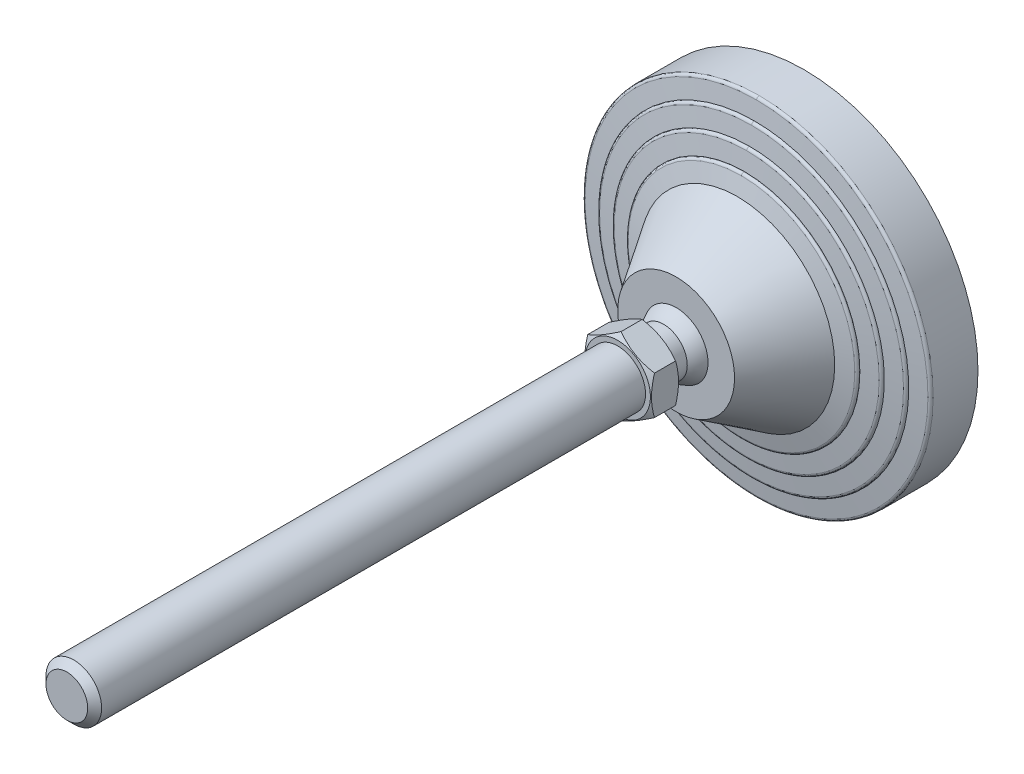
ISO-10303-21;
HEADER;
FILE_DESCRIPTION(('STEP AP214'),'2;1');
FILE_NAME('part.step','',(''),(''),'','','');
FILE_SCHEMA(('AUTOMOTIVE_DESIGN { 1 0 10303 214 1 1 1 1 }'));
ENDSEC;
DATA;
#1=APPLICATION_CONTEXT('core data for automotive mechanical design processes');
#2=APPLICATION_PROTOCOL_DEFINITION('international standard','automotive_design',2000,#1);
#3=PRODUCT_CONTEXT('',#1,'mechanical');
#4=PRODUCT('Part','Part','',(#3));
#5=PRODUCT_RELATED_PRODUCT_CATEGORY('part','',(#4));
#6=PRODUCT_DEFINITION_FORMATION('','',#4);
#7=PRODUCT_DEFINITION_CONTEXT('part definition',#1,'design');
#8=PRODUCT_DEFINITION('design','',#6,#7);
#9=PRODUCT_DEFINITION_SHAPE('','',#8);
#10=(LENGTH_UNIT() NAMED_UNIT(*) SI_UNIT(.MILLI.,.METRE.));
#11=(NAMED_UNIT(*) PLANE_ANGLE_UNIT() SI_UNIT($,.RADIAN.));
#12=(NAMED_UNIT(*) SI_UNIT($,.STERADIAN.) SOLID_ANGLE_UNIT());
#13=UNCERTAINTY_MEASURE_WITH_UNIT(LENGTH_MEASURE(1.E-05),#10,'distance_accuracy_value','');
#14=(GEOMETRIC_REPRESENTATION_CONTEXT(3) GLOBAL_UNCERTAINTY_ASSIGNED_CONTEXT((#13)) GLOBAL_UNIT_ASSIGNED_CONTEXT((#10,
#11,#12)) REPRESENTATION_CONTEXT('',''));
#15=CARTESIAN_POINT('',(0.,0.,0.));
#16=DIRECTION('',(0.,0.,1.));
#17=DIRECTION('',(1.,0.,0.));
#18=AXIS2_PLACEMENT_3D('',#15,#16,#17);
#19=CARTESIAN_POINT('',(-55.851524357,55.66,-1.55019120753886E-13));
#20=DIRECTION('',(0.,0.,1.));
#21=DIRECTION('',(0.,-1.,0.));
#22=AXIS2_PLACEMENT_3D('',#19,#20,#21);
#23=PLANE('',#22);
#24=CARTESIAN_POINT('',(0.,0.,0.));
#25=DIRECTION('',(0.,0.,-1.));
#26=DIRECTION('',(0.,1.,0.));
#27=AXIS2_PLACEMENT_3D('',#24,#25,#26);
#28=CIRCLE('',#27,55.);
#29=CARTESIAN_POINT('',(0.,55.,0.));
#30=VERTEX_POINT('',#29);
#31=EDGE_CURVE('E250',#30,#30,#28,.F.);
#32=ORIENTED_EDGE('',*,*,#31,.F.);
#33=EDGE_LOOP('',(#32));
#34=FACE_BOUND('',#33,.T.);
#35=ADVANCED_FACE('F14',(#34),#23,.F.);
#36=CARTESIAN_POINT('',(0.,0.,3.));
#37=DIRECTION('',(0.,0.,-1.));
#38=DIRECTION('',(0.,1.,0.));
#39=AXIS2_PLACEMENT_3D('',#36,#37,#38);
#40=CYLINDRICAL_SURFACE('',#39,55.);
#41=ORIENTED_EDGE('',*,*,#31,.T.);
#42=EDGE_LOOP('',(#41));
#43=FACE_BOUND('',#42,.T.);
#44=CARTESIAN_POINT('',(0.,0.,3.));
#45=DIRECTION('',(0.,0.,-1.));
#46=DIRECTION('',(0.,1.,0.));
#47=AXIS2_PLACEMENT_3D('',#44,#45,#46);
#48=CIRCLE('',#47,55.);
#49=CARTESIAN_POINT('',(0.,55.,3.));
#50=VERTEX_POINT('',#49);
#51=EDGE_CURVE('E248',#50,#50,#48,.T.);
#52=ORIENTED_EDGE('',*,*,#51,.T.);
#53=EDGE_LOOP('',(#52));
#54=FACE_BOUND('',#53,.T.);
#55=ADVANCED_FACE('F393',(#43,#54),#40,.T.);
#56=CARTESIAN_POINT('',(-63.467641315,63.25,2.99999999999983));
#57=DIRECTION('',(0.,0.,1.));
#58=DIRECTION('',(0.,-1.,0.));
#59=AXIS2_PLACEMENT_3D('',#56,#57,#58);
#60=PLANE('',#59);
#61=ORIENTED_EDGE('',*,*,#51,.F.);
#62=EDGE_LOOP('',(#61));
#63=FACE_BOUND('',#62,.T.);
#64=CARTESIAN_POINT('',(0.,0.,3.));
#65=DIRECTION('',(0.,0.,-1.));
#66=DIRECTION('',(0.,1.,0.));
#67=AXIS2_PLACEMENT_3D('',#64,#65,#66);
#68=CIRCLE('',#67,62.5);
#69=CARTESIAN_POINT('',(0.,62.5,3.));
#70=VERTEX_POINT('',#69);
#71=EDGE_CURVE('E244',#70,#70,#68,.F.);
#72=ORIENTED_EDGE('',*,*,#71,.F.);
#73=EDGE_LOOP('',(#72));
#74=FACE_BOUND('',#73,.T.);
#75=ADVANCED_FACE('F389',(#63,#74),#60,.F.);
#76=CARTESIAN_POINT('',(0.,0.,19.119206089));
#77=DIRECTION('',(0.,0.,-1.));
#78=DIRECTION('',(0.,1.,0.));
#79=AXIS2_PLACEMENT_3D('',#76,#77,#78);
#80=CYLINDRICAL_SURFACE('',#79,62.5);
#81=ORIENTED_EDGE('',*,*,#71,.T.);
#82=EDGE_LOOP('',(#81));
#83=FACE_BOUND('',#82,.T.);
#84=CARTESIAN_POINT('',(0.,0.,19.119206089));
#85=DIRECTION('',(0.,0.,1.));
#86=DIRECTION('',(0.,-1.,0.));
#87=AXIS2_PLACEMENT_3D('',#84,#85,#86);
#88=CIRCLE('',#87,62.5);
#89=CARTESIAN_POINT('',(-6.40953520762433E-09,-62.5,19.119206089));
#90=VERTEX_POINT('',#89);
#91=CARTESIAN_POINT('',(0.,62.5,19.119206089));
#92=VERTEX_POINT('',#91);
#93=EDGE_CURVE('E531',#90,#92,#88,.T.);
#94=ORIENTED_EDGE('',*,*,#93,.F.);
#95=CARTESIAN_POINT('',(0.,0.,19.119206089));
#96=DIRECTION('',(0.,0.,1.));
#97=DIRECTION('',(0.,-1.,0.));
#98=AXIS2_PLACEMENT_3D('',#95,#96,#97);
#99=CIRCLE('',#98,62.5);
#100=EDGE_CURVE('E247',#92,#90,#99,.T.);
#101=ORIENTED_EDGE('',*,*,#100,.F.);
#102=EDGE_LOOP('',(#94,#101));
#103=FACE_BOUND('',#102,.T.);
#104=ADVANCED_FACE('F392',(#83,#103),#80,.T.);
#105=CARTESIAN_POINT('',(0.,-62.5,19.119206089));
#106=CARTESIAN_POINT('',(-125.,-62.5,19.1192060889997));
#107=CARTESIAN_POINT('',(-125.,62.5,19.1192060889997));
#108=CARTESIAN_POINT('',(0.,62.5,19.119206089));
#109=CARTESIAN_POINT('',(0.,-62.5,19.647800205));
#110=CARTESIAN_POINT('',(-125.,-62.5,19.6478002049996));
#111=CARTESIAN_POINT('',(-125.,62.5,19.6478002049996));
#112=CARTESIAN_POINT('',(0.,62.5,19.647800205));
#113=CARTESIAN_POINT('',(0.,-62.1506185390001,20.044466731));
#114=CARTESIAN_POINT('',(-124.301237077,-62.150618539,20.0444667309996));
#115=CARTESIAN_POINT('',(-124.301237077,62.150618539,20.0444667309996));
#116=CARTESIAN_POINT('',(0.,62.1506185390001,20.044466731));
#117=CARTESIAN_POINT('',(0.,-61.62625428,20.111204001));
#118=CARTESIAN_POINT('',(-123.252508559,-61.6262542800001,20.1112040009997));
#119=CARTESIAN_POINT('',(-123.252508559,61.6262542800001,20.1112040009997));
#120=CARTESIAN_POINT('',(0.,61.62625428,20.111204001));
#121=(BOUNDED_SURFACE() B_SPLINE_SURFACE(3,3,((#105,#106,#107,#108),(#109,#110,#111,#112),(#113,
#114,#115,#116),(#117,#118,#119,#120)),.UNSPECIFIED.,.F.,.F.,
.F.) B_SPLINE_SURFACE_WITH_KNOTS((4,4),(4,4),(0.,1.),(0.,1.),
.UNSPECIFIED.) GEOMETRIC_REPRESENTATION_ITEM() RATIONAL_B_SPLINE_SURFACE(((1.,0.333333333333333,
0.333333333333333,1.),(0.833611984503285,0.277870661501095,0.277870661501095,0.833611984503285),
(0.833611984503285,0.277870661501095,0.277870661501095,0.833611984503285),(1.,0.333333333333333,
0.333333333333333,1.))) REPRESENTATION_ITEM('') SURFACE());
#122=CARTESIAN_POINT('',(0.,62.5,19.119206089));
#123=CARTESIAN_POINT('',(0.,62.5,19.647800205));
#124=CARTESIAN_POINT('',(0.,62.1506185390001,20.044466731));
#125=CARTESIAN_POINT('',(0.,61.62625428,20.111204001));
#126=(BOUNDED_CURVE() B_SPLINE_CURVE(3,(#122,#123,#124,#125),.UNSPECIFIED.,.F.,
.F.) B_SPLINE_CURVE_WITH_KNOTS((4,4),(0.,1.),
.UNSPECIFIED.) CURVE() GEOMETRIC_REPRESENTATION_ITEM() RATIONAL_B_SPLINE_CURVE((1.,
0.833611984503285,0.833611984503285,1.)) REPRESENTATION_ITEM(''));
#127=CARTESIAN_POINT('',(0.,61.6262542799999,20.1112040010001));
#128=VERTEX_POINT('',#127);
#129=EDGE_CURVE('E522',#92,#128,#126,.T.);
#130=CARTESIAN_POINT('',(0.,-62.5,19.119206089));
#131=CARTESIAN_POINT('',(0.,-62.5,19.647800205));
#132=CARTESIAN_POINT('',(0.,-62.1506185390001,20.044466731));
#133=CARTESIAN_POINT('',(0.,-61.62625428,20.111204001));
#134=(BOUNDED_CURVE() B_SPLINE_CURVE(3,(#130,#131,#132,#133),.UNSPECIFIED.,.F.,
.F.) B_SPLINE_CURVE_WITH_KNOTS((4,4),(0.,1.),
.UNSPECIFIED.) CURVE() GEOMETRIC_REPRESENTATION_ITEM() RATIONAL_B_SPLINE_CURVE((1.,
0.833611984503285,0.833611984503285,1.)) REPRESENTATION_ITEM(''));
#135=CARTESIAN_POINT('',(-1.89596898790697E-08,-61.6262542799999,20.1112040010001));
#136=VERTEX_POINT('',#135);
#137=EDGE_CURVE('E536',#136,#90,#134,.F.);
#138=CARTESIAN_POINT('',(0.,0.,20.1112040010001));
#139=DIRECTION('',(0.,0.,-1.));
#140=DIRECTION('',(0.,1.,0.));
#141=AXIS2_PLACEMENT_3D('',#138,#139,#140);
#142=CIRCLE('',#141,61.62625428);
#143=EDGE_CURVE('E515',#128,#136,#142,.F.);
#144=ORIENTED_EDGE('',*,*,#129,.F.);
#145=ORIENTED_EDGE('',*,*,#100,.T.);
#146=ORIENTED_EDGE('',*,*,#137,.F.);
#147=ORIENTED_EDGE('',*,*,#143,.F.);
#148=EDGE_LOOP('',(#144,#145,#146,#147));
#149=FACE_BOUND('',#148,.T.);
#150=ADVANCED_FACE('F716',(#149),#121,.T.);
#151=CARTESIAN_POINT('',(0.,62.5,19.119206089));
#152=CARTESIAN_POINT('',(125.,62.5,19.1192060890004));
#153=CARTESIAN_POINT('',(125.,-62.5,19.1192060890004));
#154=CARTESIAN_POINT('',(0.,-62.5,19.119206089));
#155=CARTESIAN_POINT('',(0.,62.5,19.647800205));
#156=CARTESIAN_POINT('',(125.,62.5,19.6478002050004));
#157=CARTESIAN_POINT('',(125.,-62.5,19.6478002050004));
#158=CARTESIAN_POINT('',(0.,-62.5,19.647800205));
#159=CARTESIAN_POINT('',(0.,62.1506185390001,20.044466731));
#160=CARTESIAN_POINT('',(124.301237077,62.150618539,20.0444667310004));
#161=CARTESIAN_POINT('',(124.301237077,-62.150618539,20.0444667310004));
#162=CARTESIAN_POINT('',(0.,-62.1506185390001,20.044466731));
#163=CARTESIAN_POINT('',(0.,61.62625428,20.111204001));
#164=CARTESIAN_POINT('',(123.252508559,61.6262542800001,20.1112040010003));
#165=CARTESIAN_POINT('',(123.252508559,-61.6262542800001,20.1112040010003));
#166=CARTESIAN_POINT('',(0.,-61.62625428,20.111204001));
#167=(BOUNDED_SURFACE() B_SPLINE_SURFACE(3,3,((#151,#152,#153,#154),(#155,#156,#157,#158),(#159,
#160,#161,#162),(#163,#164,#165,#166)),.UNSPECIFIED.,.F.,.F.,
.F.) B_SPLINE_SURFACE_WITH_KNOTS((4,4),(4,4),(0.,1.),(0.,1.),
.UNSPECIFIED.) GEOMETRIC_REPRESENTATION_ITEM() RATIONAL_B_SPLINE_SURFACE(((1.,0.333333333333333,
0.333333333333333,1.),(0.833611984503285,0.277870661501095,0.277870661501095,0.833611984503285),
(0.833611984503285,0.277870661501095,0.277870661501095,0.833611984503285),(1.,0.333333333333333,
0.333333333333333,1.))) REPRESENTATION_ITEM('') SURFACE());
#168=CARTESIAN_POINT('',(0.,0.,20.1112040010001));
#169=DIRECTION('',(0.,0.,-1.));
#170=DIRECTION('',(0.,1.,0.));
#171=AXIS2_PLACEMENT_3D('',#168,#169,#170);
#172=CIRCLE('',#171,61.62625428);
#173=EDGE_CURVE('E521',#136,#128,#172,.F.);
#174=ORIENTED_EDGE('',*,*,#93,.T.);
#175=ORIENTED_EDGE('',*,*,#129,.T.);
#176=ORIENTED_EDGE('',*,*,#173,.F.);
#177=ORIENTED_EDGE('',*,*,#137,.T.);
#178=EDGE_LOOP('',(#174,#175,#176,#177));
#179=FACE_BOUND('',#178,.T.);
#180=ADVANCED_FACE('F229',(#179),#167,.T.);
#181=CARTESIAN_POINT('',(0.,0.,20.890909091));
#182=DIRECTION('',(0.,0.,-1.));
#183=DIRECTION('',(1.,0.,0.));
#184=AXIS2_PLACEMENT_3D('',#181,#182,#183);
#185=CONICAL_SURFACE('',#184,55.5,1.44420419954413);
#186=ORIENTED_EDGE('',*,*,#143,.T.);
#187=ORIENTED_EDGE('',*,*,#173,.T.);
#188=EDGE_LOOP('',(#186,#187));
#189=FACE_BOUND('',#188,.T.);
#190=CARTESIAN_POINT('',(-1.13831537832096E-08,-55.5,20.890909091));
#191=CARTESIAN_POINT('',(0.666810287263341,-55.5000058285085,20.890909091));
#192=CARTESIAN_POINT('',(1.3336215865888,-55.4879831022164,20.890909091));
#193=CARTESIAN_POINT('',(2.66828219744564,-55.4398527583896,20.890909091));
#194=CARTESIAN_POINT('',(3.33612903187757,-55.4036764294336,20.890909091));
#195=CARTESIAN_POINT('',(4.67008368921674,-55.3072108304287,20.890909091));
#196=CARTESIAN_POINT('',(5.33619149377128,-55.2469213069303,20.890909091));
#197=CARTESIAN_POINT('',(6.66630694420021,-55.1022519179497,20.890909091));
#198=CARTESIAN_POINT('',(7.33031261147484,-55.0178537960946,20.890909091));
#199=CARTESIAN_POINT('',(8.65488946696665,-54.8250946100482,20.890909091));
#200=CARTESIAN_POINT('',(9.31546019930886,-54.7167304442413,20.890909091));
#201=CARTESIAN_POINT('',(11.3032442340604,-54.3535835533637,20.8909090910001));
#202=CARTESIAN_POINT('',(12.6239565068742,-54.0621103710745,20.890909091));
#203=CARTESIAN_POINT('',(15.2407929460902,-53.383483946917,20.890909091));
#204=CARTESIAN_POINT('',(16.5369104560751,-52.9963051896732,20.890909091));
#205=CARTESIAN_POINT('',(19.0989356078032,-52.1278427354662,20.8909090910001));
#206=CARTESIAN_POINT('',(20.3648068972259,-51.6464516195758,20.8909090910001));
#207=CARTESIAN_POINT('',(22.8579438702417,-50.5924539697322,20.8909090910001));
#208=CARTESIAN_POINT('',(24.0852091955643,-50.0198465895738,20.890909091));
#209=CARTESIAN_POINT('',(26.6786676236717,-48.6922162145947,20.8909090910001));
#210=CARTESIAN_POINT('',(28.0374663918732,-47.9226902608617,20.8909090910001));
#211=CARTESIAN_POINT('',(30.6855194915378,-46.2718474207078,20.8909090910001));
#212=CARTESIAN_POINT('',(31.9747656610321,-45.3905174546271,20.8909090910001));
#213=CARTESIAN_POINT('',(34.4745529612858,-43.5222940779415,20.8909090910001));
#214=CARTESIAN_POINT('',(35.6850872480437,-42.5353915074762,20.8909090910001));
#215=CARTESIAN_POINT('',(38.0186685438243,-40.4631409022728,20.8909090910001));
#216=CARTESIAN_POINT('',(39.1417181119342,-39.3777957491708,20.8909090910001));
#217=CARTESIAN_POINT('',(41.2923479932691,-37.1163936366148,20.8909090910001));
#218=CARTESIAN_POINT('',(42.3199319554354,-35.9403401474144,20.8909090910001));
#219=CARTESIAN_POINT('',(44.2723789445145,-33.505838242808,20.8909090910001));
#220=CARTESIAN_POINT('',(45.1972412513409,-32.2473892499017,20.8909090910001));
#221=CARTESIAN_POINT('',(46.9376312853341,-29.6570957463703,20.8909090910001));
#222=CARTESIAN_POINT('',(47.7531628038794,-28.3252537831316,20.8909090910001));
#223=CARTESIAN_POINT('',(49.2691299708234,-25.5976050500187,20.8909090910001));
#224=CARTESIAN_POINT('',(49.9695658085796,-24.2017983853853,20.8909090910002));
#225=CARTESIAN_POINT('',(51.2503706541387,-21.3561258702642,20.8909090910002));
#226=CARTESIAN_POINT('',(51.8307383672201,-19.9062594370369,20.8909090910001));
#227=CARTESIAN_POINT('',(52.8672716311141,-16.9627885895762,20.8909090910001));
#228=CARTESIAN_POINT('',(53.323437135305,-15.469184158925,20.8909090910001));
#229=CARTESIAN_POINT('',(54.1083272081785,-12.4488388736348,20.8909090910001));
#230=CARTESIAN_POINT('',(54.4370503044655,-10.9220976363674,20.8909090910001));
#231=CARTESIAN_POINT('',(54.9647110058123,-7.84634988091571,20.8909090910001));
#232=CARTESIAN_POINT('',(55.1636486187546,-6.2973433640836,20.8909090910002));
#233=CARTESIAN_POINT('',(55.4303245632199,-3.18807153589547,20.8909090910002));
#234=CARTESIAN_POINT('',(55.4980623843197,-1.62780618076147,20.8909090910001));
#235=CARTESIAN_POINT('',(55.5018556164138,1.49288460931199,20.8909090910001));
#236=CARTESIAN_POINT('',(55.4379110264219,3.05331004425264,20.8909090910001));
#237=CARTESIAN_POINT('',(55.1787965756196,6.16319684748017,20.8909090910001));
#238=CARTESIAN_POINT('',(54.9836292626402,7.71265842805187,20.8909090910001));
#239=CARTESIAN_POINT('',(54.4634594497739,10.7896325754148,20.8909090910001));
#240=CARTESIAN_POINT('',(54.1384569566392,12.3171451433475,20.8909090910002));
#241=CARTESIAN_POINT('',(53.3609336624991,15.3393372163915,20.8909090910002));
#242=CARTESIAN_POINT('',(52.908414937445,16.8340172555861,20.8909090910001));
#243=CARTESIAN_POINT('',(51.8790738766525,19.7799443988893,20.8909090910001));
#244=CARTESIAN_POINT('',(51.3022515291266,21.2311914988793,20.8909090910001));
#245=CARTESIAN_POINT('',(50.0283709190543,24.0800097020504,20.8909090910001));
#246=CARTESIAN_POINT('',(49.3313064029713,25.4775780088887,20.8909090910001));
#247=CARTESIAN_POINT('',(47.8219174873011,28.209022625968,20.8909090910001));
#248=CARTESIAN_POINT('',(47.0095931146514,29.5428989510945,20.8909090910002));
#249=CARTESIAN_POINT('',(45.2754391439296,32.1375097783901,20.8909090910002));
#250=CARTESIAN_POINT('',(44.3536065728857,33.3982422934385,20.8909090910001));
#251=CARTESIAN_POINT('',(42.4069961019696,35.8375708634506,20.8909090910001));
#252=CARTESIAN_POINT('',(41.3822180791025,37.0161668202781,20.8909090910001));
#253=CARTESIAN_POINT('',(39.2371577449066,39.2826945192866,20.8909090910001));
#254=CARTESIAN_POINT('',(38.1168855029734,40.3706357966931,20.8909090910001));
#255=CARTESIAN_POINT('',(35.7885615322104,42.4483529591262,20.8909090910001));
#256=CARTESIAN_POINT('',(34.5805102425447,43.4381293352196,20.8909090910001));
#257=CARTESIAN_POINT('',(32.5014047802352,44.9999063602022,20.8909090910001));
#258=CARTESIAN_POINT('',(31.652185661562,45.6012216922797,20.8909090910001));
#259=CARTESIAN_POINT('',(29.9212415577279,46.7552239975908,20.8909090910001));
#260=CARTESIAN_POINT('',(29.0395163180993,47.3079105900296,20.8909090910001));
#261=CARTESIAN_POINT('',(27.2463975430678,48.3628576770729,20.8909090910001));
#262=CARTESIAN_POINT('',(26.3350034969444,48.8651173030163,20.8909090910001));
#263=CARTESIAN_POINT('',(24.4853750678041,49.8176528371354,20.8909090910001));
#264=CARTESIAN_POINT('',(23.5471392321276,50.2679259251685,20.8909090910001));
#265=CARTESIAN_POINT('',(21.6468644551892,51.1150215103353,20.8909090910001));
#266=CARTESIAN_POINT('',(20.6848259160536,51.5118449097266,20.8909090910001));
#267=CARTESIAN_POINT('',(18.7400290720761,52.250772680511,20.8909090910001));
#268=CARTESIAN_POINT('',(17.7572723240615,52.5928811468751,20.8909090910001));
#269=CARTESIAN_POINT('',(15.8636176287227,53.1929617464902,20.890909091));
#270=CARTESIAN_POINT('',(14.9542390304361,53.4557406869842,20.890909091));
#271=CARTESIAN_POINT('',(13.1232854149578,53.9344479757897,20.890909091));
#272=CARTESIAN_POINT('',(12.201711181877,54.1503793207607,20.890909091));
#273=CARTESIAN_POINT('',(10.3487557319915,54.5348378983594,20.890909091));
#274=CARTESIAN_POINT('',(9.41737477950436,54.7033664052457,20.890909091));
#275=CARTESIAN_POINT('',(7.54728204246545,54.9925789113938,20.890909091));
#276=CARTESIAN_POINT('',(6.60857079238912,55.1132663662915,20.890909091));
#277=CARTESIAN_POINT('',(4.72616569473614,55.3064952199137,20.890909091));
#278=CARTESIAN_POINT('',(3.78247163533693,55.3790345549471,20.890909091));
#279=CARTESIAN_POINT('',(1.89251924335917,55.4758006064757,20.890909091));
#280=CARTESIAN_POINT('',(0.946260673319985,55.5000226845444,20.890909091));
#281=CARTESIAN_POINT('',(-1.66122530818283E-09,55.5,20.890909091));
#282=B_SPLINE_CURVE_WITH_KNOTS('',3,(#190,#191,#192,#193,#194,#195,#196,#197,#198,#199,#200,
#201,#202,#203,#204,#205,#206,#207,#208,#209,#210,#211,#212,#213,#214,#215,#216,#217,#218,#219,
#220,#221,#222,#223,#224,#225,#226,#227,#228,#229,#230,#231,#232,#233,#234,#235,#236,#237,#238,
#239,#240,#241,#242,#243,#244,#245,#246,#247,#248,#249,#250,#251,#252,#253,#254,#255,#256,#257,
#258,#259,#260,#261,#262,#263,#264,#265,#266,#267,#268,#269,#270,#271,#272,#273,#274,#275,#276,
#277,#278,#279,#280,#281),.UNSPECIFIED.,.F.,.F.,(4,2,2,2,2,2,2,2,2,2,2,2,2,2,2,2,2,2,2,2,2,2,2,
2,2,2,2,2,2,2,2,2,2,2,2,2,2,2,2,2,2,2,2,2,2,4),(0.,2.00032482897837,4.00636450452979,
6.01242526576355,8.02000917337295,10.0278530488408,14.0813911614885,18.1360111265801,
22.1952813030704,26.2545891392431,30.9336173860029,35.6131935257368,40.2931760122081,
44.9730215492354,49.6526881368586,54.3323875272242,59.0119245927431,63.691453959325,
68.3710337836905,73.0506153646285,77.7302510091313,82.4098863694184,87.0895399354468,
91.7691935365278,96.4487562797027,101.128318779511,105.80780510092,110.487291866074,
115.167022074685,119.846751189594,124.526607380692,129.206469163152,133.885838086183,
138.565183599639,141.685351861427,144.805544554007,147.925790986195,151.046206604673,
154.16656954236,157.286698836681,160.12523673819,162.963593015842,165.801872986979,
168.639947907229,171.478144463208,174.316613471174),.UNSPECIFIED.);
#283=CARTESIAN_POINT('',(-1.13832971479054E-08,-55.5,20.895966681));
#284=VERTEX_POINT('',#283);
#285=CARTESIAN_POINT('',(-1.66124125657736E-09,55.5,20.895966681));
#286=VERTEX_POINT('',#285);
#287=EDGE_CURVE('E210',#284,#286,#282,.T.);
#288=ORIENTED_EDGE('',*,*,#287,.F.);
#289=CARTESIAN_POINT('',(-1.66123784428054E-09,55.5,20.890909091));
#290=CARTESIAN_POINT('',(-0.6668103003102,55.5000058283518,20.890909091));
#291=CARTESIAN_POINT('',(-1.3336215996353,55.4879831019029,20.890909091));
#292=CARTESIAN_POINT('',(-2.66828221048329,55.4398527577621,20.890909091));
#293=CARTESIAN_POINT('',(-3.3361290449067,55.403676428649,20.890909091));
#294=CARTESIAN_POINT('',(-4.67008370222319,55.3072108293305,20.890909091));
#295=CARTESIAN_POINT('',(-5.33619150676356,55.2469213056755,20.890909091));
#296=CARTESIAN_POINT('',(-6.66630695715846,55.1022519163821,20.890909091));
#297=CARTESIAN_POINT('',(-7.33031262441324,55.0178537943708,20.890909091));
#298=CARTESIAN_POINT('',(-8.65488947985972,54.8250946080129,20.890909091));
#299=CARTESIAN_POINT('',(-9.31546021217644,54.7167304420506,20.890909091));
#300=CARTESIAN_POINT('',(-11.3032442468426,54.3535835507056,20.8909090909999));
#301=CARTESIAN_POINT('',(-12.6239565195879,54.0621103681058,20.890909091));
#302=CARTESIAN_POINT('',(-15.2407929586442,53.3834839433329,20.890909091));
#303=CARTESIAN_POINT('',(-16.5369104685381,52.9963051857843,20.890909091));
#304=CARTESIAN_POINT('',(-19.098935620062,52.1278427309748,20.8909090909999));
#305=CARTESIAN_POINT('',(-20.3648069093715,51.6464516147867,20.8909090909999));
#306=CARTESIAN_POINT('',(-22.8579438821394,50.5924539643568,20.8909090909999));
#307=CARTESIAN_POINT('',(-24.0852092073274,50.0198465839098,20.890909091));
#308=CARTESIAN_POINT('',(-26.6786676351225,48.6922162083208,20.890909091));
#309=CARTESIAN_POINT('',(-28.037466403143,47.9226902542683,20.8909090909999));
#310=CARTESIAN_POINT('',(-30.6855195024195,46.2718474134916,20.8909090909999));
#311=CARTESIAN_POINT('',(-31.9747656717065,45.3905174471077,20.8909090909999));
#312=CARTESIAN_POINT('',(-34.4745529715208,43.5222940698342,20.8909090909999));
#313=CARTESIAN_POINT('',(-35.6850872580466,42.5353914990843,20.8909090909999));
#314=CARTESIAN_POINT('',(-38.0186685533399,40.4631408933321,20.8909090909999));
#315=CARTESIAN_POINT('',(-39.1417181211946,39.377795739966,20.8909090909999));
#316=CARTESIAN_POINT('',(-41.2923480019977,37.1163936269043,20.8909090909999));
#317=CARTESIAN_POINT('',(-42.3199319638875,35.9403401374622,20.8909090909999));
#318=CARTESIAN_POINT('',(-44.2723789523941,33.5058382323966,20.8909090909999));
#319=CARTESIAN_POINT('',(-45.1972412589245,32.2473892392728,20.8909090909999));
#320=CARTESIAN_POINT('',(-46.9376312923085,29.6570957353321,20.8909090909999));
#321=CARTESIAN_POINT('',(-47.7531628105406,28.3252537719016,20.8909090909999));
#322=CARTESIAN_POINT('',(-49.2691299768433,25.5976050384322,20.8909090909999));
#323=CARTESIAN_POINT('',(-49.9695658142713,24.2017983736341,20.8909090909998));
#324=CARTESIAN_POINT('',(-51.2503706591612,21.3561258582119,20.8909090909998));
#325=CARTESIAN_POINT('',(-51.8307383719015,19.9062594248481,20.8909090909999));
#326=CARTESIAN_POINT('',(-52.8672716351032,16.9627885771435,20.8909090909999));
#327=CARTESIAN_POINT('',(-53.3234371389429,15.4691841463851,20.8909090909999));
#328=CARTESIAN_POINT('',(-54.1083272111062,12.4488388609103,20.8909090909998));
#329=CARTESIAN_POINT('',(-54.437050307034,10.9220976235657,20.8909090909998));
#330=CARTESIAN_POINT('',(-54.9647110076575,7.84634986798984,20.8909090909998));
#331=CARTESIAN_POINT('',(-55.1636486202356,6.29734335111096,20.8909090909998));
#332=CARTESIAN_POINT('',(-55.4303245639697,3.18807152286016,20.8909090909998));
#333=CARTESIAN_POINT('',(-55.4980623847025,1.62780616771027,20.8909090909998));
#334=CARTESIAN_POINT('',(-55.5018556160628,-1.49288462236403,20.8909090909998));
#335=CARTESIAN_POINT('',(-55.4379110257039,-3.05331005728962,20.8909090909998));
#336=CARTESIAN_POINT('',(-55.1787965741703,-6.16319686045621,20.8909090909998));
#337=CARTESIAN_POINT('',(-54.9836292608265,-7.71265844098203,20.8909090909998));
#338=CARTESIAN_POINT('',(-54.4634594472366,-10.7896325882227,20.8909090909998));
#339=CARTESIAN_POINT('',(-54.1384569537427,-12.317145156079,20.8909090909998));
#340=CARTESIAN_POINT('',(-53.3609336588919,-15.3393372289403,20.8909090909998));
#341=CARTESIAN_POINT('',(-52.9084149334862,-16.8340172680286,20.8909090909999));
#342=CARTESIAN_POINT('',(-51.8790738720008,-19.77994441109,20.8909090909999));
#343=CARTESIAN_POINT('',(-51.3022515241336,-21.2311915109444,20.8909090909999));
#344=CARTESIAN_POINT('',(-50.0283709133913,-24.0800097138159,20.8909090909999));
#345=CARTESIAN_POINT('',(-49.3313063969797,-25.4775780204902,20.8909090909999));
#346=CARTESIAN_POINT('',(-47.8219174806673,-28.2090226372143,20.8909090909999));
#347=CARTESIAN_POINT('',(-47.009593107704,-29.5428989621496,20.8909090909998));
#348=CARTESIAN_POINT('',(-45.2754391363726,-32.1375097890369,20.8909090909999));
#349=CARTESIAN_POINT('',(-44.3536065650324,-33.398242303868,20.8909090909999));
#350=CARTESIAN_POINT('',(-42.4069960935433,-35.8375708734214,20.8909090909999));
#351=CARTESIAN_POINT('',(-41.3822180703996,-37.0161668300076,20.8909090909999));
#352=CARTESIAN_POINT('',(-39.2371577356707,-39.2826945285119,20.8909090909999));
#353=CARTESIAN_POINT('',(-38.1168854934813,-40.3706358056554,20.8909090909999));
#354=CARTESIAN_POINT('',(-35.7885615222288,-42.4483529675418,20.8909090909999));
#355=CARTESIAN_POINT('',(-34.58051023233,-43.4381293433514,20.8909090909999));
#356=CARTESIAN_POINT('',(-32.5014047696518,-44.9999063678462,20.8909090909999));
#357=CARTESIAN_POINT('',(-31.6521856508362,-45.6012216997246,20.8909090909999));
#358=CARTESIAN_POINT('',(-29.9212415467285,-46.75522400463,20.8909090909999));
#359=CARTESIAN_POINT('',(-29.0395163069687,-47.3079105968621,20.8909090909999));
#360=CARTESIAN_POINT('',(-27.2463975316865,-48.3628576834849,20.8909090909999));
#361=CARTESIAN_POINT('',(-26.3350034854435,-48.8651173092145,20.8909090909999));
#362=CARTESIAN_POINT('',(-24.4853750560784,-49.8176528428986,20.8909090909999));
#363=CARTESIAN_POINT('',(-23.5471392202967,-50.2679259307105,20.8909090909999));
#364=CARTESIAN_POINT('',(-21.6468644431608,-51.1150215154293,20.8909090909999));
#365=CARTESIAN_POINT('',(-20.6848259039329,-51.5118449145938,20.8909090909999));
#366=CARTESIAN_POINT('',(-18.7400290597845,-52.2507726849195,20.8909090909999));
#367=CARTESIAN_POINT('',(-17.7572723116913,-52.5928811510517,20.8909090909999));
#368=CARTESIAN_POINT('',(-15.86361761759,-53.1929617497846,20.890909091));
#369=CARTESIAN_POINT('',(-14.9542390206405,-53.455740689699,20.890909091));
#370=CARTESIAN_POINT('',(-13.1232854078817,-53.9344479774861,20.890909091));
#371=CARTESIAN_POINT('',(-12.2017111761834,-54.1503793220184,20.890909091));
#372=CARTESIAN_POINT('',(-10.3487557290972,-54.5348378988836,20.890909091));
#373=CARTESIAN_POINT('',(-9.41737477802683,-54.7033664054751,20.890909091));
#374=CARTESIAN_POINT('',(-7.54728204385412,-54.9925789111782,20.890909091));
#375=CARTESIAN_POINT('',(-6.60857079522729,-55.1132663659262,20.890909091));
#376=CARTESIAN_POINT('',(-4.72616570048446,-55.3064952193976,20.890909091));
#377=CARTESIAN_POINT('',(-3.78247164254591,-55.3790345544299,20.890909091));
#378=CARTESIAN_POINT('',(-1.892519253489,-55.4758006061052,20.890909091));
#379=CARTESIAN_POINT('',(-0.946260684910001,-55.5000226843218,20.890909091));
#380=CARTESIAN_POINT('',(-1.13832952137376E-08,-55.5,20.890909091));
#381=B_SPLINE_CURVE_WITH_KNOTS('',3,(#289,#290,#291,#292,#293,#294,#295,#296,#297,#298,#299,
#300,#301,#302,#303,#304,#305,#306,#307,#308,#309,#310,#311,#312,#313,#314,#315,#316,#317,#318,
#319,#320,#321,#322,#323,#324,#325,#326,#327,#328,#329,#330,#331,#332,#333,#334,#335,#336,#337,
#338,#339,#340,#341,#342,#343,#344,#345,#346,#347,#348,#349,#350,#351,#352,#353,#354,#355,#356,
#357,#358,#359,#360,#361,#362,#363,#364,#365,#366,#367,#368,#369,#370,#371,#372,#373,#374,#375,
#376,#377,#378,#379,#380),.UNSPECIFIED.,.F.,.F.,(4,2,2,2,2,2,2,2,2,2,2,2,2,2,2,2,2,2,2,2,2,2,2,
2,2,2,2,2,2,2,2,2,2,2,2,2,2,2,2,2,2,2,2,2,2,4),(0.,2.00032482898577,4.00636450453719,
6.01242526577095,8.02000917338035,10.0278530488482,14.0813911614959,18.1360111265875,
22.1952813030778,26.2545891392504,30.9336173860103,35.6131935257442,40.2931760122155,
44.9730215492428,49.652688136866,54.3323875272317,59.0119245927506,63.6914539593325,
68.371033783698,73.050615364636,77.7302510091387,82.4098863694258,87.0895399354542,
91.769193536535,96.44875627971,101.128318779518,105.807805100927,110.487291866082,
115.167022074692,119.846751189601,124.526607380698,129.206469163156,133.885838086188,
138.565183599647,141.685351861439,144.805544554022,147.925790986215,151.04620660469,
154.166569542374,157.286698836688,160.125236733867,162.963593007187,165.801872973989,
168.639947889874,171.47814444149,174.316613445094),.UNSPECIFIED.);
#382=EDGE_CURVE('E222',#286,#284,#381,.T.);
#383=ORIENTED_EDGE('',*,*,#382,.F.);
#384=EDGE_LOOP('',(#288,#383));
#385=FACE_BOUND('',#384,.T.);
#386=ADVANCED_FACE('F224',(#189,#385),#185,.T.);
#387=CARTESIAN_POINT('',(0.,-55.5,20.887804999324));
#388=CARTESIAN_POINT('',(-111.,-55.5000000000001,20.8878049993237));
#389=CARTESIAN_POINT('',(-111.,55.5000000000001,20.8878049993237));
#390=CARTESIAN_POINT('',(0.,55.5,20.887804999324));
#391=CARTESIAN_POINT('',(0.,-55.5,20.892211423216));
#392=CARTESIAN_POINT('',(-111.,-55.5000000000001,20.8922114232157));
#393=CARTESIAN_POINT('',(-111.,55.5000000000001,20.8922114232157));
#394=CARTESIAN_POINT('',(0.,55.5,20.892211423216));
#395=CARTESIAN_POINT('',(0.,-55.5,20.896617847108));
#396=CARTESIAN_POINT('',(-111.,-55.5000000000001,20.8966178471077));
#397=CARTESIAN_POINT('',(-111.,55.5000000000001,20.8966178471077));
#398=CARTESIAN_POINT('',(0.,55.5,20.896617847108));
#399=CARTESIAN_POINT('',(0.,-55.5,20.901024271));
#400=CARTESIAN_POINT('',(-111.,-55.5000000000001,20.9010242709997));
#401=CARTESIAN_POINT('',(-111.,55.5000000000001,20.9010242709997));
#402=CARTESIAN_POINT('',(0.,55.5,20.901024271));
#403=CARTESIAN_POINT('',(0.,-55.5,21.429618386));
#404=CARTESIAN_POINT('',(-111.,-55.4999999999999,21.4296183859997));
#405=CARTESIAN_POINT('',(-111.,55.4999999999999,21.4296183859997));
#406=CARTESIAN_POINT('',(0.,55.5,21.429618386));
#407=CARTESIAN_POINT('',(0.,-55.150618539,21.826284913));
#408=CARTESIAN_POINT('',(-110.301237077,-55.1506185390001,21.8262849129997));
#409=CARTESIAN_POINT('',(-110.301237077,55.1506185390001,21.8262849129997));
#410=CARTESIAN_POINT('',(0.,55.150618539,21.826284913));
#411=CARTESIAN_POINT('',(0.,-54.62625428,21.893022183));
#412=CARTESIAN_POINT('',(-109.252508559,-54.62625428,21.8930221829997));
#413=CARTESIAN_POINT('',(-109.252508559,54.62625428,21.8930221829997));
#414=CARTESIAN_POINT('',(0.,54.62625428,21.893022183));
#415=(BOUNDED_SURFACE() B_SPLINE_SURFACE(3,3,((#387,#388,#389,#390),(#391,#392,#393,#394),(#395,
#396,#397,#398),(#399,#400,#401,#402),(#403,#404,#405,#406),(#407,#408,#409,#410),(#411,#412,
#413,#414)),.UNSPECIFIED.,.F.,.F.,.F.) B_SPLINE_SURFACE_WITH_KNOTS((4,3,4),(4,4),(-0.01,0.,1.),
(0.,1.),.UNSPECIFIED.) GEOMETRIC_REPRESENTATION_ITEM() RATIONAL_B_SPLINE_SURFACE(((1.,
0.333333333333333,0.333333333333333,1.),(1.,0.333333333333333,0.333333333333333,1.),(1.,
0.333333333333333,0.333333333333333,1.),(1.,0.333333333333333,0.333333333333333,1.),
(0.833611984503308,0.277870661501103,0.277870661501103,0.833611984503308),(0.833611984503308,
0.277870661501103,0.277870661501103,0.833611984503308),(1.,0.333333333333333,0.333333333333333,1.))) REPRESENTATION_ITEM('') SURFACE());
#416=CARTESIAN_POINT('',(0.,55.5,20.901024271));
#417=CARTESIAN_POINT('',(0.,55.5,21.429618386));
#418=CARTESIAN_POINT('',(0.,55.150618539,21.826284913));
#419=CARTESIAN_POINT('',(0.,54.62625428,21.893022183));
#420=(BOUNDED_CURVE() B_SPLINE_CURVE(3,(#416,#417,#418,#419),.UNSPECIFIED.,.F.,
.F.) B_SPLINE_CURVE_WITH_KNOTS((4,4),(0.,1.),
.UNSPECIFIED.) CURVE() GEOMETRIC_REPRESENTATION_ITEM() RATIONAL_B_SPLINE_CURVE((1.,
0.833611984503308,0.833611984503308,1.)) REPRESENTATION_ITEM(''));
#421=CARTESIAN_POINT('',(0.,54.6262542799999,21.893022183));
#422=VERTEX_POINT('',#421);
#423=EDGE_CURVE('E213',#286,#422,#420,.T.);
#424=CARTESIAN_POINT('',(0.,-55.5,20.901024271));
#425=CARTESIAN_POINT('',(0.,-55.5,21.429618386));
#426=CARTESIAN_POINT('',(0.,-55.150618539,21.826284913));
#427=CARTESIAN_POINT('',(0.,-54.62625428,21.893022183));
#428=(BOUNDED_CURVE() B_SPLINE_CURVE(3,(#424,#425,#426,#427),.UNSPECIFIED.,.F.,
.F.) B_SPLINE_CURVE_WITH_KNOTS((4,4),(0.,1.),
.UNSPECIFIED.) CURVE() GEOMETRIC_REPRESENTATION_ITEM() RATIONAL_B_SPLINE_CURVE((1.,
0.833611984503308,0.833611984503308,1.)) REPRESENTATION_ITEM(''));
#429=CARTESIAN_POINT('',(-1.68061088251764E-08,-54.6262542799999,21.893022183));
#430=VERTEX_POINT('',#429);
#431=EDGE_CURVE('E214',#430,#284,#428,.F.);
#432=CARTESIAN_POINT('',(0.,0.,21.893022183));
#433=DIRECTION('',(0.,0.,-1.));
#434=DIRECTION('',(0.,1.,0.));
#435=AXIS2_PLACEMENT_3D('',#432,#433,#434);
#436=CIRCLE('',#435,54.62625428);
#437=EDGE_CURVE('E487',#422,#430,#436,.F.);
#438=ORIENTED_EDGE('',*,*,#423,.F.);
#439=ORIENTED_EDGE('',*,*,#382,.T.);
#440=ORIENTED_EDGE('',*,*,#431,.F.);
#441=ORIENTED_EDGE('',*,*,#437,.F.);
#442=EDGE_LOOP('',(#438,#439,#440,#441));
#443=FACE_BOUND('',#442,.T.);
#444=ADVANCED_FACE('F228',(#443),#415,.T.);
#445=CARTESIAN_POINT('',(0.,55.5,20.887804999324));
#446=CARTESIAN_POINT('',(111.,55.5000000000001,20.8878049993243));
#447=CARTESIAN_POINT('',(111.,-55.5000000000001,20.8878049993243));
#448=CARTESIAN_POINT('',(0.,-55.5,20.887804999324));
#449=CARTESIAN_POINT('',(0.,55.5,20.892211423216));
#450=CARTESIAN_POINT('',(111.,55.5000000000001,20.8922114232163));
#451=CARTESIAN_POINT('',(111.,-55.5000000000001,20.8922114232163));
#452=CARTESIAN_POINT('',(0.,-55.5,20.892211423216));
#453=CARTESIAN_POINT('',(0.,55.5,20.896617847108));
#454=CARTESIAN_POINT('',(111.,55.5000000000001,20.8966178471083));
#455=CARTESIAN_POINT('',(111.,-55.5000000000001,20.8966178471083));
#456=CARTESIAN_POINT('',(0.,-55.5,20.896617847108));
#457=CARTESIAN_POINT('',(0.,55.5,20.901024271));
#458=CARTESIAN_POINT('',(111.,55.5000000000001,20.9010242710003));
#459=CARTESIAN_POINT('',(111.,-55.5000000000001,20.9010242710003));
#460=CARTESIAN_POINT('',(0.,-55.5,20.901024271));
#461=CARTESIAN_POINT('',(0.,55.5,21.429618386));
#462=CARTESIAN_POINT('',(111.,55.4999999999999,21.4296183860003));
#463=CARTESIAN_POINT('',(111.,-55.4999999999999,21.4296183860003));
#464=CARTESIAN_POINT('',(0.,-55.5,21.429618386));
#465=CARTESIAN_POINT('',(0.,55.150618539,21.826284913));
#466=CARTESIAN_POINT('',(110.301237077,55.1506185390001,21.8262849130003));
#467=CARTESIAN_POINT('',(110.301237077,-55.1506185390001,21.8262849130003));
#468=CARTESIAN_POINT('',(0.,-55.150618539,21.826284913));
#469=CARTESIAN_POINT('',(0.,54.62625428,21.893022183));
#470=CARTESIAN_POINT('',(109.252508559,54.62625428,21.8930221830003));
#471=CARTESIAN_POINT('',(109.252508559,-54.62625428,21.8930221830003));
#472=CARTESIAN_POINT('',(0.,-54.62625428,21.893022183));
#473=(BOUNDED_SURFACE() B_SPLINE_SURFACE(3,3,((#445,#446,#447,#448),(#449,#450,#451,#452),(#453,
#454,#455,#456),(#457,#458,#459,#460),(#461,#462,#463,#464),(#465,#466,#467,#468),(#469,#470,
#471,#472)),.UNSPECIFIED.,.F.,.F.,.F.) B_SPLINE_SURFACE_WITH_KNOTS((4,3,4),(4,4),(-0.01,0.,1.),
(0.,1.),.UNSPECIFIED.) GEOMETRIC_REPRESENTATION_ITEM() RATIONAL_B_SPLINE_SURFACE(((1.,
0.333333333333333,0.333333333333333,1.),(1.,0.333333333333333,0.333333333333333,1.),(1.,
0.333333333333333,0.333333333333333,1.),(1.,0.333333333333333,0.333333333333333,1.),
(0.833611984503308,0.277870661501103,0.277870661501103,0.833611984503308),(0.833611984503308,
0.277870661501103,0.277870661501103,0.833611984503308),(1.,0.333333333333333,0.333333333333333,1.))) REPRESENTATION_ITEM('') SURFACE());
#474=CARTESIAN_POINT('',(0.,0.,21.893022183));
#475=DIRECTION('',(0.,0.,-1.));
#476=DIRECTION('',(0.,1.,0.));
#477=AXIS2_PLACEMENT_3D('',#474,#475,#476);
#478=CIRCLE('',#477,54.62625428);
#479=EDGE_CURVE('E493',#430,#422,#478,.F.);
#480=ORIENTED_EDGE('',*,*,#287,.T.);
#481=ORIENTED_EDGE('',*,*,#423,.T.);
#482=ORIENTED_EDGE('',*,*,#479,.F.);
#483=ORIENTED_EDGE('',*,*,#431,.T.);
#484=EDGE_LOOP('',(#480,#481,#482,#483));
#485=FACE_BOUND('',#484,.T.);
#486=ADVANCED_FACE('F194',(#485),#473,.T.);
#487=CARTESIAN_POINT('',(0.,0.,22.672727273));
#488=DIRECTION('',(0.,0.,-1.));
#489=DIRECTION('',(0.,1.,0.));
#490=AXIS2_PLACEMENT_3D('',#487,#488,#489);
#491=CONICAL_SURFACE('',#490,48.5,1.44420419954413);
#492=ORIENTED_EDGE('',*,*,#437,.T.);
#493=ORIENTED_EDGE('',*,*,#479,.T.);
#494=EDGE_LOOP('',(#492,#493));
#495=FACE_BOUND('',#494,.T.);
#496=CARTESIAN_POINT('',(-9.94743141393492E-09,-48.5,22.672727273));
#497=CARTESIAN_POINT('',(0.333415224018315,-48.4999999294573,22.672727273));
#498=CARTESIAN_POINT('',(0.666820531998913,-48.4965617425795,22.672727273));
#499=CARTESIAN_POINT('',(1.33352786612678,-48.4828103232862,22.672727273));
#500=CARTESIAN_POINT('',(1.66682987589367,-48.4724962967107,22.672727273));
#501=CARTESIAN_POINT('',(2.66872204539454,-48.4311451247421,22.672727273));
#502=CARTESIAN_POINT('',(3.33691272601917,-48.3896987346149,22.672727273));
#503=CARTESIAN_POINT('',(4.67104276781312,-48.2791827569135,22.672727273));
#504=CARTESIAN_POINT('',(5.33698191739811,-48.2101106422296,22.672727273));
#505=CARTESIAN_POINT('',(6.66612914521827,-48.0443714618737,22.672727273));
#506=CARTESIAN_POINT('',(7.32933372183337,-47.9476761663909,22.672727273));
#507=CARTESIAN_POINT('',(8.65121670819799,-47.7268868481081,22.672727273));
#508=CARTESIAN_POINT('',(9.30989445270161,-47.6027888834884,22.672727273));
#509=CARTESIAN_POINT('',(11.294274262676,-47.1861322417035,22.6727272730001));
#510=CARTESIAN_POINT('',(12.6113745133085,-46.8513167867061,22.672727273));
#511=CARTESIAN_POINT('',(15.2131663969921,-46.0722804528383,22.672727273));
#512=CARTESIAN_POINT('',(16.4978453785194,-45.628017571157,22.672727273));
#513=CARTESIAN_POINT('',(19.026896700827,-44.632675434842,22.6727272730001));
#514=CARTESIAN_POINT('',(20.2712210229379,-44.0814740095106,22.6727272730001));
#515=CARTESIAN_POINT('',(22.7090353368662,-42.8765478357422,22.6727272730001));
#516=CARTESIAN_POINT('',(23.9025301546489,-42.2228328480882,22.672727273));
#517=CARTESIAN_POINT('',(26.2339069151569,-40.815337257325,22.6727272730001));
#518=CARTESIAN_POINT('',(27.3716102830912,-40.0612608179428,22.6727272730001));
#519=CARTESIAN_POINT('',(29.5794657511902,-38.4599142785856,22.6727272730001));
#520=CARTESIAN_POINT('',(30.6496160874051,-37.6126417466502,22.6727272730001));
#521=CARTESIAN_POINT('',(32.7144313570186,-35.8311972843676,22.6727272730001));
#522=CARTESIAN_POINT('',(33.709117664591,-34.8970501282,22.6727272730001));
#523=CARTESIAN_POINT('',(35.6162650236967,-32.9482983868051,22.6727272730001));
#524=CARTESIAN_POINT('',(36.5287266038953,-31.9336943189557,22.6727272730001));
#525=CARTESIAN_POINT('',(38.2650470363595,-29.8311130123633,22.6727272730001));
#526=CARTESIAN_POINT('',(39.0888956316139,-28.7431273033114,22.6727272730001));
#527=CARTESIAN_POINT('',(40.642013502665,-26.5016202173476,22.6727272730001));
#528=CARTESIAN_POINT('',(41.3712826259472,-25.3480987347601,22.6727272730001));
#529=CARTESIAN_POINT('',(42.7300878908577,-22.9836659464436,22.6727272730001));
#530=CARTESIAN_POINT('',(43.3596192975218,-21.7727519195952,22.6727272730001));
#531=CARTESIAN_POINT('',(44.5144313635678,-19.3021944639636,22.6727272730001));
#532=CARTESIAN_POINT('',(45.039712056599,-18.0425510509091,22.6727272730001));
#533=CARTESIAN_POINT('',(45.9822772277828,-15.4835203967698,22.6727272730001));
#534=CARTESIAN_POINT('',(46.3995642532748,-14.1841340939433,22.6727272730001));
#535=CARTESIAN_POINT('',(47.1231916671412,-11.5548271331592,22.6727272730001));
#536=CARTESIAN_POINT('',(47.4295320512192,-10.2249064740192,22.6727272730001));
#537=CARTESIAN_POINT('',(47.9290880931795,-7.54398668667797,22.6727272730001));
#538=CARTESIAN_POINT('',(48.1223038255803,-6.19298757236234,22.6727272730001));
#539=CARTESIAN_POINT('',(48.3942372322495,-3.47951480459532,22.6727272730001));
#540=CARTESIAN_POINT('',(48.4729549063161,-2.1170411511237,22.6727272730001));
#541=CARTESIAN_POINT('',(48.5153327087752,0.609703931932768,22.6727272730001));
#542=CARTESIAN_POINT('',(48.4789920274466,1.97397537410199,22.6727272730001));
#543=CARTESIAN_POINT('',(48.2915097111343,4.69460717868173,22.6727272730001));
#544=CARTESIAN_POINT('',(48.1403680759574,6.05096754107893,22.6727272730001));
#545=CARTESIAN_POINT('',(47.7243611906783,8.74611604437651,22.6727272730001));
#546=CARTESIAN_POINT('',(47.459497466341,10.084904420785,22.6727272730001));
#547=CARTESIAN_POINT('',(46.8179296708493,12.7354096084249,22.6727272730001));
#548=CARTESIAN_POINT('',(46.4412256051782,14.0471264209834,22.6727272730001));
#549=CARTESIAN_POINT('',(45.5786575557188,16.6341561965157,22.6727272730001));
#550=CARTESIAN_POINT('',(45.0927941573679,17.9094693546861,22.6727272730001));
#551=CARTESIAN_POINT('',(44.0153602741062,20.4146329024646,22.6727272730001));
#552=CARTESIAN_POINT('',(43.423789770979,21.644483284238,22.6727272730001));
#553=CARTESIAN_POINT('',(42.1391318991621,24.0500069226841,22.6727272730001));
#554=CARTESIAN_POINT('',(41.4460420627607,25.2256788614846,22.6727272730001));
#555=CARTESIAN_POINT('',(39.9632836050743,27.5144547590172,22.6727272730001));
#556=CARTESIAN_POINT('',(39.1736150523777,28.6275587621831,22.6727272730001));
#557=CARTESIAN_POINT('',(37.5033313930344,30.7832641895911,22.6727272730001));
#558=CARTESIAN_POINT('',(36.6227180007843,31.8258669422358,22.6727272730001));
#559=CARTESIAN_POINT('',(34.7767800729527,33.8331893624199,22.6727272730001));
#560=CARTESIAN_POINT('',(33.8114552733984,34.7979087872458,22.6727272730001));
#561=CARTESIAN_POINT('',(31.8029804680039,36.6425966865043,22.6727272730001));
#562=CARTESIAN_POINT('',(30.7598292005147,37.5225637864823,22.6727272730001));
#563=CARTESIAN_POINT('',(28.603007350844,39.1915394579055,22.6727272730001));
#564=CARTESIAN_POINT('',(27.4893376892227,39.980549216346,22.672727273));
#565=CARTESIAN_POINT('',(25.581215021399,41.2150302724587,22.6727272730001));
#566=CARTESIAN_POINT('',(24.8040020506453,41.6873877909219,22.6727272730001));
#567=CARTESIAN_POINT('',(23.2241951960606,42.587710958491,22.6727272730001));
#568=CARTESIAN_POINT('',(22.4216008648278,43.0156758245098,22.6727272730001));
#569=CARTESIAN_POINT('',(20.7935946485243,43.8258285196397,22.6727272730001));
#570=CARTESIAN_POINT('',(19.9681815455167,44.2080138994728,22.672727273));
#571=CARTESIAN_POINT('',(18.2974514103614,44.9252645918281,22.672727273));
#572=CARTESIAN_POINT('',(17.4521411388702,45.2603456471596,22.672727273));
#573=CARTESIAN_POINT('',(15.7440847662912,45.8824576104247,22.672727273));
#574=CARTESIAN_POINT('',(14.8813396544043,46.1694912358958,22.672727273));
#575=CARTESIAN_POINT('',(13.1412443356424,46.6945749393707,22.672727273));
#576=CARTESIAN_POINT('',(12.2638974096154,46.9326358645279,22.6727272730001));
#577=CARTESIAN_POINT('',(10.7597151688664,47.2957357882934,22.672727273));
#578=CARTESIAN_POINT('',(10.1358813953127,47.433341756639,22.672727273));
#579=CARTESIAN_POINT('',(8.883358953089,47.6837886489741,22.672727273));
#580=CARTESIAN_POINT('',(8.25467114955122,47.7966338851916,22.672727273));
#581=CARTESIAN_POINT('',(6.99338768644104,47.9973988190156,22.672727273));
#582=CARTESIAN_POINT('',(6.3607923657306,48.0853206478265,22.672727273));
#583=CARTESIAN_POINT('',(5.0934554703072,48.2360176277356,22.672727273));
#584=CARTESIAN_POINT('',(4.45871780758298,48.2988256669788,22.672727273));
#585=CARTESIAN_POINT('',(3.18720376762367,48.3993639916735,22.672727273));
#586=CARTESIAN_POINT('',(2.55042721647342,48.4370920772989,22.672727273));
#587=CARTESIAN_POINT('',(1.27576743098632,48.4874158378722,22.672727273));
#588=CARTESIAN_POINT('',(0.637884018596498,48.5000070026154,22.672727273));
#589=CARTESIAN_POINT('',(-1.45170500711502E-09,48.5,22.672727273));
#590=B_SPLINE_CURVE_WITH_KNOTS('',3,(#496,#497,#498,#499,#500,#501,#502,#503,#504,#505,#506,
#507,#508,#509,#510,#511,#512,#513,#514,#515,#516,#517,#518,#519,#520,#521,#522,#523,#524,#525,
#526,#527,#528,#529,#530,#531,#532,#533,#534,#535,#536,#537,#538,#539,#540,#541,#542,#543,#544,
#545,#546,#547,#548,#549,#550,#551,#552,#553,#554,#555,#556,#557,#558,#559,#560,#561,#562,#563,
#564,#565,#566,#567,#568,#569,#570,#571,#572,#573,#574,#575,#576,#577,#578,#579,#580,#581,#582,
#583,#584,#585,#586,#587,#588,#589),.UNSPECIFIED.,.F.,.F.,(4,2,2,2,2,2,2,2,2,2,2,2,2,2,2,2,2,2,
2,2,2,2,2,2,2,2,2,2,2,2,2,2,2,2,2,2,2,2,2,2,2,2,2,2,2,2,4),(0.,1.00020813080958,
2.00053180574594,4.0083304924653,6.0163128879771,8.02635474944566,10.0366859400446,
14.108425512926,18.1817301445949,22.2597159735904,26.3373137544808,30.4272089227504,
34.5172108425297,38.6060499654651,42.6948627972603,46.7841484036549,50.8734406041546,
54.9629268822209,59.0524118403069,63.1418003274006,67.2311889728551,71.3205749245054,
75.409960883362,79.4993756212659,83.5887903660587,87.678150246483,91.7675099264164,
95.8568476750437,99.9461861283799,104.035624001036,108.125058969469,112.214416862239,
116.303787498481,120.393224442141,124.482608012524,127.209786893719,129.93701387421,
132.664386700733,135.390845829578,138.117150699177,140.842851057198,142.758881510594,
144.67457801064,146.590110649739,148.503126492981,150.416310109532,152.329836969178),.UNSPECIFIED.);
#591=CARTESIAN_POINT('',(-9.94757204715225E-09,-48.5,22.677784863));
#592=VERTEX_POINT('',#591);
#593=CARTESIAN_POINT('',(-1.4517266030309E-09,48.5,22.677784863));
#594=VERTEX_POINT('',#593);
#595=EDGE_CURVE('E168',#592,#594,#590,.T.);
#596=ORIENTED_EDGE('',*,*,#595,.F.);
#597=CARTESIAN_POINT('',(-1.45172460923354E-09,48.5,22.672727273));
#598=CARTESIAN_POINT('',(-0.333415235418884,48.4999999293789,22.672727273));
#599=CARTESIAN_POINT('',(-0.666820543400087,48.4965617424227,22.672727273));
#600=CARTESIAN_POINT('',(-1.33352787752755,48.4828103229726,22.672727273));
#601=CARTESIAN_POINT('',(-1.66682988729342,48.4724962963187,22.672727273));
#602=CARTESIAN_POINT('',(-2.66872205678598,48.4311451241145,22.672727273));
#603=CARTESIAN_POINT('',(-3.33691273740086,48.3896987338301,22.672727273));
#604=CARTESIAN_POINT('',(-4.67104277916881,48.2791827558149,22.672727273));
#605=CARTESIAN_POINT('',(-5.33698192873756,48.2101106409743,22.672727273));
#606=CARTESIAN_POINT('',(-6.66612915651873,48.0443714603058,22.672727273));
#607=CARTESIAN_POINT('',(-7.32933373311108,47.947676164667,22.672727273));
#608=CARTESIAN_POINT('',(-8.65121671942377,47.7268868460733,22.672727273));
#609=CARTESIAN_POINT('',(-9.3098944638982,47.6027888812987,22.672727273));
#610=CARTESIAN_POINT('',(-11.2942742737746,47.1861322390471,22.6727272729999));
#611=CARTESIAN_POINT('',(-12.6113745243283,46.8513167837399,22.672727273));
#612=CARTESIAN_POINT('',(-15.2131664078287,46.0722804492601,22.672727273));
#613=CARTESIAN_POINT('',(-16.4978453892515,45.6280175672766,22.672727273));
#614=CARTESIAN_POINT('',(-19.026896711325,44.6326754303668,22.6727272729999));
#615=CARTESIAN_POINT('',(-20.2712210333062,44.0814740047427,22.6727272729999));
#616=CARTESIAN_POINT('',(-22.7090353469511,42.8765478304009,22.6727272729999));
#617=CARTESIAN_POINT('',(-23.9025301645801,42.2228328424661,22.672727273));
#618=CARTESIAN_POINT('',(-26.2339069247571,40.8153372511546,22.6727272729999));
#619=CARTESIAN_POINT('',(-27.371610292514,40.0612608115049,22.6727272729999));
#620=CARTESIAN_POINT('',(-29.5794657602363,38.4599142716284,22.6727272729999));
#621=CARTESIAN_POINT('',(-30.6496160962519,37.6126417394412,22.6727272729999));
#622=CARTESIAN_POINT('',(-32.7144313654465,35.8311972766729,22.6727272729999));
#623=CARTESIAN_POINT('',(-33.7091176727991,34.8970501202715,22.6727272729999));
#624=CARTESIAN_POINT('',(-35.6162650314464,32.9482983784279,22.6727272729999));
#625=CARTESIAN_POINT('',(-36.5287266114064,31.9336943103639,22.6727272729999));
#626=CARTESIAN_POINT('',(-38.2650470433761,29.8311130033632,22.6727272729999));
#627=CARTESIAN_POINT('',(-39.0888956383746,28.7431272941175,22.6727272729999));
#628=CARTESIAN_POINT('',(-40.6420135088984,26.5016202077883,22.6727272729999));
#629=CARTESIAN_POINT('',(-41.3712826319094,25.3480987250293,22.6727272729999));
#630=CARTESIAN_POINT('',(-42.7300878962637,22.9836659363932,22.6727272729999));
#631=CARTESIAN_POINT('',(-43.359619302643,21.7727519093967,22.6727272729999));
#632=CARTESIAN_POINT('',(-44.514431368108,19.3021944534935,22.6727272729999));
#633=CARTESIAN_POINT('',(-45.039712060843,18.0425510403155,22.6727272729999));
#634=CARTESIAN_POINT('',(-45.9822772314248,15.4835203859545,22.6727272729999));
#635=CARTESIAN_POINT('',(-46.3995642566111,14.1841340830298,22.6727272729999));
#636=CARTESIAN_POINT('',(-47.1231916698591,11.5548271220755,22.6727272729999));
#637=CARTESIAN_POINT('',(-47.4295320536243,10.2249064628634,22.6727272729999));
#638=CARTESIAN_POINT('',(-47.929088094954,7.5439866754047,22.6727272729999));
#639=CARTESIAN_POINT('',(-48.122303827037,6.19298756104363,22.6727272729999));
#640=CARTESIAN_POINT('',(-48.394237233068,3.47951479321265,22.6727272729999));
#641=CARTESIAN_POINT('',(-48.4729549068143,2.11704113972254,22.6727272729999));
#642=CARTESIAN_POINT('',(-48.5153327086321,-0.609703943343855,22.6727272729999));
#643=CARTESIAN_POINT('',(-48.4789920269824,-1.9739753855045,22.6727272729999));
#644=CARTESIAN_POINT('',(-48.2915097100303,-4.69460719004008,22.6727272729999));
#645=CARTESIAN_POINT('',(-48.1403680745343,-6.0509675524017,22.6727272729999));
#646=CARTESIAN_POINT('',(-47.7243611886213,-8.74611605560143,22.6727272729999));
#647=CARTESIAN_POINT('',(-47.4594974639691,-10.0849044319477,22.6727272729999));
#648=CARTESIAN_POINT('',(-46.817929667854,-12.7354096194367,22.6727272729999));
#649=CARTESIAN_POINT('',(-46.4412256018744,-14.0471264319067,22.6727272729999));
#650=CARTESIAN_POINT('',(-45.5786575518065,-16.6341562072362,22.6727272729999));
#651=CARTESIAN_POINT('',(-45.0927941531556,-17.9094693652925,22.6727272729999));
#652=CARTESIAN_POINT('',(-44.0153602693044,-20.4146329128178,22.6727272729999));
#653=CARTESIAN_POINT('',(-43.4237897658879,-21.6444832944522,22.6727272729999));
#654=CARTESIAN_POINT('',(-42.1391318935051,-24.0500069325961,22.6727272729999));
#655=CARTESIAN_POINT('',(-41.4460420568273,-25.2256788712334,22.6727272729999));
#656=CARTESIAN_POINT('',(-39.9632835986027,-27.514454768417,22.6727272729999));
#657=CARTESIAN_POINT('',(-39.1736150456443,-28.6275587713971,22.6727272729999));
#658=CARTESIAN_POINT('',(-37.5033313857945,-30.7832641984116,22.6727272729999));
#659=CARTESIAN_POINT('',(-36.6227179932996,-31.8258669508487,22.6727272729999));
#660=CARTESIAN_POINT('',(-34.7767800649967,-33.8331893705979,22.6727272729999));
#661=CARTESIAN_POINT('',(-33.8114552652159,-34.7979087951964,22.6727272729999));
#662=CARTESIAN_POINT('',(-31.8029804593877,-36.6425966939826,22.6727272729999));
#663=CARTESIAN_POINT('',(-30.7598291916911,-37.5225637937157,22.6727272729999));
#664=CARTESIAN_POINT('',(-28.6030073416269,-39.1915394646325,22.6727272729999));
#665=CARTESIAN_POINT('',(-27.4893376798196,-39.9805492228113,22.6727272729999));
#666=CARTESIAN_POINT('',(-25.5812150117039,-41.2150302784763,22.6727272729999));
#667=CARTESIAN_POINT('',(-24.8040020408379,-41.6873877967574,22.6727272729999));
#668=CARTESIAN_POINT('',(-23.2241951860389,-42.5877109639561,22.6727272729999));
#669=CARTESIAN_POINT('',(-22.4216008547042,-43.0156758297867,22.6727272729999));
#670=CARTESIAN_POINT('',(-20.7935946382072,-43.8258285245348,22.6727272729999));
#671=CARTESIAN_POINT('',(-19.9681815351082,-44.2080139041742,22.6727272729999));
#672=CARTESIAN_POINT('',(-18.2974513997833,-44.9252645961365,22.6727272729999));
#673=CARTESIAN_POINT('',(-17.4521411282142,-45.2603456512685,22.6727272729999));
#674=CARTESIAN_POINT('',(-15.7440847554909,-45.8824576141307,22.672727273));
#675=CARTESIAN_POINT('',(-14.8813396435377,-46.1694912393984,22.672727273));
#676=CARTESIAN_POINT('',(-13.1412443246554,-46.6945749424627,22.672727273));
#677=CARTESIAN_POINT('',(-12.2638973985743,-46.932635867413,22.6727272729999));
#678=CARTESIAN_POINT('',(-10.7597151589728,-47.2957357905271,22.672727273));
#679=CARTESIAN_POINT('',(-10.1358813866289,-47.4333417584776,22.672727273));
#680=CARTESIAN_POINT('',(-8.88335894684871,-47.6837886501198,22.672727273));
#681=CARTESIAN_POINT('',(-8.25467114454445,-47.7966338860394,22.672727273));
#682=CARTESIAN_POINT('',(-6.99338768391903,-47.9973988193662,22.672727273));
#683=CARTESIAN_POINT('',(-6.36079236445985,-48.0853206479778,22.672727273));
#684=CARTESIAN_POINT('',(-5.09345547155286,-48.2360176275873,22.672727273));
#685=CARTESIAN_POINT('',(-4.45871781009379,-48.2988256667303,22.672727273));
#686=CARTESIAN_POINT('',(-3.18720377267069,-48.3993639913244,22.672727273));
#687=CARTESIAN_POINT('',(-2.5504272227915,-48.4370920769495,22.672727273));
#688=CARTESIAN_POINT('',(-1.27576743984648,-48.4874158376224,22.672727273));
#689=CARTESIAN_POINT('',(-0.637884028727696,-48.5000070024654,22.672727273));
#690=CARTESIAN_POINT('',(-9.94757247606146E-09,-48.5,22.672727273));
#691=B_SPLINE_CURVE_WITH_KNOTS('',3,(#597,#598,#599,#600,#601,#602,#603,#604,#605,#606,#607,
#608,#609,#610,#611,#612,#613,#614,#615,#616,#617,#618,#619,#620,#621,#622,#623,#624,#625,#626,
#627,#628,#629,#630,#631,#632,#633,#634,#635,#636,#637,#638,#639,#640,#641,#642,#643,#644,#645,
#646,#647,#648,#649,#650,#651,#652,#653,#654,#655,#656,#657,#658,#659,#660,#661,#662,#663,#664,
#665,#666,#667,#668,#669,#670,#671,#672,#673,#674,#675,#676,#677,#678,#679,#680,#681,#682,#683,
#684,#685,#686,#687,#688,#689,#690),.UNSPECIFIED.,.F.,.F.,(4,2,2,2,2,2,2,2,2,2,2,2,2,2,2,2,2,2,
2,2,2,2,2,2,2,2,2,2,2,2,2,2,2,2,2,2,2,2,2,2,2,2,2,2,2,2,4),(0.,1.00020813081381,
2.00053180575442,4.00833049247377,6.01631288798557,8.02635474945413,10.0366859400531,
14.1084255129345,18.1817301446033,22.2597159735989,26.3373137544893,30.4272089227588,
34.5172108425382,38.6060499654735,42.6948627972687,46.7841484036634,50.8734406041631,
54.9629268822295,59.0524118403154,63.1418003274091,67.2311889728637,71.3205749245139,
75.4099608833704,79.4993756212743,83.588790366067,87.6781502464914,91.7675099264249,
95.8568476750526,99.9461861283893,104.035624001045,108.125058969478,112.214416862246,
116.303787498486,120.393224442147,124.482608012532,127.209786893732,129.937013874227,
132.664386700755,135.390845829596,138.117150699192,140.842851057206,142.758881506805,
144.674578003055,146.590110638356,148.503126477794,150.416310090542,152.329836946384),.UNSPECIFIED.);
#692=EDGE_CURVE('E181',#594,#592,#691,.T.);
#693=ORIENTED_EDGE('',*,*,#692,.F.);
#694=EDGE_LOOP('',(#596,#693));
#695=FACE_BOUND('',#694,.T.);
#696=ADVANCED_FACE('F189',(#495,#695),#491,.T.);
#697=CARTESIAN_POINT('',(0.,-48.5,22.669623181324));
#698=CARTESIAN_POINT('',(-97.0000000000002,-48.5,22.6696231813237));
#699=CARTESIAN_POINT('',(-97.0000000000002,48.5,22.6696231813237));
#700=CARTESIAN_POINT('',(0.,48.5,22.669623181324));
#701=CARTESIAN_POINT('',(0.,-48.5,22.6740296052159));
#702=CARTESIAN_POINT('',(-97.0000000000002,-48.5,22.6740296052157));
#703=CARTESIAN_POINT('',(-97.0000000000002,48.5,22.6740296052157));
#704=CARTESIAN_POINT('',(0.,48.5,22.6740296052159));
#705=CARTESIAN_POINT('',(0.,-48.5,22.678436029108));
#706=CARTESIAN_POINT('',(-97.0000000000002,-48.5,22.6784360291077));
#707=CARTESIAN_POINT('',(-97.0000000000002,48.5,22.6784360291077));
#708=CARTESIAN_POINT('',(0.,48.5,22.678436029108));
#709=CARTESIAN_POINT('',(0.,-48.5,22.682842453));
#710=CARTESIAN_POINT('',(-97.0000000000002,-48.5,22.6828424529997));
#711=CARTESIAN_POINT('',(-97.0000000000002,48.5,22.6828424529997));
#712=CARTESIAN_POINT('',(0.,48.5,22.682842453));
#713=CARTESIAN_POINT('',(0.,-48.5,23.211436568));
#714=CARTESIAN_POINT('',(-97.,-48.5,23.2114365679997));
#715=CARTESIAN_POINT('',(-97.,48.5,23.2114365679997));
#716=CARTESIAN_POINT('',(0.,48.5,23.211436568));
#717=CARTESIAN_POINT('',(0.,-48.150618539,23.608103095));
#718=CARTESIAN_POINT('',(-96.301237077,-48.150618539,23.6081030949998));
#719=CARTESIAN_POINT('',(-96.301237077,48.150618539,23.6081030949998));
#720=CARTESIAN_POINT('',(0.,48.150618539,23.608103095));
#721=CARTESIAN_POINT('',(0.,-47.62625428,23.674840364));
#722=CARTESIAN_POINT('',(-95.252508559,-47.6262542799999,23.6748403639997));
#723=CARTESIAN_POINT('',(-95.252508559,47.6262542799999,23.6748403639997));
#724=CARTESIAN_POINT('',(0.,47.62625428,23.674840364));
#725=(BOUNDED_SURFACE() B_SPLINE_SURFACE(3,3,((#697,#698,#699,#700),(#701,#702,#703,#704),(#705,
#706,#707,#708),(#709,#710,#711,#712),(#713,#714,#715,#716),(#717,#718,#719,#720),(#721,#722,
#723,#724)),.UNSPECIFIED.,.F.,.F.,.F.) B_SPLINE_SURFACE_WITH_KNOTS((4,3,4),(4,4),(-0.01,0.,1.),
(0.,1.),.UNSPECIFIED.) GEOMETRIC_REPRESENTATION_ITEM() RATIONAL_B_SPLINE_SURFACE(((1.,
0.333333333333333,0.333333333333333,1.),(1.,0.333333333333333,0.333333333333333,1.),(1.,
0.333333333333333,0.333333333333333,1.),(1.,0.333333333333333,0.333333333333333,1.),
(0.83361198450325,0.277870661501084,0.277870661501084,0.83361198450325),(0.83361198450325,
0.277870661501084,0.277870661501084,0.83361198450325),(1.,0.333333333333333,0.333333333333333,1.))) REPRESENTATION_ITEM('') SURFACE());
#726=CARTESIAN_POINT('',(0.,48.5,22.682842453));
#727=CARTESIAN_POINT('',(0.,48.5,23.211436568));
#728=CARTESIAN_POINT('',(0.,48.150618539,23.608103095));
#729=CARTESIAN_POINT('',(0.,47.62625428,23.674840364));
#730=(BOUNDED_CURVE() B_SPLINE_CURVE(3,(#726,#727,#728,#729),.UNSPECIFIED.,.F.,
.F.) B_SPLINE_CURVE_WITH_KNOTS((4,4),(0.,1.),
.UNSPECIFIED.) CURVE() GEOMETRIC_REPRESENTATION_ITEM() RATIONAL_B_SPLINE_CURVE((1.,
0.83361198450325,0.83361198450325,1.)) REPRESENTATION_ITEM(''));
#731=CARTESIAN_POINT('',(0.,47.6262542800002,23.674840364));
#732=VERTEX_POINT('',#731);
#733=EDGE_CURVE('E171',#594,#732,#730,.T.);
#734=CARTESIAN_POINT('',(0.,-48.5,22.682842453));
#735=CARTESIAN_POINT('',(0.,-48.5,23.211436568));
#736=CARTESIAN_POINT('',(0.,-48.150618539,23.608103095));
#737=CARTESIAN_POINT('',(0.,-47.62625428,23.674840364));
#738=(BOUNDED_CURVE() B_SPLINE_CURVE(3,(#734,#735,#736,#737),.UNSPECIFIED.,.F.,
.F.) B_SPLINE_CURVE_WITH_KNOTS((4,4),(0.,1.),
.UNSPECIFIED.) CURVE() GEOMETRIC_REPRESENTATION_ITEM() RATIONAL_B_SPLINE_CURVE((1.,
0.83361198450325,0.83361198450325,1.)) REPRESENTATION_ITEM(''));
#739=CARTESIAN_POINT('',(-1.46525277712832E-08,-47.6262542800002,23.674840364));
#740=VERTEX_POINT('',#739);
#741=EDGE_CURVE('E172',#740,#592,#738,.F.);
#742=CARTESIAN_POINT('',(0.,0.,23.6748403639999));
#743=DIRECTION('',(0.,0.,-1.));
#744=DIRECTION('',(0.,1.,0.));
#745=AXIS2_PLACEMENT_3D('',#742,#743,#744);
#746=CIRCLE('',#745,47.62625428);
#747=EDGE_CURVE('E452',#732,#740,#746,.F.);
#748=ORIENTED_EDGE('',*,*,#733,.F.);
#749=ORIENTED_EDGE('',*,*,#692,.T.);
#750=ORIENTED_EDGE('',*,*,#741,.F.);
#751=ORIENTED_EDGE('',*,*,#747,.F.);
#752=EDGE_LOOP('',(#748,#749,#750,#751));
#753=FACE_BOUND('',#752,.T.);
#754=ADVANCED_FACE('F193',(#753),#725,.T.);
#755=CARTESIAN_POINT('',(0.,48.5,22.669623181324));
#756=CARTESIAN_POINT('',(97.,48.5,22.6696231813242));
#757=CARTESIAN_POINT('',(97.,-48.5,22.6696231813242));
#758=CARTESIAN_POINT('',(0.,-48.5,22.669623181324));
#759=CARTESIAN_POINT('',(0.,48.5,22.6740296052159));
#760=CARTESIAN_POINT('',(97.,48.5,22.6740296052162));
#761=CARTESIAN_POINT('',(97.,-48.5,22.6740296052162));
#762=CARTESIAN_POINT('',(0.,-48.5,22.6740296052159));
#763=CARTESIAN_POINT('',(0.,48.5,22.678436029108));
#764=CARTESIAN_POINT('',(97.,48.5,22.6784360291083));
#765=CARTESIAN_POINT('',(97.,-48.5,22.6784360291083));
#766=CARTESIAN_POINT('',(0.,-48.5,22.678436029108));
#767=CARTESIAN_POINT('',(0.,48.5,22.682842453));
#768=CARTESIAN_POINT('',(97.,48.5,22.6828424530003));
#769=CARTESIAN_POINT('',(97.,-48.5,22.6828424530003));
#770=CARTESIAN_POINT('',(0.,-48.5,22.682842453));
#771=CARTESIAN_POINT('',(0.,48.5,23.211436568));
#772=CARTESIAN_POINT('',(97.,48.5,23.2114365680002));
#773=CARTESIAN_POINT('',(97.,-48.5,23.2114365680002));
#774=CARTESIAN_POINT('',(0.,-48.5,23.211436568));
#775=CARTESIAN_POINT('',(0.,48.150618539,23.608103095));
#776=CARTESIAN_POINT('',(96.301237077,48.150618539,23.6081030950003));
#777=CARTESIAN_POINT('',(96.301237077,-48.150618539,23.6081030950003));
#778=CARTESIAN_POINT('',(0.,-48.150618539,23.608103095));
#779=CARTESIAN_POINT('',(0.,47.62625428,23.674840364));
#780=CARTESIAN_POINT('',(95.252508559,47.6262542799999,23.6748403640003));
#781=CARTESIAN_POINT('',(95.252508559,-47.6262542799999,23.6748403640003));
#782=CARTESIAN_POINT('',(0.,-47.62625428,23.674840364));
#783=(BOUNDED_SURFACE() B_SPLINE_SURFACE(3,3,((#755,#756,#757,#758),(#759,#760,#761,#762),(#763,
#764,#765,#766),(#767,#768,#769,#770),(#771,#772,#773,#774),(#775,#776,#777,#778),(#779,#780,
#781,#782)),.UNSPECIFIED.,.F.,.F.,.F.) B_SPLINE_SURFACE_WITH_KNOTS((4,3,4),(4,4),(-0.01,0.,1.),
(0.,1.),.UNSPECIFIED.) GEOMETRIC_REPRESENTATION_ITEM() RATIONAL_B_SPLINE_SURFACE(((1.,
0.333333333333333,0.333333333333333,1.),(1.,0.333333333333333,0.333333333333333,1.),(1.,
0.333333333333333,0.333333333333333,1.),(1.,0.333333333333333,0.333333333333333,1.),
(0.83361198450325,0.277870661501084,0.277870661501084,0.83361198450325),(0.83361198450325,
0.277870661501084,0.277870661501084,0.83361198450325),(1.,0.333333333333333,0.333333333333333,1.))) REPRESENTATION_ITEM('') SURFACE());
#784=CARTESIAN_POINT('',(0.,0.,23.6748403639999));
#785=DIRECTION('',(0.,0.,-1.));
#786=DIRECTION('',(0.,1.,0.));
#787=AXIS2_PLACEMENT_3D('',#784,#785,#786);
#788=CIRCLE('',#787,47.62625428);
#789=EDGE_CURVE('E458',#740,#732,#788,.F.);
#790=ORIENTED_EDGE('',*,*,#595,.T.);
#791=ORIENTED_EDGE('',*,*,#733,.T.);
#792=ORIENTED_EDGE('',*,*,#789,.F.);
#793=ORIENTED_EDGE('',*,*,#741,.T.);
#794=EDGE_LOOP('',(#790,#791,#792,#793));
#795=FACE_BOUND('',#794,.T.);
#796=ADVANCED_FACE('F183',(#795),#783,.T.);
#797=CARTESIAN_POINT('',(0.,0.,24.454545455));
#798=DIRECTION('',(0.,0.,-1.));
#799=DIRECTION('',(0.,1.,0.));
#800=AXIS2_PLACEMENT_3D('',#797,#798,#799);
#801=CONICAL_SURFACE('',#800,41.5,1.4442041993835);
#802=ORIENTED_EDGE('',*,*,#747,.T.);
#803=ORIENTED_EDGE('',*,*,#789,.T.);
#804=EDGE_LOOP('',(#802,#803));
#805=FACE_BOUND('',#804,.T.);
#806=CARTESIAN_POINT('',(0.,0.,24.454545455));
#807=DIRECTION('',(0.,0.,-1.));
#808=DIRECTION('',(0.,1.,0.));
#809=AXIS2_PLACEMENT_3D('',#806,#807,#808);
#810=CIRCLE('',#809,41.5);
#811=CARTESIAN_POINT('',(0.,41.5,24.454545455));
#812=VERTEX_POINT('',#811);
#813=EDGE_CURVE('E456',#812,#812,#810,.F.);
#814=ORIENTED_EDGE('',*,*,#813,.F.);
#815=EDGE_LOOP('',(#814));
#816=FACE_BOUND('',#815,.T.);
#817=ADVANCED_FACE('F440',(#805,#816),#801,.T.);
#818=CARTESIAN_POINT('',(0.,0.,24.568111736));
#819=DIRECTION('',(0.,0.,-1.));
#820=DIRECTION('',(0.,1.,0.));
#821=AXIS2_PLACEMENT_3D('',#818,#819,#820);
#822=CYLINDRICAL_SURFACE('',#821,41.5);
#823=ORIENTED_EDGE('',*,*,#813,.T.);
#824=EDGE_LOOP('',(#823));
#825=FACE_BOUND('',#824,.T.);
#826=CARTESIAN_POINT('',(0.,0.,24.568111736));
#827=DIRECTION('',(0.,0.,1.));
#828=DIRECTION('',(0.,-1.,0.));
#829=AXIS2_PLACEMENT_3D('',#826,#827,#828);
#830=CIRCLE('',#829,41.5);
#831=CARTESIAN_POINT('',(-4.25596433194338E-09,-41.5,24.568111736));
#832=VERTEX_POINT('',#831);
#833=CARTESIAN_POINT('',(0.,41.5,24.568111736));
#834=VERTEX_POINT('',#833);
#835=EDGE_CURVE('E596',#832,#834,#830,.T.);
#836=ORIENTED_EDGE('',*,*,#835,.F.);
#837=CARTESIAN_POINT('',(0.,0.,24.568111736));
#838=DIRECTION('',(0.,0.,1.));
#839=DIRECTION('',(0.,-1.,0.));
#840=AXIS2_PLACEMENT_3D('',#837,#838,#839);
#841=CIRCLE('',#840,41.5);
#842=EDGE_CURVE('E457',#834,#832,#841,.T.);
#843=ORIENTED_EDGE('',*,*,#842,.F.);
#844=EDGE_LOOP('',(#836,#843));
#845=FACE_BOUND('',#844,.T.);
#846=ADVANCED_FACE('F432',(#825,#845),#822,.T.);
#847=CARTESIAN_POINT('',(0.,-41.5,24.568111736));
#848=CARTESIAN_POINT('',(-83.0000000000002,-41.5,24.5681117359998));
#849=CARTESIAN_POINT('',(-83.0000000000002,41.5,24.5681117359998));
#850=CARTESIAN_POINT('',(0.,41.5,24.568111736));
#851=CARTESIAN_POINT('',(0.,-41.5,25.044046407));
#852=CARTESIAN_POINT('',(-83.,-41.5,25.0440464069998));
#853=CARTESIAN_POINT('',(-83.,41.5,25.0440464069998));
#854=CARTESIAN_POINT('',(0.,41.5,25.044046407));
#855=CARTESIAN_POINT('',(0.,-41.207906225,25.419805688));
#856=CARTESIAN_POINT('',(-82.4158124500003,-41.207906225,25.4198056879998));
#857=CARTESIAN_POINT('',(-82.4158124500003,41.207906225,25.4198056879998));
#858=CARTESIAN_POINT('',(0.,41.207906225,25.419805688));
#859=CARTESIAN_POINT('',(0.,-40.746679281,25.53720891));
#860=CARTESIAN_POINT('',(-81.4933585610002,-40.746679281,25.5372089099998));
#861=CARTESIAN_POINT('',(-81.4933585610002,40.746679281,25.5372089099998));
#862=CARTESIAN_POINT('',(0.,40.746679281,25.53720891));
#863=(BOUNDED_SURFACE() B_SPLINE_SURFACE(3,3,((#847,#848,#849,#850),(#851,#852,#853,#854),(#855,
#856,#857,#858),(#859,#860,#861,#862)),.UNSPECIFIED.,.F.,.F.,
.F.) B_SPLINE_SURFACE_WITH_KNOTS((4,4),(4,4),(0.,1.),(0.,1.),
.UNSPECIFIED.) GEOMETRIC_REPRESENTATION_ITEM() RATIONAL_B_SPLINE_SURFACE(((1.,0.333333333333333,
0.333333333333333,1.),(0.859679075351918,0.286559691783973,0.286559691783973,0.859679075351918),
(0.859679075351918,0.286559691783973,0.286559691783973,0.859679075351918),(1.,0.333333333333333,
0.333333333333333,1.))) REPRESENTATION_ITEM('') SURFACE());
#864=CARTESIAN_POINT('',(0.,41.5,24.568111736));
#865=CARTESIAN_POINT('',(0.,41.5,25.044046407));
#866=CARTESIAN_POINT('',(0.,41.207906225,25.419805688));
#867=CARTESIAN_POINT('',(0.,40.746679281,25.53720891));
#868=(BOUNDED_CURVE() B_SPLINE_CURVE(3,(#864,#865,#866,#867),.UNSPECIFIED.,.F.,
.F.) B_SPLINE_CURVE_WITH_KNOTS((4,4),(0.,1.),
.UNSPECIFIED.) CURVE() GEOMETRIC_REPRESENTATION_ITEM() RATIONAL_B_SPLINE_CURVE((1.,
0.859679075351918,0.859679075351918,1.)) REPRESENTATION_ITEM(''));
#869=CARTESIAN_POINT('',(0.,40.7466792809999,25.5372089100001));
#870=VERTEX_POINT('',#869);
#871=EDGE_CURVE('E587',#834,#870,#868,.T.);
#872=CARTESIAN_POINT('',(0.,-41.5,24.568111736));
#873=CARTESIAN_POINT('',(0.,-41.5,25.044046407));
#874=CARTESIAN_POINT('',(0.,-41.207906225,25.419805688));
#875=CARTESIAN_POINT('',(0.,-40.746679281,25.53720891));
#876=(BOUNDED_CURVE() B_SPLINE_CURVE(3,(#872,#873,#874,#875),.UNSPECIFIED.,.F.,
.F.) B_SPLINE_CURVE_WITH_KNOTS((4,4),(0.,1.),
.UNSPECIFIED.) CURVE() GEOMETRIC_REPRESENTATION_ITEM() RATIONAL_B_SPLINE_CURVE((1.,
0.859679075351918,0.859679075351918,1.)) REPRESENTATION_ITEM(''));
#877=CARTESIAN_POINT('',(-1.25359963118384E-08,-40.7466792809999,25.5372089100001));
#878=VERTEX_POINT('',#877);
#879=EDGE_CURVE('E460',#878,#832,#876,.F.);
#880=CARTESIAN_POINT('',(0.,0.,25.5372089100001));
#881=DIRECTION('',(0.,0.,-1.));
#882=DIRECTION('',(0.,1.,0.));
#883=AXIS2_PLACEMENT_3D('',#880,#881,#882);
#884=CIRCLE('',#883,40.746679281);
#885=EDGE_CURVE('E584',#870,#878,#884,.F.);
#886=ORIENTED_EDGE('',*,*,#871,.F.);
#887=ORIENTED_EDGE('',*,*,#842,.T.);
#888=ORIENTED_EDGE('',*,*,#879,.F.);
#889=ORIENTED_EDGE('',*,*,#885,.F.);
#890=EDGE_LOOP('',(#886,#887,#888,#889));
#891=FACE_BOUND('',#890,.T.);
#892=ADVANCED_FACE('F421',(#891),#863,.T.);
#893=CARTESIAN_POINT('',(0.,41.5,24.568111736));
#894=CARTESIAN_POINT('',(83.,41.5,24.5681117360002));
#895=CARTESIAN_POINT('',(83.,-41.5,24.5681117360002));
#896=CARTESIAN_POINT('',(0.,-41.5,24.568111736));
#897=CARTESIAN_POINT('',(0.,41.5,25.044046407));
#898=CARTESIAN_POINT('',(83.,41.5,25.0440464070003));
#899=CARTESIAN_POINT('',(83.,-41.5,25.0440464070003));
#900=CARTESIAN_POINT('',(0.,-41.5,25.044046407));
#901=CARTESIAN_POINT('',(0.,41.207906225,25.419805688));
#902=CARTESIAN_POINT('',(82.4158124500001,41.207906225,25.4198056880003));
#903=CARTESIAN_POINT('',(82.4158124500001,-41.207906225,25.4198056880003));
#904=CARTESIAN_POINT('',(0.,-41.207906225,25.419805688));
#905=CARTESIAN_POINT('',(0.,40.746679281,25.53720891));
#906=CARTESIAN_POINT('',(81.493358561,40.746679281,25.5372089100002));
#907=CARTESIAN_POINT('',(81.493358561,-40.746679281,25.5372089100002));
#908=CARTESIAN_POINT('',(0.,-40.746679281,25.53720891));
#909=(BOUNDED_SURFACE() B_SPLINE_SURFACE(3,3,((#893,#894,#895,#896),(#897,#898,#899,#900),(#901,
#902,#903,#904),(#905,#906,#907,#908)),.UNSPECIFIED.,.F.,.F.,
.F.) B_SPLINE_SURFACE_WITH_KNOTS((4,4),(4,4),(0.,1.),(0.,1.),
.UNSPECIFIED.) GEOMETRIC_REPRESENTATION_ITEM() RATIONAL_B_SPLINE_SURFACE(((1.,0.333333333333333,
0.333333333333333,1.),(0.859679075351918,0.286559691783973,0.286559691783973,0.859679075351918),
(0.859679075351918,0.286559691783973,0.286559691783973,0.859679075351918),(1.,0.333333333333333,
0.333333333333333,1.))) REPRESENTATION_ITEM('') SURFACE());
#910=CARTESIAN_POINT('',(0.,0.,25.5372089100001));
#911=DIRECTION('',(0.,0.,-1.));
#912=DIRECTION('',(0.,1.,0.));
#913=AXIS2_PLACEMENT_3D('',#910,#911,#912);
#914=CIRCLE('',#913,40.746679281);
#915=EDGE_CURVE('E583',#878,#870,#914,.F.);
#916=ORIENTED_EDGE('',*,*,#835,.T.);
#917=ORIENTED_EDGE('',*,*,#871,.T.);
#918=ORIENTED_EDGE('',*,*,#915,.F.);
#919=ORIENTED_EDGE('',*,*,#879,.T.);
#920=EDGE_LOOP('',(#916,#917,#918,#919));
#921=FACE_BOUND('',#920,.T.);
#922=ADVANCED_FACE('F415',(#921),#909,.T.);
#923=CARTESIAN_POINT('',(0.,0.,27.));
#924=DIRECTION('',(0.,0.,-1.));
#925=DIRECTION('',(1.,0.,0.));
#926=AXIS2_PLACEMENT_3D('',#923,#924,#925);
#927=CONICAL_SURFACE('',#926,35.,1.32154418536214);
#928=ORIENTED_EDGE('',*,*,#885,.T.);
#929=ORIENTED_EDGE('',*,*,#915,.T.);
#930=EDGE_LOOP('',(#928,#929));
#931=FACE_BOUND('',#930,.T.);
#932=CARTESIAN_POINT('',(0.,0.,27.));
#933=DIRECTION('',(0.,0.,-1.));
#934=DIRECTION('',(0.,1.,0.));
#935=AXIS2_PLACEMENT_3D('',#932,#933,#934);
#936=CIRCLE('',#935,35.);
#937=CARTESIAN_POINT('',(0.,35.,27.0000000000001));
#938=VERTEX_POINT('',#937);
#939=EDGE_CURVE('E167',#938,#938,#936,.F.);
#940=ORIENTED_EDGE('',*,*,#939,.F.);
#941=EDGE_LOOP('',(#940));
#942=FACE_BOUND('',#941,.T.);
#943=ADVANCED_FACE('F411',(#931,#942),#927,.T.);
#944=CARTESIAN_POINT('',(-1.36002320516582E-13,0.,49.));
#945=DIRECTION('',(0.,0.,-1.));
#946=DIRECTION('',(1.,0.,0.));
#947=AXIS2_PLACEMENT_3D('',#944,#945,#946);
#948=CONICAL_SURFACE('',#947,21.,0.566729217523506);
#949=ORIENTED_EDGE('',*,*,#939,.T.);
#950=EDGE_LOOP('',(#949));
#951=FACE_BOUND('',#950,.T.);
#952=CARTESIAN_POINT('',(-1.36002320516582E-13,0.,49.));
#953=DIRECTION('',(0.,0.,-1.));
#954=DIRECTION('',(1.,0.,0.));
#955=AXIS2_PLACEMENT_3D('',#952,#953,#954);
#956=CIRCLE('',#955,21.);
#957=CARTESIAN_POINT('',(20.9999999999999,0.,49.0000000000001));
#958=VERTEX_POINT('',#957);
#959=EDGE_CURVE('E164',#958,#958,#956,.T.);
#960=ORIENTED_EDGE('',*,*,#959,.T.);
#961=EDGE_LOOP('',(#960));
#962=FACE_BOUND('',#961,.T.);
#963=ADVANCED_FACE('F387',(#951,#962),#948,.T.);
#964=CARTESIAN_POINT('',(-21.3251274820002,-21.252,49.));
#965=DIRECTION('',(0.,0.,-1.));
#966=DIRECTION('',(0.,1.,0.));
#967=AXIS2_PLACEMENT_3D('',#964,#965,#966);
#968=PLANE('',#967);
#969=CARTESIAN_POINT('',(-1.36002320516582E-13,0.,49.));
#970=DIRECTION('',(0.,0.,-1.));
#971=DIRECTION('',(0.,1.,0.));
#972=AXIS2_PLACEMENT_3D('',#969,#970,#971);
#973=CIRCLE('',#972,11.4593152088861);
#974=CARTESIAN_POINT('',(-1.36002320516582E-13,11.4593152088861,49.));
#975=VERTEX_POINT('',#974);
#976=EDGE_CURVE('E161',#975,#975,#973,.F.);
#977=ORIENTED_EDGE('',*,*,#976,.F.);
#978=EDGE_LOOP('',(#977));
#979=FACE_BOUND('',#978,.T.);
#980=ORIENTED_EDGE('',*,*,#959,.F.);
#981=EDGE_LOOP('',(#980));
#982=FACE_BOUND('',#981,.T.);
#983=ADVANCED_FACE('F384',(#979,#982),#968,.F.);
#984=CARTESIAN_POINT('',(-1.23984895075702E-13,0.,44.670266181));
#985=DIRECTION('',(0.,0.,-1.));
#986=DIRECTION('',(1.,0.,0.));
#987=AXIS2_PLACEMENT_3D('',#984,#985,#986);
#988=SPHERICAL_SURFACE('',#987,12.25);
#989=ORIENTED_EDGE('',*,*,#976,.T.);
#990=EDGE_LOOP('',(#989));
#991=FACE_BOUND('',#990,.T.);
#992=CARTESIAN_POINT('',(-1.48492329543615E-13,0.,53.5));
#993=DIRECTION('',(0.,0.,-1.));
#994=DIRECTION('',(0.,1.,0.));
#995=AXIS2_PLACEMENT_3D('',#992,#993,#994);
#996=CIRCLE('',#995,8.49107182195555);
#997=CARTESIAN_POINT('',(-1.48492329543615E-13,8.49107182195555,53.5));
#998=VERTEX_POINT('',#997);
#999=EDGE_CURVE('E158',#998,#998,#996,.T.);
#1000=ORIENTED_EDGE('',*,*,#999,.T.);
#1001=EDGE_LOOP('',(#1000));
#1002=FACE_BOUND('',#1001,.T.);
#1003=ADVANCED_FACE('F382',(#991,#1002),#988,.T.);
#1004=CARTESIAN_POINT('',(-8.63159921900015,8.622532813,53.5));
#1005=DIRECTION('',(0.,0.,1.));
#1006=DIRECTION('',(0.,-1.,0.));
#1007=AXIS2_PLACEMENT_3D('',#1004,#1005,#1006);
#1008=PLANE('',#1007);
#1009=ORIENTED_EDGE('',*,*,#999,.F.);
#1010=EDGE_LOOP('',(#1009));
#1011=FACE_BOUND('',#1010,.T.);
#1012=CARTESIAN_POINT('',(-1.51145436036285E-13,0.,53.5));
#1013=DIRECTION('',(0.,0.,-1.));
#1014=DIRECTION('',(1.,0.,0.));
#1015=AXIS2_PLACEMENT_3D('',#1012,#1013,#1014);
#1016=CIRCLE('',#1015,8.5);
#1017=CARTESIAN_POINT('',(8.49999999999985,0.,53.5));
#1018=VERTEX_POINT('',#1017);
#1019=EDGE_CURVE('E155',#1018,#1018,#1016,.F.);
#1020=ORIENTED_EDGE('',*,*,#1019,.F.);
#1021=EDGE_LOOP('',(#1020));
#1022=FACE_BOUND('',#1021,.T.);
#1023=ADVANCED_FACE('F374',(#1011,#1022),#1008,.F.);
#1024=CARTESIAN_POINT('',(-1.66533453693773E-13,0.,60.));
#1025=DIRECTION('',(0.,0.,-1.));
#1026=DIRECTION('',(1.,0.,0.));
#1027=AXIS2_PLACEMENT_3D('',#1024,#1025,#1026);
#1028=CYLINDRICAL_SURFACE('',#1027,8.5);
#1029=ORIENTED_EDGE('',*,*,#1019,.T.);
#1030=EDGE_LOOP('',(#1029));
#1031=FACE_BOUND('',#1030,.T.);
#1032=CARTESIAN_POINT('',(-1.66533453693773E-13,0.,60.));
#1033=DIRECTION('',(0.,0.,-1.));
#1034=DIRECTION('',(1.,0.,0.));
#1035=AXIS2_PLACEMENT_3D('',#1032,#1033,#1034);
#1036=CIRCLE('',#1035,8.5);
#1037=CARTESIAN_POINT('',(8.49999999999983,0.,60.));
#1038=VERTEX_POINT('',#1037);
#1039=EDGE_CURVE('E152',#1038,#1038,#1036,.T.);
#1040=ORIENTED_EDGE('',*,*,#1039,.T.);
#1041=EDGE_LOOP('',(#1040));
#1042=FACE_BOUND('',#1041,.T.);
#1043=ADVANCED_FACE('F368',(#1031,#1042),#1028,.T.);
#1044=CARTESIAN_POINT('',(-12.0000000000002,14.022683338,60.));
#1045=DIRECTION('',(0.,0.,1.));
#1046=DIRECTION('',(0.,-1.,0.));
#1047=AXIS2_PLACEMENT_3D('',#1044,#1045,#1046);
#1048=PLANE('',#1047);
#1049=CARTESIAN_POINT('',(0.,0.,60.));
#1050=DIRECTION('',(0.,0.,-1.));
#1051=DIRECTION('',(-1.,0.,0.));
#1052=AXIS2_PLACEMENT_3D('',#1049,#1050,#1051);
#1053=CIRCLE('',#1052,11.75);
#1054=CARTESIAN_POINT('',(-11.75,0.,60.));
#1055=VERTEX_POINT('',#1054);
#1056=EDGE_CURVE('E569',#1055,#1055,#1053,.T.);
#1057=ORIENTED_EDGE('',*,*,#1056,.T.);
#1058=EDGE_LOOP('',(#1057));
#1059=FACE_BOUND('',#1058,.T.);
#1060=ORIENTED_EDGE('',*,*,#1039,.F.);
#1061=EDGE_LOOP('',(#1060));
#1062=FACE_BOUND('',#1061,.T.);
#1063=ADVANCED_FACE('F299',(#1059,#1062),#1048,.F.);
#1064=CARTESIAN_POINT('',(0.,0.,62.6977762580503));
#1065=DIRECTION('',(0.,0.,1.));
#1066=DIRECTION('',(1.,0.,0.));
#1067=AXIS2_PLACEMENT_3D('',#1064,#1065,#1066);
#1068=CONICAL_SURFACE('',#1067,16.4226855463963,1.0471975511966);
#1069=CARTESIAN_POINT('',(-12.0000000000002,-18.5607521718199,65.9767707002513));
#1070=CARTESIAN_POINT('',(-12.0000000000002,-18.2989091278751,65.8498202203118));
#1071=CARTESIAN_POINT('',(-12.0000000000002,-18.0367574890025,65.7235065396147));
#1072=CARTESIAN_POINT('',(-12.0000000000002,-17.5117726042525,65.4722970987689));
#1073=CARTESIAN_POINT('',(-12.0000000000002,-17.248939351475,65.3474013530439));
#1074=CARTESIAN_POINT('',(-12.0000000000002,-16.4592498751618,64.9750242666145));
#1075=CARTESIAN_POINT('',(-12.0000000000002,-15.9312821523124,64.7298911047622));
#1076=CARTESIAN_POINT('',(-12.0000000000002,-14.868900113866,64.2460479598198));
#1077=CARTESIAN_POINT('',(-12.0000000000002,-14.3344663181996,64.0073806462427));
#1078=CARTESIAN_POINT('',(-12.0000000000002,-13.2613313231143,63.5398751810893));
#1079=CARTESIAN_POINT('',(-12.0000000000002,-12.7226303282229,63.3110365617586));
#1080=CARTESIAN_POINT('',(-12.0000000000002,-11.6229006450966,62.8587152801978));
#1081=CARTESIAN_POINT('',(-12.0000000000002,-11.0617061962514,62.6356335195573));
#1082=CARTESIAN_POINT('',(-12.0000000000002,-9.93272950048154,62.2064724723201));
#1083=CARTESIAN_POINT('',(-12.0000000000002,-9.36494651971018,62.0003951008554));
#1084=CARTESIAN_POINT('',(-12.0000000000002,-8.22298689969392,61.610691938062));
#1085=CARTESIAN_POINT('',(-12.0000000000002,-7.64882604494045,61.4270202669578));
#1086=CARTESIAN_POINT('',(-12.0000000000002,-6.49221392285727,61.0880447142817));
#1087=CARTESIAN_POINT('',(-12.0000000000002,-5.9097653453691,60.9327318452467));
#1088=CARTESIAN_POINT('',(-12.0000000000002,-5.03138853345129,60.7271000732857));
#1089=CARTESIAN_POINT('',(-12.0000000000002,-4.73860883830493,60.663248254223));
#1090=CARTESIAN_POINT('',(-12.0000000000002,-4.15105819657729,60.5454225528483));
#1091=CARTESIAN_POINT('',(-12.0000000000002,-3.85628729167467,60.4914484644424));
#1092=CARTESIAN_POINT('',(-12.0000000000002,-3.26496071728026,60.3943338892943));
#1093=CARTESIAN_POINT('',(-12.0000000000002,-2.96840506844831,60.3511932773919));
#1094=CARTESIAN_POINT('',(-12.0000000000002,-2.37382773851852,60.2766081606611));
#1095=CARTESIAN_POINT('',(-12.0000000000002,-2.07580611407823,60.2451632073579));
#1096=CARTESIAN_POINT('',(-12.0000000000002,-1.48258258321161,60.1949855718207));
#1097=CARTESIAN_POINT('',(-12.0000000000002,-1.18739426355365,60.1760932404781));
#1098=CARTESIAN_POINT('',(-12.0000000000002,-0.596484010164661,60.1508053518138));
#1099=CARTESIAN_POINT('',(-12.0000000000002,-0.300762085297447,60.1444095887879));
#1100=CARTESIAN_POINT('',(-12.0000000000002,0.290688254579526,60.1442667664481));
#1101=CARTESIAN_POINT('',(-12.0000000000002,0.586416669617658,60.1505197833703));
#1102=CARTESIAN_POINT('',(-12.0000000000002,1.17734827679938,60.1755228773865));
#1103=CARTESIAN_POINT('',(-12.0000000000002,1.47255144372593,60.1942735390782));
#1104=CARTESIAN_POINT('',(-12.0000000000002,2.18351764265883,60.2540868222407));
#1105=CARTESIAN_POINT('',(-12.0000000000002,2.59878358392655,60.3011624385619));
#1106=CARTESIAN_POINT('',(-12.0000000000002,3.42620338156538,60.4174688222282));
#1107=CARTESIAN_POINT('',(-12.0000000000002,3.83835680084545,60.4867026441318));
#1108=CARTESIAN_POINT('',(-12.0000000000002,4.65916908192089,60.6448624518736));
#1109=CARTESIAN_POINT('',(-12.0000000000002,5.06782492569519,60.7338039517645));
#1110=CARTESIAN_POINT('',(-12.0000000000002,5.88102254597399,60.9286678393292));
#1111=CARTESIAN_POINT('',(-12.0000000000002,6.285564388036,61.0345899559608));
#1112=CARTESIAN_POINT('',(-12.0000000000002,7.09939414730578,61.2633340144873));
#1113=CARTESIAN_POINT('',(-12.0000000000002,7.50859159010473,61.3864756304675));
#1114=CARTESIAN_POINT('',(-12.0000000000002,8.32295488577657,61.6453699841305));
#1115=CARTESIAN_POINT('',(-12.0000000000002,8.72812071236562,61.7811228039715));
#1116=CARTESIAN_POINT('',(-12.0000000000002,9.53462291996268,62.0630939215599));
#1117=CARTESIAN_POINT('',(-12.0000000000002,9.93596055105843,62.2093086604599));
#1118=CARTESIAN_POINT('',(-12.0000000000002,10.7353177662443,62.510494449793));
#1119=CARTESIAN_POINT('',(-12.0000000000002,11.133337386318,62.6654654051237));
#1120=CARTESIAN_POINT('',(-12.0000000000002,12.060734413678,63.0364295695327));
#1121=CARTESIAN_POINT('',(-12.0000000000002,12.588952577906,63.2553162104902));
#1122=CARTESIAN_POINT('',(-12.0000000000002,13.6409929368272,63.7034397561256));
#1123=CARTESIAN_POINT('',(-12.0000000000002,14.1648148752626,63.9326772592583));
#1124=CARTESIAN_POINT('',(-12.0000000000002,15.2088656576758,64.3994628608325));
#1125=CARTESIAN_POINT('',(-12.0000000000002,15.729093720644,64.637012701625));
#1126=CARTESIAN_POINT('',(-12.0000000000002,16.7664361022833,65.1187738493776));
#1127=CARTESIAN_POINT('',(-12.0000000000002,17.283550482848,65.3629850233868));
#1128=CARTESIAN_POINT('',(-12.0000000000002,18.3157143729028,65.85710094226));
#1129=CARTESIAN_POINT('',(-12.0000000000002,18.8307611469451,66.1070113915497));
#1130=CARTESIAN_POINT('',(-12.0000000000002,19.8586538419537,66.6113171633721));
#1131=CARTESIAN_POINT('',(-12.0000000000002,20.371499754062,66.8657125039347));
#1132=CARTESIAN_POINT('',(-12.0000000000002,21.3952617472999,67.3781986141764));
#1133=CARTESIAN_POINT('',(-12.0000000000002,21.9061780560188,67.6362889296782));
#1134=CARTESIAN_POINT('',(-12.0000000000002,22.9264186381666,68.1555989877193));
#1135=CARTESIAN_POINT('',(-12.0000000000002,23.4357429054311,68.4168187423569));
#1136=CARTESIAN_POINT('',(-12.0000000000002,24.878286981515,69.1613894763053));
#1137=CARTESIAN_POINT('',(-12.0000000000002,25.8098943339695,69.6478644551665));
#1138=CARTESIAN_POINT('',(-12.0000000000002,27.6696331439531,70.6274727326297));
#1139=CARTESIAN_POINT('',(-12.0000000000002,28.597764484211,71.1206062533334));
#1140=CARTESIAN_POINT('',(-12.0000000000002,30.449067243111,72.1107943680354));
#1141=CARTESIAN_POINT('',(-12.0000000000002,31.3722452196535,72.6078367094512));
#1142=CARTESIAN_POINT('',(-12.0000000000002,32.75536656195,73.3563791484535));
#1143=CARTESIAN_POINT('',(-12.0000000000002,33.2161207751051,73.6063832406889));
#1144=CARTESIAN_POINT('',(-12.0000000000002,34.1371419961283,74.1072856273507));
#1145=CARTESIAN_POINT('',(-12.0000000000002,34.5974090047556,74.358183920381));
#1146=CARTESIAN_POINT('',(-12.0000000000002,35.0574597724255,74.6094782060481));
#1147=B_SPLINE_CURVE_WITH_KNOTS('',3,(#1069,#1070,#1071,#1072,#1073,#1074,#1075,#1076,#1077,
#1078,#1079,#1080,#1081,#1082,#1083,#1084,#1085,#1086,#1087,#1088,#1089,#1090,#1091,#1092,#1093,
#1094,#1095,#1096,#1097,#1098,#1099,#1100,#1101,#1102,#1103,#1104,#1105,#1106,#1107,#1108,#1109,
#1110,#1111,#1112,#1113,#1114,#1115,#1116,#1117,#1118,#1119,#1120,#1121,#1122,#1123,#1124,#1125,
#1126,#1127,#1128,#1129,#1130,#1131,#1132,#1133,#1134,#1135,#1136,#1137,#1138,#1139,#1140,#1141,
#1142,#1143,#1144,#1145,#1146),.UNSPECIFIED.,.F.,.F.,(4,2,2,2,2,2,2,2,2,2,2,2,2,2,2,2,2,2,2,2,2,
2,2,2,2,2,2,2,2,2,2,2,2,2,2,2,2,2,4),(0.,0.872983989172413,1.74597685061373,3.49222347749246,
5.24806043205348,7.00381373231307,8.81532688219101,10.6270437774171,12.4349862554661,
14.2423547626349,15.1411995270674,16.0400255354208,16.9388411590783,17.8376223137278,
18.7247416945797,19.6118464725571,20.4989565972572,21.3861082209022,22.6391909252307,
23.8924464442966,25.1466920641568,26.4009176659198,27.6826485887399,28.9643878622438,
30.2456931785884,31.5269845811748,33.242158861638,34.9574324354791,36.6730677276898,
38.3886688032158,40.1060697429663,41.8234775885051,43.5406761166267,45.2578812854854,
48.4107680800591,51.563760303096,54.70918456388,56.2818148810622,57.8544427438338),.UNSPECIFIED.);
#1148=CARTESIAN_POINT('',(-12.0000000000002,-6.92820323,61.2161343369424));
#1149=VERTEX_POINT('',#1148);
#1150=CARTESIAN_POINT('',(-12.0000000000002,6.92820323,61.2161343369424));
#1151=VERTEX_POINT('',#1150);
#1152=EDGE_CURVE('E121',#1149,#1151,#1147,.T.);
#1153=ORIENTED_EDGE('',*,*,#1152,.T.);
#1154=CARTESIAN_POINT('',(-21.7855990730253,1.27848497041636,65.8156958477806));
#1155=CARTESIAN_POINT('',(-21.5550939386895,1.41156717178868,65.6873463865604));
#1156=CARTESIAN_POINT('',(-21.3243029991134,1.54481438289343,65.5596816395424));
#1157=CARTESIAN_POINT('',(-20.8620881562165,1.81167424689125,65.3058813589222));
#1158=CARTESIAN_POINT('',(-20.6306642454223,1.94528690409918,65.1797458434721));
#1159=CARTESIAN_POINT('',(-19.9352771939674,2.34676880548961,64.8038330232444));
#1160=CARTESIAN_POINT('',(-19.470280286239,2.61523489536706,64.5565949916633));
#1161=CARTESIAN_POINT('',(-18.5340547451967,3.15576496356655,64.0690204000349));
#1162=CARTESIAN_POINT('',(-18.0628053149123,3.42784094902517,63.8287369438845));
#1163=CARTESIAN_POINT('',(-17.1163092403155,3.97430071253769,63.3589471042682));
#1164=CARTESIAN_POINT('',(-16.6410628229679,4.24868435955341,63.1294401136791));
#1165=CARTESIAN_POINT('',(-15.6812029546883,4.80285971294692,62.6820210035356));
#1166=CARTESIAN_POINT('',(-15.1965434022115,5.08267803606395,62.4642400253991));
#1167=CARTESIAN_POINT('',(-14.2213352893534,5.64571470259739,62.0466532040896));
#1168=CARTESIAN_POINT('',(-13.7307860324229,5.92893344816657,61.8468495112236));
#1169=CARTESIAN_POINT('',(-12.7441631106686,6.49856045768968,61.4709705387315));
#1170=CARTESIAN_POINT('',(-12.2481055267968,6.78495943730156,61.2948394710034));
#1171=CARTESIAN_POINT('',(-11.2487979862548,7.36190991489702,60.9723945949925));
#1172=CARTESIAN_POINT('',(-10.7455505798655,7.65245994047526,60.826070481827));
#1173=CARTESIAN_POINT('',(-9.98933382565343,8.08906188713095,60.6356715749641));
#1174=CARTESIAN_POINT('',(-9.73902404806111,8.23357830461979,60.5774028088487));
#1175=CARTESIAN_POINT('',(-9.2368042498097,8.52353504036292,60.4708720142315));
#1176=CARTESIAN_POINT('',(-8.98489426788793,8.66897533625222,60.4226097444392));
#1177=CARTESIAN_POINT('',(-8.47965988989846,8.96067254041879,60.3369654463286));
#1178=CARTESIAN_POINT('',(-8.22633536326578,9.1069295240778,60.2995844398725));
#1179=CARTESIAN_POINT('',(-7.71860143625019,9.40006984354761,60.2364666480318));
#1180=CARTESIAN_POINT('',(-7.46419207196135,9.5469531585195,60.210729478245));
#1181=CARTESIAN_POINT('',(-6.95611223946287,9.84029318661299,60.1715749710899));
#1182=CARTESIAN_POINT('',(-6.70244579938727,9.98674757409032,60.1580883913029));
#1183=CARTESIAN_POINT('',(-6.19484793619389,10.2798093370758,60.1434931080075));
#1184=CARTESIAN_POINT('',(-5.9409165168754,10.4264167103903,60.1423842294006));
#1185=CARTESIAN_POINT('',(-5.4333041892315,10.7194868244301,60.1525697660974));
#1186=CARTESIAN_POINT('',(-5.17962323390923,10.865949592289,60.1638610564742));
#1187=CARTESIAN_POINT('',(-4.67288120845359,11.1585172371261,60.1985785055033));
#1188=CARTESIAN_POINT('',(-4.41982017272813,11.3046220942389,60.2220053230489));
#1189=CARTESIAN_POINT('',(-3.79641609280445,11.6645446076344,60.2941925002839));
#1190=CARTESIAN_POINT('',(-3.42664831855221,11.8780301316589,60.349678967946));
#1191=CARTESIAN_POINT('',(-2.69020344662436,12.3032167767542,60.4833834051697));
#1192=CARTESIAN_POINT('',(-2.32352686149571,12.5149176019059,60.5616050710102));
#1193=CARTESIAN_POINT('',(-1.59300952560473,12.9366819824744,60.7381132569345));
#1194=CARTESIAN_POINT('',(-1.22917674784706,13.1467409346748,60.8364433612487));
#1195=CARTESIAN_POINT('',(-0.50533349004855,13.5646520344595,61.0501347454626));
#1196=CARTESIAN_POINT('',(-0.145322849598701,13.7725042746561,61.1654953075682));
#1197=CARTESIAN_POINT('',(0.578980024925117,14.190680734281,61.4132663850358));
#1198=CARTESIAN_POINT('',(0.943188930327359,14.4009568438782,61.5459995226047));
#1199=CARTESIAN_POINT('',(1.66804157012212,14.8194507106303,61.8239071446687));
#1200=CARTESIAN_POINT('',(2.02868499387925,15.0276682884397,61.9690827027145));
#1201=CARTESIAN_POINT('',(2.74466085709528,15.441037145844,62.2688670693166));
#1202=CARTESIAN_POINT('',(3.10001191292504,15.6461991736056,62.4234168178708));
#1203=CARTESIAN_POINT('',(3.63083623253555,15.9526707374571,62.661554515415));
#1204=CARTESIAN_POINT('',(3.80738354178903,16.05460037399,62.7419730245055));
#1205=CARTESIAN_POINT('',(4.15980399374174,16.2580704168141,62.9047413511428));
#1206=CARTESIAN_POINT('',(4.33567715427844,16.3596108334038,62.9870911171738));
#1207=CARTESIAN_POINT('',(4.51123857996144,16.4609712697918,63.0703187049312));
#1208=B_SPLINE_CURVE_WITH_KNOTS('',3,(#1154,#1155,#1156,#1157,#1158,#1159,#1160,#1161,#1162,
#1163,#1164,#1165,#1166,#1167,#1168,#1169,#1170,#1171,#1172,#1173,#1174,#1175,#1176,#1177,#1178,
#1179,#1180,#1181,#1182,#1183,#1184,#1185,#1186,#1187,#1188,#1189,#1190,#1191,#1192,#1193,#1194,
#1195,#1196,#1197,#1198,#1199,#1200,#1201,#1202,#1203,#1204,#1205,#1206,#1207),.UNSPECIFIED.,
.F.,.F.,(4,2,2,2,2,2,2,2,2,2,2,2,2,2,2,2,2,2,2,2,2,2,2,2,2,2,4),(0.,0.886482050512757,
1.77297461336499,3.54627353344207,5.33071089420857,7.11504760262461,8.91636649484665,
10.7179005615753,12.5151116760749,14.3117003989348,15.1960986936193,16.0804756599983,
16.9649356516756,17.8493664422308,18.7287665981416,19.6081543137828,20.4873204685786,
21.3665343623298,22.6574908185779,23.9486572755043,25.2426525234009,26.5365932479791,
27.8593644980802,29.1822499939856,30.497526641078,31.1549619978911,31.8123798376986),.UNSPECIFIED.);
#1209=CARTESIAN_POINT('',(-1.74811383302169E-13,13.856406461,61.2161343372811));
#1210=VERTEX_POINT('',#1209);
#1211=EDGE_CURVE('E133',#1151,#1210,#1208,.T.);
#1212=ORIENTED_EDGE('',*,*,#1211,.T.);
#1213=CARTESIAN_POINT('',(-1.62170875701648,14.7927004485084,61.8078731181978));
#1214=CARTESIAN_POINT('',(-1.32655050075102,14.6222907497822,61.6915301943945));
#1215=CARTESIAN_POINT('',(-1.03020998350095,14.4511984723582,61.5790618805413));
#1216=CARTESIAN_POINT('',(-0.434925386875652,14.1075107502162,61.3632693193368));
#1217=CARTESIAN_POINT('',(-0.135980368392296,13.9349147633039,61.2599485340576));
#1218=CARTESIAN_POINT('',(0.465782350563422,13.5874868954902,61.0635269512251));
#1219=CARTESIAN_POINT('',(0.768611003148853,13.4126486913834,60.9704705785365));
#1220=CARTESIAN_POINT('',(1.37690289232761,13.0614512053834,60.7967385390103));
#1221=CARTESIAN_POINT('',(1.68236584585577,12.8850920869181,60.7160615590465));
#1222=CARTESIAN_POINT('',(2.28633273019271,12.536391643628,60.5710861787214));
#1223=CARTESIAN_POINT('',(2.58475866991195,12.36409534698,60.5063574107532));
#1224=CARTESIAN_POINT('',(3.18375465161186,12.0182648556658,60.3916781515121));
#1225=CARTESIAN_POINT('',(3.48432472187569,11.8447306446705,60.3417278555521));
#1226=CARTESIAN_POINT('',(4.08658268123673,11.4970168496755,60.2580601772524));
#1227=CARTESIAN_POINT('',(4.38826730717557,11.3228391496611,60.2243117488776));
#1228=CARTESIAN_POINT('',(4.99270922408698,10.9738644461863,60.1739359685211));
#1229=CARTESIAN_POINT('',(5.2954664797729,10.7990674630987,60.1573080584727));
#1230=CARTESIAN_POINT('',(5.88300775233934,10.4598503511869,60.1421813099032));
#1231=CARTESIAN_POINT('',(6.16777195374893,10.2954416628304,60.1426473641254));
#1232=CARTESIAN_POINT('',(6.73695905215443,9.96682133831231,60.1591488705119));
#1233=CARTESIAN_POINT('',(7.02138194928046,9.80260970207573,60.1751843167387));
#1234=CARTESIAN_POINT('',(7.5897397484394,9.47446817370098,60.2224057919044));
#1235=CARTESIAN_POINT('',(7.87367312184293,9.31053916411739,60.2536162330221));
#1236=CARTESIAN_POINT('',(8.44005666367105,8.98353747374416,60.3303427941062));
#1237=CARTESIAN_POINT('',(8.72250684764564,8.82046478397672,60.3758587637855));
#1238=CARTESIAN_POINT('',(9.58376251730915,8.3232185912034,60.5353193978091));
#1239=CARTESIAN_POINT('',(10.1596630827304,7.9907222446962,60.6706863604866));
#1240=CARTESIAN_POINT('',(11.0154061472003,7.49665875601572,60.9070192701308));
#1241=CARTESIAN_POINT('',(11.298913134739,7.33297592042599,60.9912036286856));
#1242=CARTESIAN_POINT('',(11.8634815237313,7.00702220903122,61.1692994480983));
#1243=CARTESIAN_POINT('',(12.1445440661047,6.84475067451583,61.2632060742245));
#1244=CARTESIAN_POINT('',(12.4245143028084,6.68310978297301,61.3613274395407));
#1245=B_SPLINE_CURVE_WITH_KNOTS('',3,(#1213,#1214,#1215,#1216,#1217,#1218,#1219,#1220,#1221,
#1222,#1223,#1224,#1225,#1226,#1227,#1228,#1229,#1230,#1231,#1232,#1233,#1234,#1235,#1236,#1237,
#1238,#1239,#1240,#1241,#1242,#1243,#1244),.UNSPECIFIED.,.F.,.F.,(4,2,2,2,2,2,2,2,2,2,2,2,2,2,2,
4),(0.,1.08042635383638,2.16125988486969,3.24660155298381,4.331828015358,5.38339698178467,
6.43497984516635,7.48453954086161,8.53406502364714,9.52014886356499,10.5062323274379,
11.4939073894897,12.4815720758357,14.5151169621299,15.5290677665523,16.5425167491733),.UNSPECIFIED.);
#1246=CARTESIAN_POINT('',(11.9999999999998,6.92820323,61.2161343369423));
#1247=VERTEX_POINT('',#1246);
#1248=EDGE_CURVE('E319',#1210,#1247,#1245,.T.);
#1249=ORIENTED_EDGE('',*,*,#1248,.T.);
#1250=CARTESIAN_POINT('',(11.9999999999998,-18.5607521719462,65.9767707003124));
#1251=CARTESIAN_POINT('',(11.9999999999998,-18.2989091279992,65.8498202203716));
#1252=CARTESIAN_POINT('',(11.9999999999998,-18.0367574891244,65.7235065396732));
#1253=CARTESIAN_POINT('',(11.9999999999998,-17.5117726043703,65.4722970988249));
#1254=CARTESIAN_POINT('',(11.9999999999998,-17.2489393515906,65.3474013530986));
#1255=CARTESIAN_POINT('',(11.9999999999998,-16.4592498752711,64.9750242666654));
#1256=CARTESIAN_POINT('',(11.9999999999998,-15.9312821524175,64.7298911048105));
#1257=CARTESIAN_POINT('',(11.9999999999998,-14.8689001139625,64.246047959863));
#1258=CARTESIAN_POINT('',(11.9999999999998,-14.3344663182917,64.0073806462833));
#1259=CARTESIAN_POINT('',(11.9999999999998,-13.2613313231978,63.5398751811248));
#1260=CARTESIAN_POINT('',(11.9999999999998,-12.722630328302,63.3110365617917));
#1261=CARTESIAN_POINT('',(11.9999999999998,-11.6229006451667,62.8587152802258));
#1262=CARTESIAN_POINT('',(11.9999999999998,-11.0617061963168,62.6356335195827));
#1263=CARTESIAN_POINT('',(11.9999999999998,-9.93272950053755,62.2064724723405));
#1264=CARTESIAN_POINT('',(11.9999999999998,-9.36494651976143,62.0003951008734));
#1265=CARTESIAN_POINT('',(11.9999999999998,-8.22298689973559,61.6106919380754));
#1266=CARTESIAN_POINT('',(11.9999999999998,-7.64882604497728,61.427020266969));
#1267=CARTESIAN_POINT('',(11.9999999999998,-6.49221392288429,61.0880447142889));
#1268=CARTESIAN_POINT('',(11.9999999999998,-5.90976534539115,60.9327318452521));
#1269=CARTESIAN_POINT('',(11.9999999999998,-5.03138853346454,60.7271000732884));
#1270=CARTESIAN_POINT('',(11.9999999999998,-4.7386088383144,60.6632482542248));
#1271=CARTESIAN_POINT('',(11.9999999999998,-4.15105819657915,60.5454225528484));
#1272=CARTESIAN_POINT('',(11.9999999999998,-3.8562872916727,60.4914484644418));
#1273=CARTESIAN_POINT('',(11.9999999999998,-3.26496071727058,60.3943338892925));
#1274=CARTESIAN_POINT('',(11.9999999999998,-2.96840506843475,60.3511932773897));
#1275=CARTESIAN_POINT('',(11.9999999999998,-2.37382773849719,60.2766081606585));
#1276=CARTESIAN_POINT('',(11.9999999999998,-2.075806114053,60.2451632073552));
#1277=CARTESIAN_POINT('',(11.9999999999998,-1.48258258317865,60.1949855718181));
#1278=CARTESIAN_POINT('',(11.9999999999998,-1.18739426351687,60.1760932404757));
#1279=CARTESIAN_POINT('',(11.9999999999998,-0.596484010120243,60.1508053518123));
#1280=CARTESIAN_POINT('',(11.9999999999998,-0.300762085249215,60.1444095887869));
#1281=CARTESIAN_POINT('',(11.9999999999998,0.290688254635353,60.1442667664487));
#1282=CARTESIAN_POINT('',(11.9999999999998,0.586416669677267,60.1505197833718));
#1283=CARTESIAN_POINT('',(11.9999999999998,1.17734827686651,60.17552287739));
#1284=CARTESIAN_POINT('',(11.9999999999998,1.47255144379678,60.1942735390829));
#1285=CARTESIAN_POINT('',(11.9999999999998,2.18351764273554,60.2540868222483));
#1286=CARTESIAN_POINT('',(11.9999999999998,2.59878358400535,60.3011624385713));
#1287=CARTESIAN_POINT('',(11.9999999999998,3.42620338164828,60.4174688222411));
#1288=CARTESIAN_POINT('',(11.9999999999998,3.83835680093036,60.4867026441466));
#1289=CARTESIAN_POINT('',(11.9999999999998,4.65916908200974,60.6448624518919));
#1290=CARTESIAN_POINT('',(11.9999999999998,5.06782492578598,60.7338039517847));
#1291=CARTESIAN_POINT('',(11.9999999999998,5.88102254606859,60.9286678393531));
#1292=CARTESIAN_POINT('',(11.9999999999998,6.28556438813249,61.0345899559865));
#1293=CARTESIAN_POINT('',(11.9999999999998,7.09939414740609,61.2633340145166));
#1294=CARTESIAN_POINT('',(11.9999999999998,7.50859159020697,61.3864756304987));
#1295=CARTESIAN_POINT('',(11.9999999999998,8.32295488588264,61.6453699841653));
#1296=CARTESIAN_POINT('',(11.9999999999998,8.72812071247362,61.7811228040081));
#1297=CARTESIAN_POINT('',(11.9999999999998,9.53462292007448,62.0630939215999));
#1298=CARTESIAN_POINT('',(11.9999999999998,9.93596055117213,62.2093086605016));
#1299=CARTESIAN_POINT('',(11.9999999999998,10.7353177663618,62.5104944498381));
#1300=CARTESIAN_POINT('',(11.9999999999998,11.1333373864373,62.6654654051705));
#1301=CARTESIAN_POINT('',(11.9999999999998,12.0607344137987,63.0364295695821));
#1302=CARTESIAN_POINT('',(11.9999999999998,12.5889525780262,63.2553162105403));
#1303=CARTESIAN_POINT('',(11.9999999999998,13.6409929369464,63.7034397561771));
#1304=CARTESIAN_POINT('',(11.9999999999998,14.1648148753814,63.9326772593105));
#1305=CARTESIAN_POINT('',(11.9999999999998,15.2088656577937,64.3994628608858));
#1306=CARTESIAN_POINT('',(11.9999999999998,15.7290937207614,64.6370127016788));
#1307=CARTESIAN_POINT('',(11.9999999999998,16.7664361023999,65.1187738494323));
#1308=CARTESIAN_POINT('',(11.9999999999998,17.2835504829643,65.3629850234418));
#1309=CARTESIAN_POINT('',(11.9999999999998,18.3157143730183,65.8571009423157));
#1310=CARTESIAN_POINT('',(11.9999999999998,18.8307611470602,66.1070113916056));
#1311=CARTESIAN_POINT('',(11.9999999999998,19.8586538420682,66.6113171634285));
#1312=CARTESIAN_POINT('',(11.9999999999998,20.3714997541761,66.8657125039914));
#1313=CARTESIAN_POINT('',(11.9999999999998,21.3952617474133,67.3781986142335));
#1314=CARTESIAN_POINT('',(11.9999999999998,21.9061780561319,67.6362889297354));
#1315=CARTESIAN_POINT('',(11.9999999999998,22.9264186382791,68.1555989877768));
#1316=CARTESIAN_POINT('',(11.9999999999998,23.4357429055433,68.4168187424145));
#1317=CARTESIAN_POINT('',(11.9999999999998,24.8782869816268,69.1613894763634));
#1318=CARTESIAN_POINT('',(11.9999999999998,25.8098943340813,69.6478644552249));
#1319=CARTESIAN_POINT('',(11.9999999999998,27.6696331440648,70.6274727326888));
#1320=CARTESIAN_POINT('',(11.9999999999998,28.5977644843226,71.1206062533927));
#1321=CARTESIAN_POINT('',(11.9999999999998,30.4490672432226,72.1107943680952));
#1322=CARTESIAN_POINT('',(11.9999999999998,31.3722452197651,72.6078367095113));
#1323=CARTESIAN_POINT('',(11.9999999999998,32.7553665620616,73.3563791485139));
#1324=CARTESIAN_POINT('',(11.9999999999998,33.2161207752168,73.6063832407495));
#1325=CARTESIAN_POINT('',(11.9999999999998,34.13714199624,74.1072856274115));
#1326=CARTESIAN_POINT('',(11.9999999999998,34.5974090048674,74.3581839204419));
#1327=CARTESIAN_POINT('',(11.9999999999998,35.0574597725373,74.6094782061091));
#1328=B_SPLINE_CURVE_WITH_KNOTS('',3,(#1250,#1251,#1252,#1253,#1254,#1255,#1256,#1257,#1258,
#1259,#1260,#1261,#1262,#1263,#1264,#1265,#1266,#1267,#1268,#1269,#1270,#1271,#1272,#1273,#1274,
#1275,#1276,#1277,#1278,#1279,#1280,#1281,#1282,#1283,#1284,#1285,#1286,#1287,#1288,#1289,#1290,
#1291,#1292,#1293,#1294,#1295,#1296,#1297,#1298,#1299,#1300,#1301,#1302,#1303,#1304,#1305,#1306,
#1307,#1308,#1309,#1310,#1311,#1312,#1313,#1314,#1315,#1316,#1317,#1318,#1319,#1320,#1321,#1322,
#1323,#1324,#1325,#1326,#1327),.UNSPECIFIED.,.F.,.F.,(4,2,2,2,2,2,2,2,2,2,2,2,2,2,2,2,2,2,2,2,2,
2,2,2,2,2,2,2,2,2,2,2,2,2,2,2,2,2,4),(0.,0.872983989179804,1.74597685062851,3.49222347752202,
5.24806043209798,7.00381373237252,8.81532688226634,10.6270437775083,12.4349862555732,
14.2423547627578,15.1411995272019,16.040025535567,16.9388411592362,17.8376223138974,
18.7247416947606,19.6118464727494,20.4989565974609,21.3861082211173,22.6391909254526,
23.8924464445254,25.1466920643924,26.4009176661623,27.6826485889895,28.9643878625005,
30.2456931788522,31.5269845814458,33.2421588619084,34.9574324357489,36.6730677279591,
38.3886688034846,40.1060697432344,41.8234775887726,43.5406761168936,45.2578812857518,
48.4107680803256,51.5637603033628,54.7091845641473,56.2818148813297,57.8544427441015),.UNSPECIFIED.);
#1329=CARTESIAN_POINT('',(11.9999999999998,-6.92820323,61.2161343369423));
#1330=VERTEX_POINT('',#1329);
#1331=EDGE_CURVE('E313',#1247,#1330,#1328,.F.);
#1332=ORIENTED_EDGE('',*,*,#1331,.T.);
#1333=CARTESIAN_POINT('',(-9.79644348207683,-19.5123857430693,65.8217349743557));
#1334=CARTESIAN_POINT('',(-9.56597332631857,-19.3793237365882,65.6933783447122));
#1335=CARTESIAN_POINT('',(-9.33521782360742,-19.246096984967,65.565705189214));
#1336=CARTESIAN_POINT('',(-8.87307489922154,-18.9792786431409,65.3118852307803));
#1337=CARTESIAN_POINT('',(-8.64168747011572,-18.8456870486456,65.1857384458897));
#1338=CARTESIAN_POINT('',(-7.94641193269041,-18.4442695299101,64.8097871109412));
#1339=CARTESIAN_POINT('',(-7.48149178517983,-18.1758477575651,64.5625169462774));
#1340=CARTESIAN_POINT('',(-6.54543737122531,-17.6354164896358,64.0748666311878));
#1341=CARTESIAN_POINT('',(-6.07428242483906,-17.3633950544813,63.8345392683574));
#1342=CARTESIAN_POINT('',(-5.12798236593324,-16.8170484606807,63.3646378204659));
#1343=CARTESIAN_POINT('',(-4.65283747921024,-16.5427234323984,63.1350631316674));
#1344=CARTESIAN_POINT('',(-3.69311615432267,-15.9886280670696,62.6874415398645));
#1345=CARTESIAN_POINT('',(-3.20849294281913,-15.7088307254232,62.4695276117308));
#1346=CARTESIAN_POINT('',(-2.23336512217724,-15.1458404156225,62.0516377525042));
#1347=CARTESIAN_POINT('',(-1.74285981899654,-14.8626470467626,61.8516639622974));
#1348=CARTESIAN_POINT('',(-0.756326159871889,-14.2930715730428,61.4753954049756));
#1349=CARTESIAN_POINT('',(-0.260313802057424,-14.0066987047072,61.2990451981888));
#1350=CARTESIAN_POINT('',(0.738901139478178,-13.429801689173,60.9761041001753));
#1351=CARTESIAN_POINT('',(1.24210118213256,-13.1392790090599,60.8295029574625));
#1352=CARTESIAN_POINT('',(1.99835162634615,-12.7026576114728,60.6386186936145));
#1353=CARTESIAN_POINT('',(2.24874078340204,-12.5580953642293,60.5801689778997));
#1354=CARTESIAN_POINT('',(2.7511233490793,-12.268044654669,60.4732700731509));
#1355=CARTESIAN_POINT('',(3.00311671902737,-12.1225562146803,60.4248206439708));
#1356=CARTESIAN_POINT('',(3.50852288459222,-11.8307598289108,60.3387982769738));
#1357=CARTESIAN_POINT('',(3.7619358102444,-11.6844518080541,60.3012263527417));
#1358=CARTESIAN_POINT('',(4.26985265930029,-11.3912058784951,60.2377263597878));
#1359=CARTESIAN_POINT('',(4.52435654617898,-11.2442679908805,60.2117979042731));
#1360=CARTESIAN_POINT('',(5.03262235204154,-10.9508205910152,60.1722663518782));
#1361=CARTESIAN_POINT('',(5.28638017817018,-10.8043134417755,60.1585935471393));
#1362=CARTESIAN_POINT('',(5.79416753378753,-10.5111422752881,60.1436329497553));
#1363=CARTESIAN_POINT('',(6.04819705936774,-10.3644782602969,60.1423449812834));
#1364=CARTESIAN_POINT('',(6.55601140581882,-10.0712915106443,60.1521836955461));
#1365=CARTESIAN_POINT('',(6.80979627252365,-9.92476874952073,60.1633072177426));
#1366=CARTESIAN_POINT('',(7.31675132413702,-9.6320781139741,60.197703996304));
#1367=CARTESIAN_POINT('',(7.56992147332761,-9.48591026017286,60.2209779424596));
#1368=CARTESIAN_POINT('',(8.19306111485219,-9.1261404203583,60.2927467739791));
#1369=CARTESIAN_POINT('',(8.56246229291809,-8.91286655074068,60.3479411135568));
#1370=CARTESIAN_POINT('',(9.29816911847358,-8.48810601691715,60.4810401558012));
#1371=CARTESIAN_POINT('',(9.66447425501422,-8.27661964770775,60.5589485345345));
#1372=CARTESIAN_POINT('',(10.7594856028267,-7.64441455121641,60.8228088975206));
#1373=CARTESIAN_POINT('',(11.4828316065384,-7.22679054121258,61.0387077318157));
#1374=CARTESIAN_POINT('',(12.5643251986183,-6.60238992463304,61.4080477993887));
#1375=CARTESIAN_POINT('',(12.9281804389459,-6.39231800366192,61.5404452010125));
#1376=CARTESIAN_POINT('',(13.6523767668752,-5.97420305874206,61.8177096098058));
#1377=CARTESIAN_POINT('',(14.0127175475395,-5.76616021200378,61.9625776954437));
#1378=CARTESIAN_POINT('',(14.7280797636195,-5.35314564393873,62.261752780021));
#1379=CARTESIAN_POINT('',(15.0831198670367,-5.14816314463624,62.4160007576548));
#1380=CARTESIAN_POINT('',(15.6134802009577,-4.84195946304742,62.6536931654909));
#1381=CARTESIAN_POINT('',(15.7898728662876,-4.74011911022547,62.7339642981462));
#1382=CARTESIAN_POINT('',(16.1419853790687,-4.53682685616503,62.8964405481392));
#1383=CARTESIAN_POINT('',(16.3177052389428,-4.4353749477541,62.9786456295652));
#1384=CARTESIAN_POINT('',(16.4931127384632,-4.33410338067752,63.0617292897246));
#1385=B_SPLINE_CURVE_WITH_KNOTS('',3,(#1333,#1334,#1335,#1336,#1337,#1338,#1339,#1340,#1341,
#1342,#1343,#1344,#1345,#1346,#1347,#1348,#1349,#1350,#1351,#1352,#1353,#1354,#1355,#1356,#1357,
#1358,#1359,#1360,#1361,#1362,#1363,#1364,#1365,#1366,#1367,#1368,#1369,#1370,#1371,#1372,#1373,
#1374,#1375,#1376,#1377,#1378,#1379,#1380,#1381,#1382,#1383,#1384),.UNSPECIFIED.,.F.,.F.,(4,2,2,
2,2,2,2,2,2,2,2,2,2,2,2,2,2,2,2,2,2,2,2,2,2,4),(0.,0.88638225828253,1.77277498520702,
3.54587293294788,5.33006446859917,7.11415570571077,8.91550289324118,10.7170647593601,
12.5143217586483,14.3109583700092,15.1957338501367,16.0804880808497,16.9653247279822,
17.8501319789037,18.7298740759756,19.6096036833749,20.4891093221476,21.3686648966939,
22.6582364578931,23.9480168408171,26.5326311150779,27.8540706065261,29.1756244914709,
30.4895844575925,31.1463585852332,31.8031205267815),.UNSPECIFIED.);
#1386=CARTESIAN_POINT('',(-1.6990890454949E-13,-13.856406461,61.2161343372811));
#1387=VERTEX_POINT('',#1386);
#1388=EDGE_CURVE('E33',#1330,#1387,#1385,.F.);
#1389=ORIENTED_EDGE('',*,*,#1388,.T.);
#1390=CARTESIAN_POINT('',(0.436348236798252,-14.1083322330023,61.3654786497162));
#1391=CARTESIAN_POINT('',(0.156247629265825,-13.9466160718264,61.2671808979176));
#1392=CARTESIAN_POINT('',(-0.12494579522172,-13.7842689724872,61.1730942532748));
#1393=CARTESIAN_POINT('',(-0.68977819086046,-13.458162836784,60.9946318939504));
#1394=CARTESIAN_POINT('',(-0.973418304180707,-13.2944031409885,60.9102610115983));
#1395=CARTESIAN_POINT('',(-1.82957345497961,-12.800101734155,60.6733572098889));
#1396=CARTESIAN_POINT('',(-2.40575807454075,-12.4674413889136,60.5375980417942));
#1397=CARTESIAN_POINT('',(-3.26744703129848,-11.9699450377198,60.3775585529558));
#1398=CARTESIAN_POINT('',(-3.55003671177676,-11.8067918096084,60.3318543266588));
#1399=CARTESIAN_POINT('',(-4.11670606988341,-11.4796251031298,60.254755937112));
#1400=CARTESIAN_POINT('',(-4.40078576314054,-11.3156116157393,60.2233619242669));
#1401=CARTESIAN_POINT('',(-4.96944226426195,-10.9872976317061,60.1757834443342));
#1402=CARTESIAN_POINT('',(-5.25401752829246,-10.8229980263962,60.1595744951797));
#1403=CARTESIAN_POINT('',(-5.82351632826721,-10.4941977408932,60.1427409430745));
#1404=CARTESIAN_POINT('',(-6.10843986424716,-10.3296970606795,60.1421163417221));
#1405=CARTESIAN_POINT('',(-6.69592203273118,-9.99051407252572,60.1569260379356));
#1406=CARTESIAN_POINT('',(-6.99846166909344,-9.81584273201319,60.1733737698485));
#1407=CARTESIAN_POINT('',(-7.60247670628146,-9.46711448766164,60.2233717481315));
#1408=CARTESIAN_POINT('',(-7.90395207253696,-9.29305760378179,60.2569225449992));
#1409=CARTESIAN_POINT('',(-8.5057984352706,-8.94558144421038,60.3401836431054));
#1410=CARTESIAN_POINT('',(-8.80616618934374,-8.77216404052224,60.3899249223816));
#1411=CARTESIAN_POINT('',(-9.40476477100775,-8.42656298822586,60.504181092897));
#1412=CARTESIAN_POINT('',(-9.70299562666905,-8.25437932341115,60.5686957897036));
#1413=CARTESIAN_POINT('',(-10.3065652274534,-7.90590825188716,60.7132340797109));
#1414=CARTESIAN_POINT('',(-10.6118262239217,-7.7296657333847,60.7936877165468));
#1415=CARTESIAN_POINT('',(-11.2197187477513,-7.3786988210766,60.9669754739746));
#1416=CARTESIAN_POINT('',(-11.5223499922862,-7.20397459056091,61.0598109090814));
#1417=CARTESIAN_POINT('',(-12.1237248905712,-6.85677063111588,61.2557971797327));
#1418=CARTESIAN_POINT('',(-12.4224794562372,-6.68428460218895,61.3589036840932));
#1419=CARTESIAN_POINT('',(-13.0173849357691,-6.34081576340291,61.5742734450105));
#1420=CARTESIAN_POINT('',(-13.313536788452,-6.16983241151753,61.6865332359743));
#1421=CARTESIAN_POINT('',(-13.6085066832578,-5.99953146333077,61.8026709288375));
#1422=B_SPLINE_CURVE_WITH_KNOTS('',3,(#1390,#1391,#1392,#1393,#1394,#1395,#1396,#1397,#1398,
#1399,#1400,#1401,#1402,#1403,#1404,#1405,#1406,#1407,#1408,#1409,#1410,#1411,#1412,#1413,#1414,
#1415,#1416,#1417,#1418,#1419,#1420,#1421),.UNSPECIFIED.,.F.,.F.,(4,2,2,2,2,2,2,2,2,2,2,2,2,2,2,
4),(0.,1.01403494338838,2.02857207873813,4.06331789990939,5.05153932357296,6.03977113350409,
7.02640691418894,8.01304279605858,9.06179055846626,10.1105720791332,11.1613721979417,
12.2121584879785,13.2965535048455,14.3810637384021,15.4610807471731,16.5406907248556),.UNSPECIFIED.);
#1423=EDGE_CURVE('E9',#1387,#1149,#1422,.T.);
#1424=ORIENTED_EDGE('',*,*,#1423,.T.);
#1425=EDGE_LOOP('',(#1153,#1212,#1249,#1332,#1389,#1424));
#1426=FACE_BOUND('',#1425,.T.);
#1427=ORIENTED_EDGE('',*,*,#1056,.F.);
#1428=EDGE_LOOP('',(#1427));
#1429=FACE_BOUND('',#1428,.T.);
#1430=ADVANCED_FACE('F119',(#1426,#1429),#1068,.T.);
#1431=CARTESIAN_POINT('',(-7.61611695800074,-7.59,268.));
#1432=DIRECTION('',(0.,0.,-1.));
#1433=DIRECTION('',(0.,1.,0.));
#1434=AXIS2_PLACEMENT_3D('',#1431,#1432,#1433);
#1435=PLANE('',#1434);
#1436=CARTESIAN_POINT('',(-7.43849426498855E-13,0.,268.));
#1437=DIRECTION('',(0.,0.,-1.));
#1438=DIRECTION('',(0.,1.,0.));
#1439=AXIS2_PLACEMENT_3D('',#1436,#1437,#1438);
#1440=CIRCLE('',#1439,7.5);
#1441=CARTESIAN_POINT('',(-7.43849426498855E-13,7.5,268.));
#1442=VERTEX_POINT('',#1441);
#1443=EDGE_CURVE('E140',#1442,#1442,#1440,.T.);
#1444=ORIENTED_EDGE('',*,*,#1443,.F.);
#1445=EDGE_LOOP('',(#1444));
#1446=FACE_BOUND('',#1445,.T.);
#1447=ADVANCED_FACE('F280',(#1446),#1435,.F.);
#1448=CARTESIAN_POINT('',(-7.43849426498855E-13,0.,268.));
#1449=DIRECTION('',(0.,0.,-1.));
#1450=DIRECTION('',(0.,1.,0.));
#1451=AXIS2_PLACEMENT_3D('',#1448,#1449,#1450);
#1452=CONICAL_SURFACE('',#1451,7.5,0.785398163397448);
#1453=CARTESIAN_POINT('',(-7.36910532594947E-13,0.,265.5));
#1454=DIRECTION('',(0.,0.,-1.));
#1455=DIRECTION('',(0.,1.,0.));
#1456=AXIS2_PLACEMENT_3D('',#1453,#1454,#1455);
#1457=CIRCLE('',#1456,10.);
#1458=CARTESIAN_POINT('',(-7.36910532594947E-13,10.,265.5));
#1459=VERTEX_POINT('',#1458);
#1460=EDGE_CURVE('E149',#1459,#1459,#1457,.T.);
#1461=ORIENTED_EDGE('',*,*,#1460,.F.);
#1462=EDGE_LOOP('',(#1461));
#1463=FACE_BOUND('',#1462,.T.);
#1464=ORIENTED_EDGE('',*,*,#1443,.T.);
#1465=EDGE_LOOP('',(#1464));
#1466=FACE_BOUND('',#1465,.T.);
#1467=ADVANCED_FACE('F401',(#1463,#1466),#1452,.T.);
#1468=CARTESIAN_POINT('',(-7.36910532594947E-13,0.,265.5));
#1469=DIRECTION('',(0.,0.,-1.));
#1470=DIRECTION('',(1.,0.,0.));
#1471=AXIS2_PLACEMENT_3D('',#1468,#1469,#1470);
#1472=CYLINDRICAL_SURFACE('',#1471,10.);
#1473=CARTESIAN_POINT('',(-7.36910532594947E-13,0.,70.));
#1474=DIRECTION('',(0.,0.,-1.));
#1475=DIRECTION('',(1.,0.,0.));
#1476=AXIS2_PLACEMENT_3D('',#1473,#1474,#1475);
#1477=CIRCLE('',#1476,10.);
#1478=CARTESIAN_POINT('',(9.99999999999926,0.,70.));
#1479=VERTEX_POINT('',#1478);
#1480=EDGE_CURVE('E27',#1479,#1479,#1477,.F.);
#1481=ORIENTED_EDGE('',*,*,#1480,.T.);
#1482=EDGE_LOOP('',(#1481));
#1483=FACE_BOUND('',#1482,.T.);
#1484=ORIENTED_EDGE('',*,*,#1460,.T.);
#1485=EDGE_LOOP('',(#1484));
#1486=FACE_BOUND('',#1485,.T.);
#1487=ADVANCED_FACE('F398',(#1483,#1486),#1472,.T.);
#1488=CARTESIAN_POINT('',(-12.0000000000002,-14.022683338,70.));
#1489=DIRECTION('',(0.,0.,-1.));
#1490=DIRECTION('',(0.,1.,0.));
#1491=AXIS2_PLACEMENT_3D('',#1488,#1489,#1490);
#1492=PLANE('',#1491);
#1493=CARTESIAN_POINT('',(0.,0.,70.));
#1494=DIRECTION('',(0.,0.,-1.));
#1495=DIRECTION('',(-1.,0.,0.));
#1496=AXIS2_PLACEMENT_3D('',#1493,#1494,#1495);
#1497=CIRCLE('',#1496,11.75);
#1498=CARTESIAN_POINT('',(-11.75,0.,70.));
#1499=VERTEX_POINT('',#1498);
#1500=EDGE_CURVE('E132',#1499,#1499,#1497,.T.);
#1501=ORIENTED_EDGE('',*,*,#1500,.F.);
#1502=EDGE_LOOP('',(#1501));
#1503=FACE_BOUND('',#1502,.T.);
#1504=ORIENTED_EDGE('',*,*,#1480,.F.);
#1505=EDGE_LOOP('',(#1504));
#1506=FACE_BOUND('',#1505,.T.);
#1507=ADVANCED_FACE('F16',(#1503,#1506),#1492,.F.);
#1508=CARTESIAN_POINT('',(0.,0.,70.));
#1509=DIRECTION('',(0.,0.,-1.));
#1510=DIRECTION('',(-1.,0.,0.));
#1511=AXIS2_PLACEMENT_3D('',#1508,#1509,#1510);
#1512=CONICAL_SURFACE('',#1511,11.75,1.0471975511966);
#1513=CARTESIAN_POINT('',(-12.0000000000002,-18.5607521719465,64.0232292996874));
#1514=CARTESIAN_POINT('',(-12.0000000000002,-18.2989091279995,64.1501797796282));
#1515=CARTESIAN_POINT('',(-12.0000000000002,-18.0367574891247,64.2764934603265));
#1516=CARTESIAN_POINT('',(-12.0000000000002,-17.5117726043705,64.5277029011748));
#1517=CARTESIAN_POINT('',(-12.0000000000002,-17.2489393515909,64.6525986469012));
#1518=CARTESIAN_POINT('',(-12.0000000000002,-16.4592498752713,65.0249757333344));
#1519=CARTESIAN_POINT('',(-12.0000000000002,-15.9312821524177,65.2701088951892));
#1520=CARTESIAN_POINT('',(-12.0000000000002,-14.8689001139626,65.7539520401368));
#1521=CARTESIAN_POINT('',(-12.0000000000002,-14.3344663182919,65.9926193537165));
#1522=CARTESIAN_POINT('',(-12.0000000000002,-13.2613313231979,66.4601248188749));
#1523=CARTESIAN_POINT('',(-12.0000000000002,-12.7226303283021,66.6889634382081));
#1524=CARTESIAN_POINT('',(-12.0000000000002,-11.6229006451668,67.141284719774));
#1525=CARTESIAN_POINT('',(-12.0000000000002,-11.0617061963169,67.364366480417));
#1526=CARTESIAN_POINT('',(-12.0000000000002,-9.93272950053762,67.7935275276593));
#1527=CARTESIAN_POINT('',(-12.0000000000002,-9.36494651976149,67.9996048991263));
#1528=CARTESIAN_POINT('',(-12.0000000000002,-8.22298689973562,68.3893080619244));
#1529=CARTESIAN_POINT('',(-12.0000000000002,-7.64882604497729,68.5729797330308));
#1530=CARTESIAN_POINT('',(-12.0000000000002,-6.49221392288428,68.9119552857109));
#1531=CARTESIAN_POINT('',(-12.0000000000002,-5.90976534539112,69.0672681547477));
#1532=CARTESIAN_POINT('',(-12.0000000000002,-5.0313885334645,69.2728999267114));
#1533=CARTESIAN_POINT('',(-12.0000000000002,-4.73860883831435,69.336751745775));
#1534=CARTESIAN_POINT('',(-12.0000000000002,-4.15105819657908,69.4545774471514));
#1535=CARTESIAN_POINT('',(-12.0000000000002,-3.85628729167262,69.508551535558));
#1536=CARTESIAN_POINT('',(-12.0000000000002,-3.26496071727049,69.6056661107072));
#1537=CARTESIAN_POINT('',(-12.0000000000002,-2.96840506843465,69.64880672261));
#1538=CARTESIAN_POINT('',(-12.0000000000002,-2.37382773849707,69.7233918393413));
#1539=CARTESIAN_POINT('',(-12.0000000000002,-2.07580611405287,69.7548367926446));
#1540=CARTESIAN_POINT('',(-12.0000000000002,-1.48258258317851,69.8050144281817));
#1541=CARTESIAN_POINT('',(-12.0000000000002,-1.18739426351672,69.823906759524));
#1542=CARTESIAN_POINT('',(-12.0000000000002,-0.596484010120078,69.8491946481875));
#1543=CARTESIAN_POINT('',(-12.0000000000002,-0.300762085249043,69.8555904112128));
#1544=CARTESIAN_POINT('',(-12.0000000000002,0.290688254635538,69.8557332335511));
#1545=CARTESIAN_POINT('',(-12.0000000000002,0.58641666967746,69.849480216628));
#1546=CARTESIAN_POINT('',(-12.0000000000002,1.17734827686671,69.8244771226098));
#1547=CARTESIAN_POINT('',(-12.0000000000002,1.472551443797,69.8057264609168));
#1548=CARTESIAN_POINT('',(-12.0000000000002,2.18351764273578,69.7459131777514));
#1549=CARTESIAN_POINT('',(-12.0000000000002,2.59878358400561,69.6988375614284));
#1550=CARTESIAN_POINT('',(-12.0000000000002,3.42620338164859,69.5825311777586));
#1551=CARTESIAN_POINT('',(-12.0000000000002,3.83835680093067,69.5132973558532));
#1552=CARTESIAN_POINT('',(-12.0000000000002,4.65916908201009,69.3551375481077));
#1553=CARTESIAN_POINT('',(-12.0000000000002,5.06782492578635,69.266196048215));
#1554=CARTESIAN_POINT('',(-12.0000000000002,5.881022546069,69.0713321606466));
#1555=CARTESIAN_POINT('',(-12.0000000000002,6.28556438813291,68.9654100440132));
#1556=CARTESIAN_POINT('',(-12.0000000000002,7.09939414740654,68.7366659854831));
#1557=CARTESIAN_POINT('',(-12.0000000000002,7.50859159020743,68.613524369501));
#1558=CARTESIAN_POINT('',(-12.0000000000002,8.32295488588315,68.3546300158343));
#1559=CARTESIAN_POINT('',(-12.0000000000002,8.72812071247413,68.2188771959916));
#1560=CARTESIAN_POINT('',(-12.0000000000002,9.53462292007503,67.9369060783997));
#1561=CARTESIAN_POINT('',(-12.0000000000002,9.93596055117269,67.790691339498));
#1562=CARTESIAN_POINT('',(-12.0000000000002,10.7353177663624,67.4895055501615));
#1563=CARTESIAN_POINT('',(-12.0000000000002,11.133337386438,67.3345345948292));
#1564=CARTESIAN_POINT('',(-12.0000000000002,12.0607344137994,66.9635704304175));
#1565=CARTESIAN_POINT('',(-12.0000000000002,12.5889525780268,66.7446837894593));
#1566=CARTESIAN_POINT('',(-12.0000000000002,13.640992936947,66.2965602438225));
#1567=CARTESIAN_POINT('',(-12.0000000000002,14.164814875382,66.067322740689));
#1568=CARTESIAN_POINT('',(-12.0000000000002,15.2088656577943,65.6005371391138));
#1569=CARTESIAN_POINT('',(-12.0000000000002,15.729093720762,65.3629872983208));
#1570=CARTESIAN_POINT('',(-12.0000000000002,16.7664361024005,64.8812261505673));
#1571=CARTESIAN_POINT('',(-12.0000000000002,17.2835504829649,64.6370149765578));
#1572=CARTESIAN_POINT('',(-12.0000000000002,18.3157143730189,64.1428990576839));
#1573=CARTESIAN_POINT('',(-12.0000000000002,18.8307611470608,63.8929886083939));
#1574=CARTESIAN_POINT('',(-12.0000000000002,19.8586538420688,63.388682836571));
#1575=CARTESIAN_POINT('',(-12.0000000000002,20.3714997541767,63.1342874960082));
#1576=CARTESIAN_POINT('',(-12.0000000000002,21.3952617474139,62.6218013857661));
#1577=CARTESIAN_POINT('',(-12.0000000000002,21.9061780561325,62.3637110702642));
#1578=CARTESIAN_POINT('',(-12.0000000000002,22.9264186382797,61.8444010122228));
#1579=CARTESIAN_POINT('',(-12.0000000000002,23.4357429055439,61.5831812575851));
#1580=CARTESIAN_POINT('',(-12.0000000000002,24.8782869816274,60.8386105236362));
#1581=CARTESIAN_POINT('',(-12.0000000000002,25.8098943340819,60.3521355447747));
#1582=CARTESIAN_POINT('',(-12.0000000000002,27.6696331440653,59.3725272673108));
#1583=CARTESIAN_POINT('',(-12.0000000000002,28.5977644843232,58.8793937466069));
#1584=CARTESIAN_POINT('',(-12.0000000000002,30.4490672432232,57.8892056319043));
#1585=CARTESIAN_POINT('',(-12.0000000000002,31.3722452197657,57.3921632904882));
#1586=CARTESIAN_POINT('',(-12.0000000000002,32.7553665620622,56.6436208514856));
#1587=CARTESIAN_POINT('',(-12.0000000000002,33.2161207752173,56.3936167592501));
#1588=CARTESIAN_POINT('',(-12.0000000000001,34.1371419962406,55.8927143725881));
#1589=CARTESIAN_POINT('',(-12.0000000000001,34.597409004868,55.6418160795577));
#1590=CARTESIAN_POINT('',(-12.0000000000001,35.0574597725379,55.3905217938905));
#1591=B_SPLINE_CURVE_WITH_KNOTS('',3,(#1513,#1514,#1515,#1516,#1517,#1518,#1519,#1520,#1521,
#1522,#1523,#1524,#1525,#1526,#1527,#1528,#1529,#1530,#1531,#1532,#1533,#1534,#1535,#1536,#1537,
#1538,#1539,#1540,#1541,#1542,#1543,#1544,#1545,#1546,#1547,#1548,#1549,#1550,#1551,#1552,#1553,
#1554,#1555,#1556,#1557,#1558,#1559,#1560,#1561,#1562,#1563,#1564,#1565,#1566,#1567,#1568,#1569,
#1570,#1571,#1572,#1573,#1574,#1575,#1576,#1577,#1578,#1579,#1580,#1581,#1582,#1583,#1584,#1585,
#1586,#1587,#1588,#1589,#1590),.UNSPECIFIED.,.F.,.F.,(4,2,2,2,2,2,2,2,2,2,2,2,2,2,2,2,2,2,2,2,2,
2,2,2,2,2,2,2,2,2,2,2,2,2,2,2,2,2,4),(0.,0.872983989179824,1.74597685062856,3.49222347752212,
5.24806043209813,7.00381373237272,8.81532688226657,10.6270437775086,12.4349862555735,
14.2423547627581,15.1411995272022,16.0400255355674,16.9388411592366,17.8376223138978,
18.724741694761,19.6118464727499,20.4989565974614,21.3861082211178,22.6391909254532,
23.892446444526,25.1466920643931,26.400917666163,27.6826485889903,28.9643878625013,
30.2456931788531,31.5269845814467,33.2421588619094,34.9574324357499,36.6730677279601,
38.3886688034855,40.1060697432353,41.8234775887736,43.5406761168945,45.2578812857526,
48.4107680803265,51.5637603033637,54.7091845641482,56.2818148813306,57.8544427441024),.UNSPECIFIED.);
#1592=CARTESIAN_POINT('',(-12.0000000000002,6.92820323,68.7838656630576));
#1593=VERTEX_POINT('',#1592);
#1594=CARTESIAN_POINT('',(-12.0000000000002,-6.92820323,68.7838656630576));
#1595=VERTEX_POINT('',#1594);
#1596=EDGE_CURVE('E41',#1593,#1595,#1591,.F.);
#1597=ORIENTED_EDGE('',*,*,#1596,.T.);
#1598=CARTESIAN_POINT('',(-13.6085066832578,-5.99953146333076,68.1973290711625));
#1599=CARTESIAN_POINT('',(-13.3135367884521,-6.16983241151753,68.3134667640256));
#1600=CARTESIAN_POINT('',(-13.0173849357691,-6.34081576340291,68.4257265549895));
#1601=CARTESIAN_POINT('',(-12.4224794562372,-6.68428460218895,68.6410963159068));
#1602=CARTESIAN_POINT('',(-12.1237248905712,-6.85677063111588,68.7442028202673));
#1603=CARTESIAN_POINT('',(-11.5223499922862,-7.20397459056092,68.9401890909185));
#1604=CARTESIAN_POINT('',(-11.2197187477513,-7.3786988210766,69.0330245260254));
#1605=CARTESIAN_POINT('',(-10.6118262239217,-7.72966573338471,69.2063122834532));
#1606=CARTESIAN_POINT('',(-10.3065652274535,-7.90590825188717,69.2867659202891));
#1607=CARTESIAN_POINT('',(-9.70299562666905,-8.25437932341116,69.4313042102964));
#1608=CARTESIAN_POINT('',(-9.40476477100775,-8.42656298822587,69.4958189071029));
#1609=CARTESIAN_POINT('',(-8.80616618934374,-8.77216404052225,69.6100750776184));
#1610=CARTESIAN_POINT('',(-8.5057984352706,-8.9455814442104,69.6598163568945));
#1611=CARTESIAN_POINT('',(-7.90395207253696,-9.2930576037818,69.7430774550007));
#1612=CARTESIAN_POINT('',(-7.60247670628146,-9.46711448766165,69.7766282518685));
#1613=CARTESIAN_POINT('',(-6.99846166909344,-9.8158427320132,69.8266262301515));
#1614=CARTESIAN_POINT('',(-6.69592203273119,-9.99051407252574,69.8430739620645));
#1615=CARTESIAN_POINT('',(-6.10843986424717,-10.3296970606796,69.8578836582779));
#1616=CARTESIAN_POINT('',(-5.82351632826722,-10.4941977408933,69.8572590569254));
#1617=CARTESIAN_POINT('',(-5.25401752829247,-10.8229980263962,69.8404255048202));
#1618=CARTESIAN_POINT('',(-4.96944226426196,-10.9872976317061,69.8242165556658));
#1619=CARTESIAN_POINT('',(-4.40078576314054,-11.3156116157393,69.7766380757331));
#1620=CARTESIAN_POINT('',(-4.11670606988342,-11.4796251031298,69.745244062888));
#1621=CARTESIAN_POINT('',(-3.55003671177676,-11.8067918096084,69.6681456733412));
#1622=CARTESIAN_POINT('',(-3.26744703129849,-11.9699450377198,69.6224414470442));
#1623=CARTESIAN_POINT('',(-2.40575807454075,-12.4674413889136,69.4624019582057));
#1624=CARTESIAN_POINT('',(-1.82957345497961,-12.800101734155,69.3266427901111));
#1625=CARTESIAN_POINT('',(-0.973418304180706,-13.2944031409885,69.0897389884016));
#1626=CARTESIAN_POINT('',(-0.689778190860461,-13.458162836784,69.0053681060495));
#1627=CARTESIAN_POINT('',(-0.12494579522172,-13.7842689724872,68.8269057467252));
#1628=CARTESIAN_POINT('',(0.156247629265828,-13.9466160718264,68.7328191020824));
#1629=CARTESIAN_POINT('',(0.43634823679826,-14.1083322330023,68.6345213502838));
#1630=B_SPLINE_CURVE_WITH_KNOTS('',3,(#1598,#1599,#1600,#1601,#1602,#1603,#1604,#1605,#1606,
#1607,#1608,#1609,#1610,#1611,#1612,#1613,#1614,#1615,#1616,#1617,#1618,#1619,#1620,#1621,#1622,
#1623,#1624,#1625,#1626,#1627,#1628,#1629),.UNSPECIFIED.,.F.,.F.,(4,2,2,2,2,2,2,2,2,2,2,2,2,2,2,
4),(0.,1.07960997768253,2.15962698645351,3.24413722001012,4.32853223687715,5.37931852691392,
6.43011864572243,7.47890016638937,8.52764792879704,9.51428381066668,10.5009195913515,
11.4891514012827,12.4773728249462,14.5121186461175,15.5266557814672,16.5406907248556),.UNSPECIFIED.);
#1631=CARTESIAN_POINT('',(-1.87785820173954E-13,-13.856406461,68.7838656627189));
#1632=VERTEX_POINT('',#1631);
#1633=EDGE_CURVE('E136',#1595,#1632,#1630,.T.);
#1634=ORIENTED_EDGE('',*,*,#1633,.T.);
#1635=CARTESIAN_POINT('',(-9.79644348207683,-19.5123857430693,64.1782650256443));
#1636=CARTESIAN_POINT('',(-9.56597332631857,-19.3793237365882,64.3066216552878));
#1637=CARTESIAN_POINT('',(-9.33521782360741,-19.246096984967,64.434294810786));
#1638=CARTESIAN_POINT('',(-8.87307489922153,-18.9792786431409,64.6881147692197));
#1639=CARTESIAN_POINT('',(-8.64168747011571,-18.8456870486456,64.8142615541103));
#1640=CARTESIAN_POINT('',(-7.9464119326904,-18.4442695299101,65.1902128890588));
#1641=CARTESIAN_POINT('',(-7.48149178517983,-18.1758477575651,65.4374830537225));
#1642=CARTESIAN_POINT('',(-6.54543737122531,-17.6354164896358,65.9251333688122));
#1643=CARTESIAN_POINT('',(-6.07428242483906,-17.3633950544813,66.1654607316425));
#1644=CARTESIAN_POINT('',(-5.12798236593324,-16.8170484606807,66.6353621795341));
#1645=CARTESIAN_POINT('',(-4.65283747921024,-16.5427234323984,66.8649368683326));
#1646=CARTESIAN_POINT('',(-3.69311615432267,-15.9886280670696,67.3125584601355));
#1647=CARTESIAN_POINT('',(-3.20849294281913,-15.7088307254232,67.5304723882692));
#1648=CARTESIAN_POINT('',(-2.23336512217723,-15.1458404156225,67.9483622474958));
#1649=CARTESIAN_POINT('',(-1.74285981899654,-14.8626470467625,68.1483360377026));
#1650=CARTESIAN_POINT('',(-0.756326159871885,-14.2930715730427,68.5246045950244));
#1651=CARTESIAN_POINT('',(-0.26031380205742,-14.0066987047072,68.7009548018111));
#1652=CARTESIAN_POINT('',(0.738901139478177,-13.429801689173,69.0238958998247));
#1653=CARTESIAN_POINT('',(1.24210118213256,-13.1392790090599,69.1704970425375));
#1654=CARTESIAN_POINT('',(1.99835162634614,-12.7026576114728,69.3613813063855));
#1655=CARTESIAN_POINT('',(2.24874078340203,-12.5580953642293,69.4198310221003));
#1656=CARTESIAN_POINT('',(2.75112334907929,-12.268044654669,69.5267299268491));
#1657=CARTESIAN_POINT('',(3.00311671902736,-12.1225562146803,69.5751793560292));
#1658=CARTESIAN_POINT('',(3.50852288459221,-11.8307598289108,69.6612017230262));
#1659=CARTESIAN_POINT('',(3.76193581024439,-11.6844518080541,69.6987736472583));
#1660=CARTESIAN_POINT('',(4.26985265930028,-11.391205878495,69.7622736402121));
#1661=CARTESIAN_POINT('',(4.52435654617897,-11.2442679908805,69.7882020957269));
#1662=CARTESIAN_POINT('',(5.03262235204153,-10.9508205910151,69.8277336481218));
#1663=CARTESIAN_POINT('',(5.28638017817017,-10.8043134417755,69.8414064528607));
#1664=CARTESIAN_POINT('',(5.79416753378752,-10.5111422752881,69.8563670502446));
#1665=CARTESIAN_POINT('',(6.04819705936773,-10.3644782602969,69.8576550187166));
#1666=CARTESIAN_POINT('',(6.55601140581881,-10.0712915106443,69.8478163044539));
#1667=CARTESIAN_POINT('',(6.80979627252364,-9.92476874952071,69.8366927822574));
#1668=CARTESIAN_POINT('',(7.31675132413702,-9.63207811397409,69.802296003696));
#1669=CARTESIAN_POINT('',(7.5699214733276,-9.48591026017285,69.7790220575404));
#1670=CARTESIAN_POINT('',(8.19306111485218,-9.12614042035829,69.7072532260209));
#1671=CARTESIAN_POINT('',(8.56246229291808,-8.91286655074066,69.6520588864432));
#1672=CARTESIAN_POINT('',(9.29816911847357,-8.48810601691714,69.5189598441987));
#1673=CARTESIAN_POINT('',(9.66447425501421,-8.27661964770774,69.4410514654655));
#1674=CARTESIAN_POINT('',(10.7594856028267,-7.6444145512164,69.1771911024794));
#1675=CARTESIAN_POINT('',(11.4828316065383,-7.22679054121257,68.9612922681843));
#1676=CARTESIAN_POINT('',(12.5643251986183,-6.60238992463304,68.5919522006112));
#1677=CARTESIAN_POINT('',(12.9281804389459,-6.39231800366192,68.4595547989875));
#1678=CARTESIAN_POINT('',(13.6523767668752,-5.97420305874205,68.1822903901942));
#1679=CARTESIAN_POINT('',(14.0127175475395,-5.76616021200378,68.0374223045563));
#1680=CARTESIAN_POINT('',(14.7280797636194,-5.35314564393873,67.738247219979));
#1681=CARTESIAN_POINT('',(15.0831198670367,-5.14816314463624,67.5839992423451));
#1682=CARTESIAN_POINT('',(15.6134802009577,-4.84195946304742,67.3463068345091));
#1683=CARTESIAN_POINT('',(15.7898728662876,-4.74011911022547,67.2660357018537));
#1684=CARTESIAN_POINT('',(16.1419853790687,-4.53682685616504,67.1035594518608));
#1685=CARTESIAN_POINT('',(16.3177052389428,-4.43537494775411,67.0213543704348));
#1686=CARTESIAN_POINT('',(16.4931127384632,-4.33410338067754,66.9382707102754));
#1687=B_SPLINE_CURVE_WITH_KNOTS('',3,(#1635,#1636,#1637,#1638,#1639,#1640,#1641,#1642,#1643,
#1644,#1645,#1646,#1647,#1648,#1649,#1650,#1651,#1652,#1653,#1654,#1655,#1656,#1657,#1658,#1659,
#1660,#1661,#1662,#1663,#1664,#1665,#1666,#1667,#1668,#1669,#1670,#1671,#1672,#1673,#1674,#1675,
#1676,#1677,#1678,#1679,#1680,#1681,#1682,#1683,#1684,#1685,#1686),.UNSPECIFIED.,.F.,.F.,(4,2,2,
2,2,2,2,2,2,2,2,2,2,2,2,2,2,2,2,2,2,2,2,2,2,4),(0.,0.886382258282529,1.77277498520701,
3.54587293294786,5.33006446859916,7.11415570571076,8.91550289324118,10.7170647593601,
12.5143217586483,14.3109583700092,15.1957338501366,16.0804880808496,16.9653247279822,
17.8501319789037,18.7298740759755,19.6096036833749,20.4891093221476,21.3686648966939,
22.658236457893,23.9480168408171,26.5326311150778,27.8540706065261,29.1756244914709,
30.4895844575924,31.1463585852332,31.8031205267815),.UNSPECIFIED.);
#1688=CARTESIAN_POINT('',(11.9999999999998,-6.92820323,68.7838656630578));
#1689=VERTEX_POINT('',#1688);
#1690=EDGE_CURVE('E344',#1632,#1689,#1687,.T.);
#1691=ORIENTED_EDGE('',*,*,#1690,.T.);
#1692=CARTESIAN_POINT('',(11.9999999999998,-18.5607521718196,64.023229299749));
#1693=CARTESIAN_POINT('',(11.9999999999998,-18.2989091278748,64.1501797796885));
#1694=CARTESIAN_POINT('',(11.9999999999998,-18.0367574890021,64.2764934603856));
#1695=CARTESIAN_POINT('',(11.9999999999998,-17.5117726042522,64.5277029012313));
#1696=CARTESIAN_POINT('',(11.9999999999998,-17.2489393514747,64.6525986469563));
#1697=CARTESIAN_POINT('',(11.9999999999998,-16.4592498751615,65.0249757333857));
#1698=CARTESIAN_POINT('',(11.9999999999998,-15.9312821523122,65.270108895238));
#1699=CARTESIAN_POINT('',(11.9999999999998,-14.8689001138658,65.7539520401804));
#1700=CARTESIAN_POINT('',(11.9999999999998,-14.3344663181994,65.9926193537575));
#1701=CARTESIAN_POINT('',(11.9999999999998,-13.2613313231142,66.4601248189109));
#1702=CARTESIAN_POINT('',(11.9999999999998,-12.7226303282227,66.6889634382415));
#1703=CARTESIAN_POINT('',(11.9999999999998,-11.6229006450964,67.1412847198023));
#1704=CARTESIAN_POINT('',(11.9999999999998,-11.0617061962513,67.3643664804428));
#1705=CARTESIAN_POINT('',(11.9999999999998,-9.93272950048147,67.7935275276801));
#1706=CARTESIAN_POINT('',(11.9999999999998,-9.36494651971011,67.9996048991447));
#1707=CARTESIAN_POINT('',(11.9999999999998,-8.22298689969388,68.3893080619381));
#1708=CARTESIAN_POINT('',(11.9999999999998,-7.64882604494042,68.5729797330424));
#1709=CARTESIAN_POINT('',(11.9999999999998,-6.49221392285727,68.9119552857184));
#1710=CARTESIAN_POINT('',(11.9999999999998,-5.90976534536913,69.0672681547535));
#1711=CARTESIAN_POINT('',(11.9999999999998,-5.03138853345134,69.2728999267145));
#1712=CARTESIAN_POINT('',(11.9999999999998,-4.73860883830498,69.3367517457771));
#1713=CARTESIAN_POINT('',(11.9999999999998,-4.15105819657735,69.4545774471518));
#1714=CARTESIAN_POINT('',(11.9999999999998,-3.85628729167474,69.5085515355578));
#1715=CARTESIAN_POINT('',(11.9999999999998,-3.26496071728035,69.6056661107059));
#1716=CARTESIAN_POINT('',(11.9999999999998,-2.9684050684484,69.6488067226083));
#1717=CARTESIAN_POINT('',(11.9999999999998,-2.37382773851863,69.7233918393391));
#1718=CARTESIAN_POINT('',(11.9999999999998,-2.07580611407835,69.7548367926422));
#1719=CARTESIAN_POINT('',(11.9999999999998,-1.48258258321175,69.8050144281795));
#1720=CARTESIAN_POINT('',(11.9999999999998,-1.18739426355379,69.8239067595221));
#1721=CARTESIAN_POINT('',(11.9999999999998,-0.596484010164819,69.8491946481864));
#1722=CARTESIAN_POINT('',(11.9999999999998,-0.300762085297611,69.8555904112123));
#1723=CARTESIAN_POINT('',(11.9999999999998,0.290688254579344,69.8557332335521));
#1724=CARTESIAN_POINT('',(11.9999999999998,0.586416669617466,69.8494802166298));
#1725=CARTESIAN_POINT('',(11.9999999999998,1.17734827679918,69.8244771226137));
#1726=CARTESIAN_POINT('',(11.9999999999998,1.47255144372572,69.8057264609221));
#1727=CARTESIAN_POINT('',(11.9999999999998,2.18351764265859,69.7459131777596));
#1728=CARTESIAN_POINT('',(11.9999999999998,2.59878358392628,69.6988375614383));
#1729=CARTESIAN_POINT('',(11.9999999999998,3.42620338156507,69.582531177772));
#1730=CARTESIAN_POINT('',(11.9999999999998,3.83835680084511,69.5132973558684));
#1731=CARTESIAN_POINT('',(11.9999999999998,4.65916908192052,69.3551375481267));
#1732=CARTESIAN_POINT('',(11.9999999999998,5.06782492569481,69.2661960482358));
#1733=CARTESIAN_POINT('',(11.9999999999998,5.88102254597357,69.0713321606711));
#1734=CARTESIAN_POINT('',(11.9999999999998,6.28556438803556,68.9654100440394));
#1735=CARTESIAN_POINT('',(11.9999999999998,7.09939414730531,68.736665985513));
#1736=CARTESIAN_POINT('',(11.9999999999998,7.50859159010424,68.6135243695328));
#1737=CARTESIAN_POINT('',(11.9999999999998,8.32295488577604,68.3546300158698));
#1738=CARTESIAN_POINT('',(11.9999999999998,8.72812071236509,68.2188771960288));
#1739=CARTESIAN_POINT('',(11.9999999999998,9.5346229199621,67.9369060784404));
#1740=CARTESIAN_POINT('',(11.9999999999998,9.93596055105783,67.7906913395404));
#1741=CARTESIAN_POINT('',(11.9999999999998,10.7353177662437,67.4895055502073));
#1742=CARTESIAN_POINT('',(11.9999999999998,11.1333373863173,67.3345345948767));
#1743=CARTESIAN_POINT('',(11.9999999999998,12.0607344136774,66.9635704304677));
#1744=CARTESIAN_POINT('',(11.9999999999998,12.5889525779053,66.7446837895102));
#1745=CARTESIAN_POINT('',(11.9999999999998,13.6409929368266,66.2965602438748));
#1746=CARTESIAN_POINT('',(11.9999999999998,14.164814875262,66.0673227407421));
#1747=CARTESIAN_POINT('',(11.9999999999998,15.2088656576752,65.6005371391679));
#1748=CARTESIAN_POINT('',(11.9999999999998,15.7290937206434,65.3629872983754));
#1749=CARTESIAN_POINT('',(11.9999999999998,16.7664361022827,64.8812261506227));
#1750=CARTESIAN_POINT('',(11.9999999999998,17.2835504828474,64.6370149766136));
#1751=CARTESIAN_POINT('',(11.9999999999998,18.3157143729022,64.1428990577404));
#1752=CARTESIAN_POINT('',(11.9999999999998,18.8307611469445,63.8929886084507));
#1753=CARTESIAN_POINT('',(11.9999999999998,19.8586538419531,63.3886828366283));
#1754=CARTESIAN_POINT('',(11.9999999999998,20.3714997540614,63.1342874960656));
#1755=CARTESIAN_POINT('',(11.9999999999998,21.3952617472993,62.6218013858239));
#1756=CARTESIAN_POINT('',(11.9999999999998,21.9061780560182,62.3637110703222));
#1757=CARTESIAN_POINT('',(11.9999999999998,22.926418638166,61.8444010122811));
#1758=CARTESIAN_POINT('',(11.9999999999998,23.4357429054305,61.5831812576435));
#1759=CARTESIAN_POINT('',(11.9999999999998,24.8782869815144,60.8386105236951));
#1760=CARTESIAN_POINT('',(11.9999999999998,25.809894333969,60.3521355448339));
#1761=CARTESIAN_POINT('',(11.9999999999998,27.6696331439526,59.3725272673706));
#1762=CARTESIAN_POINT('',(11.9999999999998,28.5977644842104,58.8793937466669));
#1763=CARTESIAN_POINT('',(11.9999999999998,30.4490672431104,57.889205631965));
#1764=CARTESIAN_POINT('',(11.9999999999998,31.3722452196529,57.3921632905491));
#1765=CARTESIAN_POINT('',(11.9999999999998,32.7553665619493,56.6436208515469));
#1766=CARTESIAN_POINT('',(11.9999999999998,33.2161207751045,56.3936167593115));
#1767=CARTESIAN_POINT('',(11.9999999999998,34.1371419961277,55.8927143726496));
#1768=CARTESIAN_POINT('',(11.9999999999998,34.597409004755,55.6418160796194));
#1769=CARTESIAN_POINT('',(11.9999999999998,35.0574597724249,55.3905217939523));
#1770=B_SPLINE_CURVE_WITH_KNOTS('',3,(#1692,#1693,#1694,#1695,#1696,#1697,#1698,#1699,#1700,
#1701,#1702,#1703,#1704,#1705,#1706,#1707,#1708,#1709,#1710,#1711,#1712,#1713,#1714,#1715,#1716,
#1717,#1718,#1719,#1720,#1721,#1722,#1723,#1724,#1725,#1726,#1727,#1728,#1729,#1730,#1731,#1732,
#1733,#1734,#1735,#1736,#1737,#1738,#1739,#1740,#1741,#1742,#1743,#1744,#1745,#1746,#1747,#1748,
#1749,#1750,#1751,#1752,#1753,#1754,#1755,#1756,#1757,#1758,#1759,#1760,#1761,#1762,#1763,#1764,
#1765,#1766,#1767,#1768,#1769),.UNSPECIFIED.,.F.,.F.,(4,2,2,2,2,2,2,2,2,2,2,2,2,2,2,2,2,2,2,2,2,
2,2,2,2,2,2,2,2,2,2,2,2,2,2,2,2,2,4),(0.,0.872983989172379,1.74597685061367,3.49222347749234,
5.2480604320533,7.00381373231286,8.81532688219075,10.6270437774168,12.4349862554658,
14.2423547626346,15.141199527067,16.0400255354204,16.9388411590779,17.8376223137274,
18.7247416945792,19.6118464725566,20.4989565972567,21.3861082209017,22.63919092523,
23.8924464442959,25.146692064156,26.400917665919,27.6826485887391,28.9643878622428,
30.2456931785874,31.5269845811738,33.242158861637,34.9574324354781,36.6730677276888,
38.3886688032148,40.1060697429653,41.8234775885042,43.5406761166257,45.2578812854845,
48.4107680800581,51.5637603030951,54.709184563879,56.2818148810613,57.8544427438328),.UNSPECIFIED.);
#1771=CARTESIAN_POINT('',(11.9999999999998,6.92820323,68.7838656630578));
#1772=VERTEX_POINT('',#1771);
#1773=EDGE_CURVE('E337',#1689,#1772,#1770,.T.);
#1774=ORIENTED_EDGE('',*,*,#1773,.T.);
#1775=CARTESIAN_POINT('',(12.4245143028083,6.68310978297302,68.6386725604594));
#1776=CARTESIAN_POINT('',(12.1445440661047,6.84475067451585,68.7367939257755));
#1777=CARTESIAN_POINT('',(11.8634815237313,7.00702220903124,68.8307005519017));
#1778=CARTESIAN_POINT('',(11.2989131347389,7.332975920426,69.0087963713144));
#1779=CARTESIAN_POINT('',(11.0154061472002,7.49665875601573,69.0929807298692));
#1780=CARTESIAN_POINT('',(10.1596630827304,7.9907222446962,69.3293136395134));
#1781=CARTESIAN_POINT('',(9.58376251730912,8.32321859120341,69.4646806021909));
#1782=CARTESIAN_POINT('',(8.72250684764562,8.82046478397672,69.6241412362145));
#1783=CARTESIAN_POINT('',(8.44005666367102,8.98353747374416,69.6696572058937));
#1784=CARTESIAN_POINT('',(7.87367312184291,9.31053916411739,69.7463837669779));
#1785=CARTESIAN_POINT('',(7.58973974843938,9.47446817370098,69.7775942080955));
#1786=CARTESIAN_POINT('',(7.02138194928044,9.80260970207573,69.8248156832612));
#1787=CARTESIAN_POINT('',(6.73695905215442,9.9668213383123,69.8408511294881));
#1788=CARTESIAN_POINT('',(6.16777195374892,10.2954416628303,69.8573526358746));
#1789=CARTESIAN_POINT('',(5.88300775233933,10.4598503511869,69.8578186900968));
#1790=CARTESIAN_POINT('',(5.29546647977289,10.7990674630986,69.8426919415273));
#1791=CARTESIAN_POINT('',(4.99270922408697,10.9738644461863,69.8260640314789));
#1792=CARTESIAN_POINT('',(4.38826730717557,11.3228391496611,69.7756882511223));
#1793=CARTESIAN_POINT('',(4.08658268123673,11.4970168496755,69.7419398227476));
#1794=CARTESIAN_POINT('',(3.4843247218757,11.8447306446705,69.6582721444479));
#1795=CARTESIAN_POINT('',(3.18375465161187,12.0182648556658,69.6083218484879));
#1796=CARTESIAN_POINT('',(2.58475866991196,12.3640953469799,69.4936425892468));
#1797=CARTESIAN_POINT('',(2.28633273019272,12.536391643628,69.4289138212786));
#1798=CARTESIAN_POINT('',(1.68236584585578,12.885092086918,69.2839384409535));
#1799=CARTESIAN_POINT('',(1.37690289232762,13.0614512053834,69.2032614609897));
#1800=CARTESIAN_POINT('',(0.768611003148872,13.4126486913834,69.0295294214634));
#1801=CARTESIAN_POINT('',(0.465782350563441,13.5874868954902,68.9364730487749));
#1802=CARTESIAN_POINT('',(-0.135980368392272,13.9349147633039,68.7400514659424));
#1803=CARTESIAN_POINT('',(-0.434925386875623,14.1075107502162,68.6367306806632));
#1804=CARTESIAN_POINT('',(-1.03020998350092,14.4511984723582,68.4209381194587));
#1805=CARTESIAN_POINT('',(-1.32655050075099,14.6222907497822,68.3084698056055));
#1806=CARTESIAN_POINT('',(-1.62170875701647,14.7927004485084,68.1921268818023));
#1807=B_SPLINE_CURVE_WITH_KNOTS('',3,(#1775,#1776,#1777,#1778,#1779,#1780,#1781,#1782,#1783,
#1784,#1785,#1786,#1787,#1788,#1789,#1790,#1791,#1792,#1793,#1794,#1795,#1796,#1797,#1798,#1799,
#1800,#1801,#1802,#1803,#1804,#1805,#1806),.UNSPECIFIED.,.F.,.F.,(4,2,2,2,2,2,2,2,2,2,2,2,2,2,2,
4),(0.,1.01344898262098,2.02739978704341,4.06094467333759,5.04860935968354,6.03628442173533,
7.02236788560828,8.00845172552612,9.05797720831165,10.1075369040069,11.1591197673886,
12.2106887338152,13.2959151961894,14.3812568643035,15.4620903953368,16.5425167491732),.UNSPECIFIED.);
#1808=CARTESIAN_POINT('',(-1.95967757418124E-13,13.856406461,68.7838656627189));
#1809=VERTEX_POINT('',#1808);
#1810=EDGE_CURVE('E256',#1772,#1809,#1807,.T.);
#1811=ORIENTED_EDGE('',*,*,#1810,.T.);
#1812=CARTESIAN_POINT('',(-21.7855990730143,1.27848497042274,64.1843041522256));
#1813=CARTESIAN_POINT('',(-21.5550939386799,1.41156717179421,64.3126536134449));
#1814=CARTESIAN_POINT('',(-21.3243029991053,1.5448143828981,64.4403183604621));
#1815=CARTESIAN_POINT('',(-20.8620881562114,1.81167424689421,64.6941186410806));
#1816=CARTESIAN_POINT('',(-20.6306642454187,1.94528690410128,64.8202541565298));
#1817=CARTESIAN_POINT('',(-19.9352771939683,2.34676880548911,65.1961669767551));
#1818=CARTESIAN_POINT('',(-19.4702802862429,2.61523489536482,65.4434050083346));
#1819=CARTESIAN_POINT('',(-18.5340547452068,3.1557649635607,65.9309795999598));
#1820=CARTESIAN_POINT('',(-18.0628053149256,3.42784094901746,66.1712630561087));
#1821=CARTESIAN_POINT('',(-17.1163092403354,3.97430071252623,66.641052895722));
#1822=CARTESIAN_POINT('',(-16.6410628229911,4.24868435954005,66.8705598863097));
#1823=CARTESIAN_POINT('',(-15.6812029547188,4.80285971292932,67.3179789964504));
#1824=CARTESIAN_POINT('',(-15.1965434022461,5.08267803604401,67.5357599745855));
#1825=CARTESIAN_POINT('',(-14.2213352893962,5.64571470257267,67.9533467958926));
#1826=CARTESIAN_POINT('',(-13.73078603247,5.92893344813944,68.1531504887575));
#1827=CARTESIAN_POINT('',(-12.744163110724,6.49856045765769,68.5290294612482));
#1828=CARTESIAN_POINT('',(-12.2481055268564,6.78495943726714,68.7051605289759));
#1829=CARTESIAN_POINT('',(-11.248797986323,7.36190991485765,69.0276054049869));
#1830=CARTESIAN_POINT('',(-10.7455505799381,7.65245994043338,69.1739295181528));
#1831=CARTESIAN_POINT('',(-9.98933382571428,8.08906188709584,69.3643284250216));
#1832=CARTESIAN_POINT('',(-9.73902404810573,8.23357830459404,69.4225971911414));
#1833=CARTESIAN_POINT('',(-9.23680424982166,8.52353504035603,69.5291279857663));
#1834=CARTESIAN_POINT('',(-8.98489426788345,8.66897533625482,69.5773902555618));
#1835=CARTESIAN_POINT('',(-8.47965988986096,8.96067254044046,69.6630345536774));
#1836=CARTESIAN_POINT('',(-8.22633536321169,9.10692952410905,69.7004155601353));
#1837=CARTESIAN_POINT('',(-7.71860143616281,9.40006984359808,69.763533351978));
#1838=CARTESIAN_POINT('',(-7.46419207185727,9.5469531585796,69.7892705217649));
#1839=CARTESIAN_POINT('',(-6.95611223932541,9.84029318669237,69.8284250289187));
#1840=CARTESIAN_POINT('',(-6.70244579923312,9.98674757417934,69.8419116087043));
#1841=CARTESIAN_POINT('',(-6.19484793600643,10.279809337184,69.8565068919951));
#1842=CARTESIAN_POINT('',(-5.94091651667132,10.4264167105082,69.8576157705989));
#1843=CARTESIAN_POINT('',(-5.43330418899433,10.7194868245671,69.8474302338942));
#1844=CARTESIAN_POINT('',(-5.17962323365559,10.8659495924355,69.8361389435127));
#1845=CARTESIAN_POINT('',(-4.67288120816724,11.1585172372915,69.8014214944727));
#1846=CARTESIAN_POINT('',(-4.41982017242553,11.3046220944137,69.7779946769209));
#1847=CARTESIAN_POINT('',(-3.79641609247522,11.6645446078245,69.7058074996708));
#1848=CARTESIAN_POINT('',(-3.42664831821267,11.878030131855,69.6503210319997));
#1849=CARTESIAN_POINT('',(-2.69020344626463,12.303216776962,69.5166165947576));
#1850=CARTESIAN_POINT('',(-2.32352686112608,12.5149176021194,69.4383949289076));
#1851=CARTESIAN_POINT('',(-1.59300952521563,12.9366819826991,69.2618867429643));
#1852=CARTESIAN_POINT('',(-1.22917674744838,13.1467409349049,69.1635566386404));
#1853=CARTESIAN_POINT('',(-0.505333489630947,13.5646520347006,68.9498652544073));
#1854=CARTESIAN_POINT('',(-0.145322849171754,13.7725042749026,68.834504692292));
#1855=CARTESIAN_POINT('',(0.578980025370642,14.1906807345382,68.5867336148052));
#1856=CARTESIAN_POINT('',(0.943188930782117,14.4009568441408,68.4540004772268));
#1857=CARTESIAN_POINT('',(1.66804157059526,14.8194507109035,68.1760928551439));
#1858=CARTESIAN_POINT('',(2.02868499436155,15.0276682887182,68.0309172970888));
#1859=CARTESIAN_POINT('',(2.74466085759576,15.441037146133,67.7311329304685));
#1860=CARTESIAN_POINT('',(3.10001191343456,15.6461991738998,67.5765831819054));
#1861=CARTESIAN_POINT('',(3.63083623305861,15.9526707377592,67.3384454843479));
#1862=CARTESIAN_POINT('',(3.80738354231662,16.0546003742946,67.258026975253));
#1863=CARTESIAN_POINT('',(4.15980399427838,16.258070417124,67.095258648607));
#1864=CARTESIAN_POINT('',(4.3356771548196,16.3596108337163,67.0129088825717));
#1865=CARTESIAN_POINT('',(4.51123858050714,16.4609712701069,66.9296812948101));
#1866=B_SPLINE_CURVE_WITH_KNOTS('',3,(#1812,#1813,#1814,#1815,#1816,#1817,#1818,#1819,#1820,
#1821,#1822,#1823,#1824,#1825,#1826,#1827,#1828,#1829,#1830,#1831,#1832,#1833,#1834,#1835,#1836,
#1837,#1838,#1839,#1840,#1841,#1842,#1843,#1844,#1845,#1846,#1847,#1848,#1849,#1850,#1851,#1852,
#1853,#1854,#1855,#1856,#1857,#1858,#1859,#1860,#1861,#1862,#1863,#1864,#1865),.UNSPECIFIED.,
.F.,.F.,(4,2,2,2,2,2,2,2,2,2,2,2,2,2,2,2,2,2,2,2,2,2,2,2,2,2,4),(0.,0.886482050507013,
1.77297461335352,3.54627353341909,5.33071089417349,7.11504760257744,8.91636649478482,
10.7179005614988,12.515111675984,14.3117003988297,15.1960986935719,16.0804756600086,
16.9649356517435,17.8493664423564,18.7287665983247,19.6081543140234,20.4873204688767,
21.3665343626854,22.6574908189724,23.9486572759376,25.2426525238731,26.5365932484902,
27.8593644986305,29.182249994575,30.4975266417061,31.1549619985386,31.8123798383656),.UNSPECIFIED.);
#1867=EDGE_CURVE('E254',#1809,#1593,#1866,.F.);
#1868=ORIENTED_EDGE('',*,*,#1867,.T.);
#1869=EDGE_LOOP('',(#1597,#1634,#1691,#1774,#1811,#1868));
#1870=FACE_BOUND('',#1869,.T.);
#1871=ORIENTED_EDGE('',*,*,#1500,.T.);
#1872=EDGE_LOOP('',(#1871));
#1873=FACE_BOUND('',#1872,.T.);
#1874=ADVANCED_FACE('F273',(#1870,#1873),#1512,.T.);
#1875=CARTESIAN_POINT('',(-12.0000000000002,-6.92820323,60.));
#1876=DIRECTION('',(-0.500000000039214,-0.866025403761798,0.));
#1877=DIRECTION('',(0.866025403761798,-0.500000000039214,0.));
#1878=AXIS2_PLACEMENT_3D('',#1875,#1876,#1877);
#1879=PLANE('',#1878);
#1880=ORIENTED_EDGE('',*,*,#1423,.F.);
#1881=DIRECTION('',(0.,0.,1.));
#1882=VECTOR('',#1881,1.);
#1883=CARTESIAN_POINT('',(-1.80411241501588E-13,-13.856406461,65.));
#1884=LINE('',#1883,#1882);
#1885=EDGE_CURVE('E137',#1387,#1632,#1884,.T.);
#1886=ORIENTED_EDGE('',*,*,#1885,.T.);
#1887=ORIENTED_EDGE('',*,*,#1633,.F.);
#1888=DIRECTION('',(0.,0.,-1.));
#1889=VECTOR('',#1888,1.);
#1890=CARTESIAN_POINT('',(-12.0000000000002,-6.92820323,65.));
#1891=LINE('',#1890,#1889);
#1892=EDGE_CURVE('E130',#1595,#1149,#1891,.T.);
#1893=ORIENTED_EDGE('',*,*,#1892,.T.);
#1894=EDGE_LOOP('',(#1880,#1886,#1887,#1893));
#1895=FACE_BOUND('',#1894,.T.);
#1896=ADVANCED_FACE('F135',(#1895),#1879,.T.);
#1897=CARTESIAN_POINT('',(-1.66533453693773E-13,-13.856406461,60.));
#1898=DIRECTION('',(0.500000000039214,-0.866025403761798,0.));
#1899=DIRECTION('',(0.866025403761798,0.500000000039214,0.));
#1900=AXIS2_PLACEMENT_3D('',#1897,#1898,#1899);
#1901=PLANE('',#1900);
#1902=ORIENTED_EDGE('',*,*,#1388,.F.);
#1903=DIRECTION('',(0.,0.,1.));
#1904=VECTOR('',#1903,1.);
#1905=CARTESIAN_POINT('',(11.9999999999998,-6.92820323,65.));
#1906=LINE('',#1905,#1904);
#1907=EDGE_CURVE('E138',#1330,#1689,#1906,.T.);
#1908=ORIENTED_EDGE('',*,*,#1907,.T.);
#1909=ORIENTED_EDGE('',*,*,#1690,.F.);
#1910=ORIENTED_EDGE('',*,*,#1885,.F.);
#1911=EDGE_LOOP('',(#1902,#1908,#1909,#1910));
#1912=FACE_BOUND('',#1911,.T.);
#1913=ADVANCED_FACE('F354',(#1912),#1901,.T.);
#1914=CARTESIAN_POINT('',(11.9999999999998,-6.92820323,60.));
#1915=DIRECTION('',(1.,0.,0.));
#1916=DIRECTION('',(0.,1.,0.));
#1917=AXIS2_PLACEMENT_3D('',#1914,#1915,#1916);
#1918=PLANE('',#1917);
#1919=ORIENTED_EDGE('',*,*,#1331,.F.);
#1920=DIRECTION('',(0.,0.,1.));
#1921=VECTOR('',#1920,1.);
#1922=CARTESIAN_POINT('',(11.9999999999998,6.92820323,65.));
#1923=LINE('',#1922,#1921);
#1924=EDGE_CURVE('E142',#1247,#1772,#1923,.T.);
#1925=ORIENTED_EDGE('',*,*,#1924,.T.);
#1926=ORIENTED_EDGE('',*,*,#1773,.F.);
#1927=ORIENTED_EDGE('',*,*,#1907,.F.);
#1928=EDGE_LOOP('',(#1919,#1925,#1926,#1927));
#1929=FACE_BOUND('',#1928,.T.);
#1930=ADVANCED_FACE('F327',(#1929),#1918,.T.);
#1931=CARTESIAN_POINT('',(11.9999999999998,6.92820323,60.));
#1932=DIRECTION('',(0.500000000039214,0.866025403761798,0.));
#1933=DIRECTION('',(-0.866025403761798,0.500000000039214,0.));
#1934=AXIS2_PLACEMENT_3D('',#1931,#1932,#1933);
#1935=PLANE('',#1934);
#1936=ORIENTED_EDGE('',*,*,#1248,.F.);
#1937=DIRECTION('',(0.,0.,1.));
#1938=VECTOR('',#1937,1.);
#1939=CARTESIAN_POINT('',(-1.80411241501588E-13,13.856406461,65.));
#1940=LINE('',#1939,#1938);
#1941=EDGE_CURVE('E556',#1210,#1809,#1940,.T.);
#1942=ORIENTED_EDGE('',*,*,#1941,.T.);
#1943=ORIENTED_EDGE('',*,*,#1810,.F.);
#1944=ORIENTED_EDGE('',*,*,#1924,.F.);
#1945=EDGE_LOOP('',(#1936,#1942,#1943,#1944));
#1946=FACE_BOUND('',#1945,.T.);
#1947=ADVANCED_FACE('F324',(#1946),#1935,.T.);
#1948=CARTESIAN_POINT('',(-1.66533453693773E-13,13.856406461,60.));
#1949=DIRECTION('',(-0.500000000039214,0.866025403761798,0.));
#1950=DIRECTION('',(-0.866025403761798,-0.500000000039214,0.));
#1951=AXIS2_PLACEMENT_3D('',#1948,#1949,#1950);
#1952=PLANE('',#1951);
#1953=ORIENTED_EDGE('',*,*,#1211,.F.);
#1954=DIRECTION('',(0.,0.,1.));
#1955=VECTOR('',#1954,1.);
#1956=CARTESIAN_POINT('',(-12.0000000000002,6.92820323,65.));
#1957=LINE('',#1956,#1955);
#1958=EDGE_CURVE('E131',#1151,#1593,#1957,.T.);
#1959=ORIENTED_EDGE('',*,*,#1958,.T.);
#1960=ORIENTED_EDGE('',*,*,#1867,.F.);
#1961=ORIENTED_EDGE('',*,*,#1941,.F.);
#1962=EDGE_LOOP('',(#1953,#1959,#1960,#1961));
#1963=FACE_BOUND('',#1962,.T.);
#1964=ADVANCED_FACE('F279',(#1963),#1952,.T.);
#1965=CARTESIAN_POINT('',(-12.0000000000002,6.92820323,60.));
#1966=DIRECTION('',(-1.,0.,0.));
#1967=DIRECTION('',(0.,-1.,0.));
#1968=AXIS2_PLACEMENT_3D('',#1965,#1966,#1967);
#1969=PLANE('',#1968);
#1970=ORIENTED_EDGE('',*,*,#1152,.F.);
#1971=ORIENTED_EDGE('',*,*,#1892,.F.);
#1972=ORIENTED_EDGE('',*,*,#1596,.F.);
#1973=ORIENTED_EDGE('',*,*,#1958,.F.);
#1974=EDGE_LOOP('',(#1970,#1971,#1972,#1973));
#1975=FACE_BOUND('',#1974,.T.);
#1976=ADVANCED_FACE('F129',(#1975),#1969,.T.);
#1977=CLOSED_SHELL('',(#35,#55,#75,#104,#150,#180,#386,#444,#486,#696,#754,#796,#817,#846,#892,
#922,#943,#963,#983,#1003,#1023,#1043,#1063,#1430,#1447,#1467,#1487,#1507,#1874,#1896,#1913,
#1930,#1947,#1964,#1976));
#1978=MANIFOLD_SOLID_BREP('B1',#1977);
#1979=ADVANCED_BREP_SHAPE_REPRESENTATION('',(#18,#1978),#14);
#1980=SHAPE_DEFINITION_REPRESENTATION(#9,#1979);
ENDSEC;
END-ISO-10303-21;
